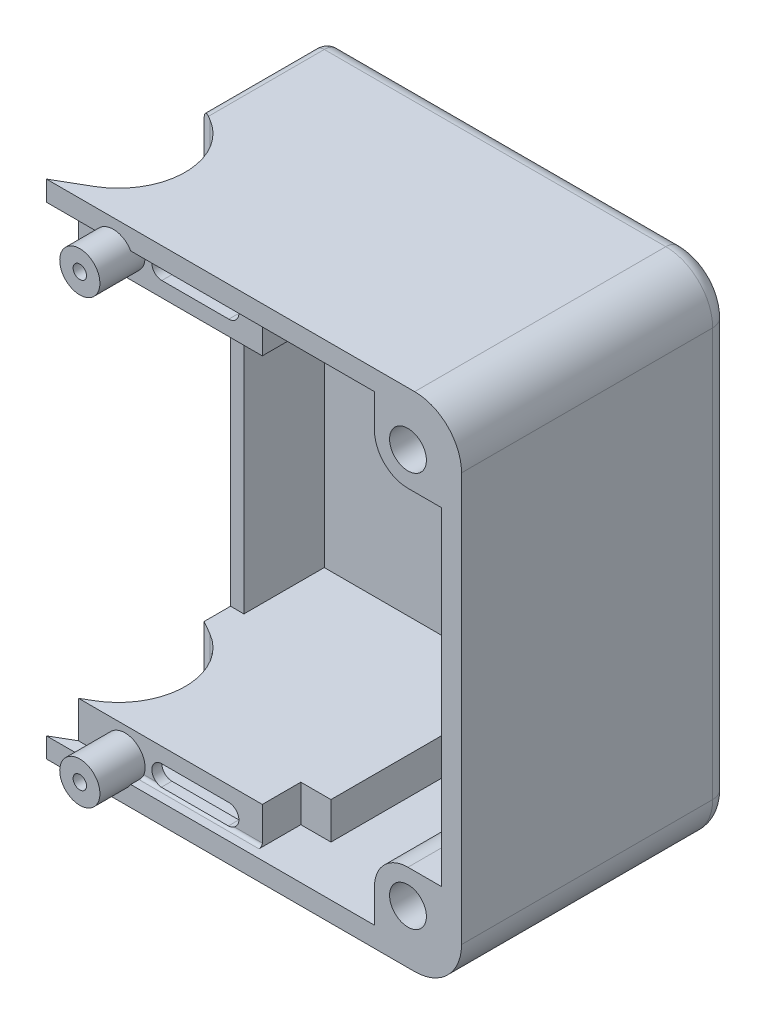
ISO-10303-21;
HEADER;
FILE_DESCRIPTION(('STEP AP214'),'2;1');
FILE_NAME('part.step','',(''),(''),'','','');
FILE_SCHEMA(('AUTOMOTIVE_DESIGN { 1 0 10303 214 1 1 1 1 }'));
ENDSEC;
DATA;
#1=APPLICATION_CONTEXT('core data for automotive mechanical design processes');
#2=APPLICATION_PROTOCOL_DEFINITION('international standard','automotive_design',2000,#1);
#3=PRODUCT_CONTEXT('',#1,'mechanical');
#4=PRODUCT('Part','Part','',(#3));
#5=PRODUCT_RELATED_PRODUCT_CATEGORY('part','',(#4));
#6=PRODUCT_DEFINITION_FORMATION('','',#4);
#7=PRODUCT_DEFINITION_CONTEXT('part definition',#1,'design');
#8=PRODUCT_DEFINITION('design','',#6,#7);
#9=PRODUCT_DEFINITION_SHAPE('','',#8);
#10=(LENGTH_UNIT() NAMED_UNIT(*) SI_UNIT(.MILLI.,.METRE.));
#11=(NAMED_UNIT(*) PLANE_ANGLE_UNIT() SI_UNIT($,.RADIAN.));
#12=(NAMED_UNIT(*) SI_UNIT($,.STERADIAN.) SOLID_ANGLE_UNIT());
#13=UNCERTAINTY_MEASURE_WITH_UNIT(LENGTH_MEASURE(1.E-05),#10,'distance_accuracy_value','');
#14=(GEOMETRIC_REPRESENTATION_CONTEXT(3) GLOBAL_UNCERTAINTY_ASSIGNED_CONTEXT((#13)) GLOBAL_UNIT_ASSIGNED_CONTEXT((#10,
#11,#12)) REPRESENTATION_CONTEXT('',''));
#15=CARTESIAN_POINT('',(0.,0.,0.));
#16=DIRECTION('',(0.,0.,1.));
#17=DIRECTION('',(1.,0.,0.));
#18=AXIS2_PLACEMENT_3D('',#15,#16,#17);
#19=CARTESIAN_POINT('',(51.9799999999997,108.48,3.24999999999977));
#20=DIRECTION('',(0.,0.,1.));
#21=DIRECTION('',(1.,0.,0.));
#22=AXIS2_PLACEMENT_3D('',#19,#20,#21);
#23=PLANE('',#22);
#24=CARTESIAN_POINT('',(52.9999999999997,109.5,3.24999999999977));
#25=DIRECTION('',(0.,0.,1.));
#26=DIRECTION('',(0.,-1.,0.));
#27=AXIS2_PLACEMENT_3D('',#24,#25,#26);
#28=CIRCLE('',#27,1.00000000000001);
#29=CARTESIAN_POINT('',(52.9999999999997,108.5,3.24999999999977));
#30=VERTEX_POINT('',#29);
#31=EDGE_CURVE('E20',#30,#30,#28,.T.);
#32=ORIENTED_EDGE('',*,*,#31,.T.);
#33=EDGE_LOOP('',(#32));
#34=FACE_BOUND('',#33,.T.);
#35=ADVANCED_FACE('F16',(#34),#23,.T.);
#36=CARTESIAN_POINT('',(52.9999999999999,175.5,3.24999999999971));
#37=DIRECTION('',(0.,0.,1.));
#38=DIRECTION('',(1.,0.,0.));
#39=AXIS2_PLACEMENT_3D('',#36,#37,#38);
#40=PLANE('',#39);
#41=CARTESIAN_POINT('',(52.9999999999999,175.5,3.24999999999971));
#42=DIRECTION('',(0.,0.,1.));
#43=DIRECTION('',(0.,-1.,0.));
#44=AXIS2_PLACEMENT_3D('',#41,#42,#43);
#45=CIRCLE('',#44,1.);
#46=CARTESIAN_POINT('',(52.9999999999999,174.5,3.24999999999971));
#47=VERTEX_POINT('',#46);
#48=EDGE_CURVE('E928',#47,#47,#45,.T.);
#49=ORIENTED_EDGE('',*,*,#48,.T.);
#50=EDGE_LOOP('',(#49));
#51=FACE_BOUND('',#50,.T.);
#52=ADVANCED_FACE('F1189',(#51),#40,.T.);
#53=CARTESIAN_POINT('',(71.9999999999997,112.,-8.50000000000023));
#54=DIRECTION('',(-1.,0.,0.));
#55=DIRECTION('',(0.,0.,-1.));
#56=AXIS2_PLACEMENT_3D('',#53,#54,#55);
#57=PLANE('',#56);
#58=DIRECTION('',(0.,-1.,0.));
#59=VECTOR('',#58,1.);
#60=CARTESIAN_POINT('',(71.9999999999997,109.75,-10.0000000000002));
#61=LINE('',#60,#59);
#62=CARTESIAN_POINT('',(71.9999999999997,112.,-10.0000000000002));
#63=VERTEX_POINT('',#62);
#64=CARTESIAN_POINT('',(71.9999999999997,107.5,-10.0000000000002));
#65=VERTEX_POINT('',#64);
#66=EDGE_CURVE('E877',#63,#65,#61,.T.);
#67=ORIENTED_EDGE('',*,*,#66,.T.);
#68=DIRECTION('',(0.,0.,1.));
#69=VECTOR('',#68,1.);
#70=CARTESIAN_POINT('',(71.9999999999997,107.5,-9.25000000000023));
#71=LINE('',#70,#69);
#72=CARTESIAN_POINT('',(71.9999999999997,107.5,-8.50000000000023));
#73=VERTEX_POINT('',#72);
#74=EDGE_CURVE('E941',#65,#73,#71,.T.);
#75=ORIENTED_EDGE('',*,*,#74,.T.);
#76=DIRECTION('',(0.,1.,0.));
#77=VECTOR('',#76,1.);
#78=CARTESIAN_POINT('',(71.9999999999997,109.75,-8.50000000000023));
#79=LINE('',#78,#77);
#80=CARTESIAN_POINT('',(71.9999999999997,112.,-8.50000000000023));
#81=VERTEX_POINT('',#80);
#82=EDGE_CURVE('E883',#73,#81,#79,.T.);
#83=ORIENTED_EDGE('',*,*,#82,.T.);
#84=DIRECTION('',(0.,0.,-1.));
#85=VECTOR('',#84,1.);
#86=CARTESIAN_POINT('',(71.9999999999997,112.,-9.25000000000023));
#87=LINE('',#86,#85);
#88=EDGE_CURVE('E939',#81,#63,#87,.T.);
#89=ORIENTED_EDGE('',*,*,#88,.T.);
#90=EDGE_LOOP('',(#67,#75,#83,#89));
#91=FACE_BOUND('',#90,.T.);
#92=ADVANCED_FACE('F1192',(#91),#57,.T.);
#93=CARTESIAN_POINT('',(52.9999999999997,109.5,3.24999999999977));
#94=DIRECTION('',(0.,0.,1.));
#95=DIRECTION('',(0.,-1.,0.));
#96=AXIS2_PLACEMENT_3D('',#93,#94,#95);
#97=CYLINDRICAL_SURFACE('',#96,1.00000000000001);
#98=ORIENTED_EDGE('',*,*,#31,.F.);
#99=EDGE_LOOP('',(#98));
#100=FACE_BOUND('',#99,.T.);
#101=CARTESIAN_POINT('',(52.9999999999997,109.5,9.99999999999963));
#102=DIRECTION('',(0.,0.,1.));
#103=DIRECTION('',(0.,-1.,0.));
#104=AXIS2_PLACEMENT_3D('',#101,#102,#103);
#105=CIRCLE('',#104,1.00000000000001);
#106=CARTESIAN_POINT('',(52.9999999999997,108.5,9.99999999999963));
#107=VERTEX_POINT('',#106);
#108=EDGE_CURVE('E915',#107,#107,#105,.F.);
#109=ORIENTED_EDGE('',*,*,#108,.F.);
#110=EDGE_LOOP('',(#109));
#111=FACE_BOUND('',#110,.T.);
#112=ADVANCED_FACE('F1187',(#100,#111),#97,.F.);
#113=CARTESIAN_POINT('',(52.9999999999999,175.5,3.24999999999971));
#114=DIRECTION('',(0.,0.,1.));
#115=DIRECTION('',(0.,-1.,0.));
#116=AXIS2_PLACEMENT_3D('',#113,#114,#115);
#117=CYLINDRICAL_SURFACE('',#116,1.);
#118=ORIENTED_EDGE('',*,*,#48,.F.);
#119=EDGE_LOOP('',(#118));
#120=FACE_BOUND('',#119,.T.);
#121=CARTESIAN_POINT('',(52.9999999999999,175.5,9.9999999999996));
#122=DIRECTION('',(0.,0.,1.));
#123=DIRECTION('',(0.,-1.,0.));
#124=AXIS2_PLACEMENT_3D('',#121,#122,#123);
#125=CIRCLE('',#124,1.);
#126=CARTESIAN_POINT('',(52.9999999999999,174.5,9.9999999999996));
#127=VERTEX_POINT('',#126);
#128=EDGE_CURVE('E911',#127,#127,#125,.F.);
#129=ORIENTED_EDGE('',*,*,#128,.F.);
#130=EDGE_LOOP('',(#129));
#131=FACE_BOUND('',#130,.T.);
#132=ADVANCED_FACE('F1183',(#120,#131),#117,.F.);
#133=CARTESIAN_POINT('',(71.9999999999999,175.25,-6.25000000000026));
#134=DIRECTION('',(-1.,0.,0.));
#135=DIRECTION('',(0.,0.,1.));
#136=AXIS2_PLACEMENT_3D('',#133,#134,#135);
#137=PLANE('',#136);
#138=DIRECTION('',(0.,1.,0.));
#139=VECTOR('',#138,1.);
#140=CARTESIAN_POINT('',(71.9999999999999,175.,-10.0000000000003));
#141=LINE('',#140,#139);
#142=CARTESIAN_POINT('',(71.9999999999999,177.5,-10.0000000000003));
#143=VERTEX_POINT('',#142);
#144=CARTESIAN_POINT('',(71.9999999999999,173.,-10.0000000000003));
#145=VERTEX_POINT('',#144);
#146=EDGE_CURVE('E763',#143,#145,#141,.F.);
#147=ORIENTED_EDGE('',*,*,#146,.T.);
#148=DIRECTION('',(0.,0.,1.));
#149=VECTOR('',#148,1.);
#150=CARTESIAN_POINT('',(71.9999999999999,173.,-6.25000000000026));
#151=LINE('',#150,#149);
#152=CARTESIAN_POINT('',(71.9999999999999,173.,-8.50000000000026));
#153=VERTEX_POINT('',#152);
#154=EDGE_CURVE('E893',#145,#153,#151,.T.);
#155=ORIENTED_EDGE('',*,*,#154,.T.);
#156=DIRECTION('',(0.,1.,0.));
#157=VECTOR('',#156,1.);
#158=CARTESIAN_POINT('',(71.9999999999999,173.,-8.50000000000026));
#159=LINE('',#158,#157);
#160=CARTESIAN_POINT('',(71.9999999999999,177.5,-8.50000000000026));
#161=VERTEX_POINT('',#160);
#162=EDGE_CURVE('E721',#153,#161,#159,.T.);
#163=ORIENTED_EDGE('',*,*,#162,.T.);
#164=DIRECTION('',(0.,0.,1.));
#165=VECTOR('',#164,1.);
#166=CARTESIAN_POINT('',(71.9999999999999,177.5,-6.25000000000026));
#167=LINE('',#166,#165);
#168=EDGE_CURVE('E926',#161,#143,#167,.F.);
#169=ORIENTED_EDGE('',*,*,#168,.T.);
#170=EDGE_LOOP('',(#147,#155,#163,#169));
#171=FACE_BOUND('',#170,.T.);
#172=ADVANCED_FACE('F1180',(#171),#137,.T.);
#173=CARTESIAN_POINT('',(96.9999999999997,113.,-32.0000000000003));
#174=DIRECTION('',(0.,0.,1.));
#175=DIRECTION('',(1.,0.,0.));
#176=AXIS2_PLACEMENT_3D('',#173,#174,#175);
#177=CYLINDRICAL_SURFACE('',#176,7.);
#178=DIRECTION('',(0.,0.,1.));
#179=VECTOR('',#178,1.);
#180=CARTESIAN_POINT('',(96.9999999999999,120.,-29.9000000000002));
#181=LINE('',#180,#179);
#182=CARTESIAN_POINT('',(96.9999999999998,120.,-32.0000000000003));
#183=VERTEX_POINT('',#182);
#184=CARTESIAN_POINT('',(96.9999999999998,120.,-27.8000000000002));
#185=VERTEX_POINT('',#184);
#186=EDGE_CURVE('E794',#183,#185,#181,.T.);
#187=ORIENTED_EDGE('',*,*,#186,.F.);
#188=CARTESIAN_POINT('',(96.9999999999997,113.,-32.0000000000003));
#189=DIRECTION('',(0.,0.,1.));
#190=DIRECTION('',(1.,0.,0.));
#191=AXIS2_PLACEMENT_3D('',#188,#189,#190);
#192=CIRCLE('',#191,7.);
#193=CARTESIAN_POINT('',(89.9999999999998,113.,-32.0000000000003));
#194=VERTEX_POINT('',#193);
#195=EDGE_CURVE('E654',#183,#194,#192,.T.);
#196=ORIENTED_EDGE('',*,*,#195,.T.);
#197=DIRECTION('',(0.,0.,-1.));
#198=VECTOR('',#197,1.);
#199=CARTESIAN_POINT('',(89.9999999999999,113.,-29.9000000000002));
#200=LINE('',#199,#198);
#201=CARTESIAN_POINT('',(89.9999999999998,113.,-27.8000000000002));
#202=VERTEX_POINT('',#201);
#203=EDGE_CURVE('E913',#202,#194,#200,.T.);
#204=ORIENTED_EDGE('',*,*,#203,.F.);
#205=CARTESIAN_POINT('',(96.9999999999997,113.,-27.8000000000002));
#206=DIRECTION('',(0.,0.,1.));
#207=DIRECTION('',(1.,0.,0.));
#208=AXIS2_PLACEMENT_3D('',#205,#206,#207);
#209=CIRCLE('',#208,7.);
#210=EDGE_CURVE('E790',#185,#202,#209,.T.);
#211=ORIENTED_EDGE('',*,*,#210,.F.);
#212=EDGE_LOOP('',(#187,#196,#204,#211));
#213=FACE_BOUND('',#212,.T.);
#214=ADVANCED_FACE('F1178',(#213),#177,.T.);
#215=CARTESIAN_POINT('',(96.9999999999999,172.,-35.0000000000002));
#216=DIRECTION('',(0.,0.,1.));
#217=DIRECTION('',(0.,-1.,0.));
#218=AXIS2_PLACEMENT_3D('',#215,#216,#217);
#219=CYLINDRICAL_SURFACE('',#218,7.);
#220=DIRECTION('',(0.,0.,1.));
#221=VECTOR('',#220,1.);
#222=CARTESIAN_POINT('',(89.9999999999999,172.,-35.0000000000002));
#223=LINE('',#222,#221);
#224=CARTESIAN_POINT('',(89.9999999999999,172.,-32.0000000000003));
#225=VERTEX_POINT('',#224);
#226=CARTESIAN_POINT('',(89.9999999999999,172.,-27.8000000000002));
#227=VERTEX_POINT('',#226);
#228=EDGE_CURVE('E909',#225,#227,#223,.T.);
#229=ORIENTED_EDGE('',*,*,#228,.F.);
#230=CARTESIAN_POINT('',(96.9999999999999,172.,-32.0000000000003));
#231=DIRECTION('',(0.,0.,1.));
#232=DIRECTION('',(0.,-1.,0.));
#233=AXIS2_PLACEMENT_3D('',#230,#231,#232);
#234=CIRCLE('',#233,7.);
#235=CARTESIAN_POINT('',(96.9999999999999,165.,-32.0000000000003));
#236=VERTEX_POINT('',#235);
#237=EDGE_CURVE('E645',#225,#236,#234,.T.);
#238=ORIENTED_EDGE('',*,*,#237,.T.);
#239=DIRECTION('',(0.,0.,-1.));
#240=VECTOR('',#239,1.);
#241=CARTESIAN_POINT('',(96.9999999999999,165.,-35.0000000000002));
#242=LINE('',#241,#240);
#243=CARTESIAN_POINT('',(96.9999999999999,165.,-27.8000000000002));
#244=VERTEX_POINT('',#243);
#245=EDGE_CURVE('E743',#244,#236,#242,.T.);
#246=ORIENTED_EDGE('',*,*,#245,.F.);
#247=CARTESIAN_POINT('',(96.9999999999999,172.,-27.8000000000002));
#248=DIRECTION('',(0.,0.,1.));
#249=DIRECTION('',(0.,-1.,0.));
#250=AXIS2_PLACEMENT_3D('',#247,#248,#249);
#251=CIRCLE('',#250,7.);
#252=EDGE_CURVE('E769',#227,#244,#251,.T.);
#253=ORIENTED_EDGE('',*,*,#252,.F.);
#254=EDGE_LOOP('',(#229,#238,#246,#253));
#255=FACE_BOUND('',#254,.T.);
#256=ADVANCED_FACE('F1174',(#255),#219,.T.);
#257=CARTESIAN_POINT('',(68.4999999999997,111.25,3.24999999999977));
#258=DIRECTION('',(0.,1.,0.));
#259=DIRECTION('',(0.,0.,-1.));
#260=AXIS2_PLACEMENT_3D('',#257,#258,#259);
#261=PLANE('',#260);
#262=DIRECTION('',(0.,0.,-1.));
#263=VECTOR('',#262,1.);
#264=CARTESIAN_POINT('',(58.4999999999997,111.25,2.53349364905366));
#265=LINE('',#264,#263);
#266=CARTESIAN_POINT('',(58.4999999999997,111.25,3.24999999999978));
#267=VERTEX_POINT('',#266);
#268=CARTESIAN_POINT('',(58.4999999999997,111.25,1.74999999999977));
#269=VERTEX_POINT('',#268);
#270=EDGE_CURVE('E887',#267,#269,#265,.T.);
#271=ORIENTED_EDGE('',*,*,#270,.T.);
#272=DIRECTION('',(1.,0.,0.));
#273=VECTOR('',#272,1.);
#274=CARTESIAN_POINT('',(60.2499999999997,111.25,1.74999999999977));
#275=LINE('',#274,#273);
#276=CARTESIAN_POINT('',(68.4999999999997,111.25,1.74999999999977));
#277=VERTEX_POINT('',#276);
#278=EDGE_CURVE('E861',#269,#277,#275,.T.);
#279=ORIENTED_EDGE('',*,*,#278,.T.);
#280=DIRECTION('',(0.,0.,1.));
#281=VECTOR('',#280,1.);
#282=CARTESIAN_POINT('',(68.4999999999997,111.25,2.53349364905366));
#283=LINE('',#282,#281);
#284=CARTESIAN_POINT('',(68.4999999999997,111.25,3.24999999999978));
#285=VERTEX_POINT('',#284);
#286=EDGE_CURVE('E891',#277,#285,#283,.T.);
#287=ORIENTED_EDGE('',*,*,#286,.T.);
#288=DIRECTION('',(1.,0.,0.));
#289=VECTOR('',#288,1.);
#290=CARTESIAN_POINT('',(59.7727586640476,111.25,3.24999999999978));
#291=LINE('',#290,#289);
#292=EDGE_CURVE('E597',#267,#285,#291,.T.);
#293=ORIENTED_EDGE('',*,*,#292,.F.);
#294=EDGE_LOOP('',(#271,#279,#287,#293));
#295=FACE_BOUND('',#294,.T.);
#296=ADVANCED_FACE('F1177',(#295),#261,.F.);
#297=CARTESIAN_POINT('',(68.4999999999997,109.75,1.74999999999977));
#298=DIRECTION('',(0.,0.,1.));
#299=DIRECTION('',(1.,0.,0.));
#300=AXIS2_PLACEMENT_3D('',#297,#298,#299);
#301=CYLINDRICAL_SURFACE('',#300,1.50000000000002);
#302=CARTESIAN_POINT('',(69.3291561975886,108.5,3.24999999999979));
#303=CARTESIAN_POINT('',(69.2986910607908,108.479790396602,3.25001439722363));
#304=CARTESIAN_POINT('',(69.2675324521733,108.460727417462,3.25122271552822));
#305=CARTESIAN_POINT('',(69.2040375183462,108.424988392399,3.2553291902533));
#306=CARTESIAN_POINT('',(69.171703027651,108.40830881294,3.25822481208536));
#307=CARTESIAN_POINT('',(69.0745159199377,108.362562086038,3.2682604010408));
#308=CARTESIAN_POINT('',(69.0081620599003,108.336919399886,3.27681002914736));
#309=CARTESIAN_POINT('',(68.9052611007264,108.305315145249,3.28931473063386));
#310=CARTESIAN_POINT('',(68.8697688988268,108.295825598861,3.29349743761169));
#311=CARTESIAN_POINT('',(68.798113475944,108.279463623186,3.3011734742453));
#312=CARTESIAN_POINT('',(68.7619505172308,108.272590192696,3.30466706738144));
#313=CARTESIAN_POINT('',(68.6883300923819,108.261394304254,3.31055630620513));
#314=CARTESIAN_POINT('',(68.6508615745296,108.25713054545,3.31292643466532));
#315=CARTESIAN_POINT('',(68.575600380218,108.251429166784,3.31616230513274));
#316=CARTESIAN_POINT('',(68.5378073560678,108.249995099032,3.31702615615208));
#317=CARTESIAN_POINT('',(68.4999999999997,108.25,3.31698729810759));
#318=B_SPLINE_CURVE_WITH_KNOTS('',3,(#302,#303,#304,#305,#306,#307,#308,#309,#310,#311,#312,
#313,#314,#315,#316,#317),.UNSPECIFIED.,.F.,.F.,(4,2,2,2,2,2,2,4),(0.,0.109545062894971,
0.218925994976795,0.433003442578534,0.543856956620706,0.65466800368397,0.767887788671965,
0.881249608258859),.UNSPECIFIED.);
#319=CARTESIAN_POINT('',(69.3291561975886,108.5,3.24999999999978));
#320=VERTEX_POINT('',#319);
#321=CARTESIAN_POINT('',(68.4999999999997,108.25,3.31698729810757));
#322=VERTEX_POINT('',#321);
#323=EDGE_CURVE('E603',#320,#322,#318,.T.);
#324=ORIENTED_EDGE('',*,*,#323,.F.);
#325=CARTESIAN_POINT('',(68.4999999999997,109.75,3.24999999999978));
#326=DIRECTION('',(0.,0.,1.));
#327=DIRECTION('',(1.,0.,0.));
#328=AXIS2_PLACEMENT_3D('',#325,#326,#327);
#329=CIRCLE('',#328,1.50000000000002);
#330=EDGE_CURVE('E589',#285,#320,#329,.F.);
#331=ORIENTED_EDGE('',*,*,#330,.F.);
#332=ORIENTED_EDGE('',*,*,#286,.F.);
#333=CARTESIAN_POINT('',(68.4999999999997,109.75,1.74999999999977));
#334=DIRECTION('',(0.,0.,1.));
#335=DIRECTION('',(1.,0.,0.));
#336=AXIS2_PLACEMENT_3D('',#333,#334,#335);
#337=CIRCLE('',#336,1.50000000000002);
#338=CARTESIAN_POINT('',(68.4999999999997,108.25,1.74999999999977));
#339=VERTEX_POINT('',#338);
#340=EDGE_CURVE('E1659',#277,#339,#337,.F.);
#341=ORIENTED_EDGE('',*,*,#340,.T.);
#342=DIRECTION('',(0.,0.,1.));
#343=VECTOR('',#342,1.);
#344=CARTESIAN_POINT('',(68.4999999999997,108.25,2.53349364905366));
#345=LINE('',#344,#343);
#346=EDGE_CURVE('E606',#339,#322,#345,.T.);
#347=ORIENTED_EDGE('',*,*,#346,.T.);
#348=EDGE_LOOP('',(#324,#331,#332,#341,#347));
#349=FACE_BOUND('',#348,.T.);
#350=ADVANCED_FACE('F604',(#349),#301,.F.);
#351=CARTESIAN_POINT('',(68.4999999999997,108.25,1.74999999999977));
#352=DIRECTION('',(0.,-1.,0.));
#353=DIRECTION('',(0.,0.,1.));
#354=AXIS2_PLACEMENT_3D('',#351,#352,#353);
#355=PLANE('',#354);
#356=DIRECTION('',(-1.,0.,0.));
#357=VECTOR('',#356,1.);
#358=CARTESIAN_POINT('',(64.5490381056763,108.250000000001,3.31698729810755));
#359=LINE('',#358,#357);
#360=CARTESIAN_POINT('',(58.4999999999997,108.25,3.31698729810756));
#361=VERTEX_POINT('',#360);
#362=EDGE_CURVE('E609',#322,#361,#359,.T.);
#363=ORIENTED_EDGE('',*,*,#362,.F.);
#364=ORIENTED_EDGE('',*,*,#346,.F.);
#365=DIRECTION('',(-1.,0.,0.));
#366=VECTOR('',#365,1.);
#367=CARTESIAN_POINT('',(60.2499999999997,108.25,1.74999999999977));
#368=LINE('',#367,#366);
#369=CARTESIAN_POINT('',(58.4999999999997,108.25,1.74999999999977));
#370=VERTEX_POINT('',#369);
#371=EDGE_CURVE('E1656',#339,#370,#368,.T.);
#372=ORIENTED_EDGE('',*,*,#371,.T.);
#373=DIRECTION('',(0.,0.,1.));
#374=VECTOR('',#373,1.);
#375=CARTESIAN_POINT('',(58.4999999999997,108.25,2.53349364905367));
#376=LINE('',#375,#374);
#377=EDGE_CURVE('E884',#370,#361,#376,.T.);
#378=ORIENTED_EDGE('',*,*,#377,.T.);
#379=EDGE_LOOP('',(#363,#364,#372,#378));
#380=FACE_BOUND('',#379,.T.);
#381=ADVANCED_FACE('F1212',(#380),#355,.F.);
#382=CARTESIAN_POINT('',(58.4999999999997,109.75,1.74999999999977));
#383=DIRECTION('',(0.,0.,1.));
#384=DIRECTION('',(0.,-1.,0.));
#385=AXIS2_PLACEMENT_3D('',#382,#383,#384);
#386=CYLINDRICAL_SURFACE('',#385,1.49999999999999);
#387=CARTESIAN_POINT('',(58.4999999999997,108.25,3.31698729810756));
#388=CARTESIAN_POINT('',(58.4619684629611,108.249994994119,3.31702703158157));
#389=CARTESIAN_POINT('',(58.4239516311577,108.251446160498,3.31615248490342));
#390=CARTESIAN_POINT('',(58.3482483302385,108.257215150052,3.31287893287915));
#391=CARTESIAN_POINT('',(58.3105615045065,108.261529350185,3.31048185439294));
#392=CARTESIAN_POINT('',(58.2365224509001,108.272856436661,3.30453027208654));
#393=CARTESIAN_POINT('',(58.2001589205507,108.279809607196,3.30100162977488));
#394=CARTESIAN_POINT('',(58.128112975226,108.296360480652,3.29325657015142));
#395=CARTESIAN_POINT('',(58.092430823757,108.305959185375,3.28903989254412));
#396=CARTESIAN_POINT('',(57.9897882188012,108.337679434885,3.27654993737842));
#397=CARTESIAN_POINT('',(57.9238655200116,108.363255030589,3.26807189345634));
#398=CARTESIAN_POINT('',(57.8273025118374,108.408813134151,3.25813330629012));
#399=CARTESIAN_POINT('',(57.7951765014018,108.42541241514,3.25526865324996));
#400=CARTESIAN_POINT('',(57.7320852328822,108.460961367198,3.25120778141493));
#401=CARTESIAN_POINT('',(57.7011217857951,108.479914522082,3.25001406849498));
#402=CARTESIAN_POINT('',(57.6708438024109,108.500000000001,3.24999999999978));
#403=B_SPLINE_CURVE_WITH_KNOTS('',3,(#387,#388,#389,#390,#391,#392,#393,#394,#395,#396,#397,
#398,#399,#400,#401,#402),.UNSPECIFIED.,.F.,.F.,(4,2,2,2,2,2,2,4),(0.,0.114033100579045,
0.227922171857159,0.339374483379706,0.450869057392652,0.663666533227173,0.772377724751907,
0.881251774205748),.UNSPECIFIED.);
#404=CARTESIAN_POINT('',(57.6708438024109,108.5,3.24999999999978));
#405=VERTEX_POINT('',#404);
#406=EDGE_CURVE('E836',#361,#405,#403,.T.);
#407=ORIENTED_EDGE('',*,*,#406,.F.);
#408=ORIENTED_EDGE('',*,*,#377,.F.);
#409=CARTESIAN_POINT('',(58.4999999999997,109.75,1.74999999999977));
#410=DIRECTION('',(0.,0.,1.));
#411=DIRECTION('',(0.,-1.,0.));
#412=AXIS2_PLACEMENT_3D('',#409,#410,#411);
#413=CIRCLE('',#412,1.49999999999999);
#414=EDGE_CURVE('E954',#370,#269,#413,.F.);
#415=ORIENTED_EDGE('',*,*,#414,.T.);
#416=ORIENTED_EDGE('',*,*,#270,.F.);
#417=CARTESIAN_POINT('',(58.4999999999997,109.75,3.24999999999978));
#418=DIRECTION('',(0.,0.,1.));
#419=DIRECTION('',(0.,-1.,0.));
#420=AXIS2_PLACEMENT_3D('',#417,#418,#419);
#421=CIRCLE('',#420,1.49999999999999);
#422=EDGE_CURVE('E625',#405,#267,#421,.F.);
#423=ORIENTED_EDGE('',*,*,#422,.F.);
#424=EDGE_LOOP('',(#407,#408,#415,#416,#423));
#425=FACE_BOUND('',#424,.T.);
#426=ADVANCED_FACE('F2463',(#425),#386,.F.);
#427=CARTESIAN_POINT('',(71.9999999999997,112.,-8.50000000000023));
#428=DIRECTION('',(0.,0.,-1.));
#429=DIRECTION('',(1.,0.,0.));
#430=AXIS2_PLACEMENT_3D('',#427,#428,#429);
#431=PLANE('',#430);
#432=DIRECTION('',(0.,-1.,0.));
#433=VECTOR('',#432,1.);
#434=CARTESIAN_POINT('',(76.4999999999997,109.75,-8.50000000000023));
#435=LINE('',#434,#433);
#436=CARTESIAN_POINT('',(76.4999999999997,112.,-8.50000000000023));
#437=VERTEX_POINT('',#436);
#438=CARTESIAN_POINT('',(76.4999999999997,107.5,-8.50000000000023));
#439=VERTEX_POINT('',#438);
#440=EDGE_CURVE('E856',#437,#439,#435,.T.);
#441=ORIENTED_EDGE('',*,*,#440,.F.);
#442=DIRECTION('',(-1.,0.,0.));
#443=VECTOR('',#442,1.);
#444=CARTESIAN_POINT('',(62.4999999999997,112.,-8.50000000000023));
#445=LINE('',#444,#443);
#446=EDGE_CURVE('E880',#437,#81,#445,.T.);
#447=ORIENTED_EDGE('',*,*,#446,.T.);
#448=ORIENTED_EDGE('',*,*,#82,.F.);
#449=DIRECTION('',(1.,0.,0.));
#450=VECTOR('',#449,1.);
#451=CARTESIAN_POINT('',(62.4999999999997,107.5,-8.50000000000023));
#452=LINE('',#451,#450);
#453=EDGE_CURVE('E938',#73,#439,#452,.T.);
#454=ORIENTED_EDGE('',*,*,#453,.T.);
#455=EDGE_LOOP('',(#441,#447,#448,#454));
#456=FACE_BOUND('',#455,.T.);
#457=ADVANCED_FACE('F1696',(#456),#431,.F.);
#458=CARTESIAN_POINT('',(76.4999999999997,112.,-10.0000000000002));
#459=DIRECTION('',(0.,0.,1.));
#460=DIRECTION('',(-1.,0.,0.));
#461=AXIS2_PLACEMENT_3D('',#458,#459,#460);
#462=PLANE('',#461);
#463=DIRECTION('',(1.,0.,0.));
#464=VECTOR('',#463,1.);
#465=CARTESIAN_POINT('',(62.4999999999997,112.,-10.0000000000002));
#466=LINE('',#465,#464);
#467=CARTESIAN_POINT('',(76.4999999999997,112.,-10.0000000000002));
#468=VERTEX_POINT('',#467);
#469=EDGE_CURVE('E874',#63,#468,#466,.T.);
#470=ORIENTED_EDGE('',*,*,#469,.T.);
#471=DIRECTION('',(0.,1.,0.));
#472=VECTOR('',#471,1.);
#473=CARTESIAN_POINT('',(76.4999999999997,109.75,-10.0000000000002));
#474=LINE('',#473,#472);
#475=CARTESIAN_POINT('',(76.4999999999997,107.5,-10.0000000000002));
#476=VERTEX_POINT('',#475);
#477=EDGE_CURVE('E875',#476,#468,#474,.T.);
#478=ORIENTED_EDGE('',*,*,#477,.F.);
#479=DIRECTION('',(-1.,0.,0.));
#480=VECTOR('',#479,1.);
#481=CARTESIAN_POINT('',(62.4999999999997,107.5,-10.0000000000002));
#482=LINE('',#481,#480);
#483=EDGE_CURVE('E899',#476,#65,#482,.T.);
#484=ORIENTED_EDGE('',*,*,#483,.T.);
#485=ORIENTED_EDGE('',*,*,#66,.F.);
#486=EDGE_LOOP('',(#470,#478,#484,#485));
#487=FACE_BOUND('',#486,.T.);
#488=ADVANCED_FACE('F1700',(#487),#462,.F.);
#489=CARTESIAN_POINT('',(76.4999999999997,107.5,-14.2500000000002));
#490=DIRECTION('',(-1.,0.,0.));
#491=DIRECTION('',(0.,0.,1.));
#492=AXIS2_PLACEMENT_3D('',#489,#490,#491);
#493=PLANE('',#492);
#494=DIRECTION('',(0.,0.,-1.));
#495=VECTOR('',#494,1.);
#496=CARTESIAN_POINT('',(76.4999999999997,112.,-6.25000000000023));
#497=LINE('',#496,#495);
#498=CARTESIAN_POINT('',(76.4999999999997,112.,-14.2500000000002));
#499=VERTEX_POINT('',#498);
#500=EDGE_CURVE('E870',#468,#499,#497,.T.);
#501=ORIENTED_EDGE('',*,*,#500,.T.);
#502=DIRECTION('',(0.,-1.,0.));
#503=VECTOR('',#502,1.);
#504=CARTESIAN_POINT('',(76.4999999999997,109.75,-14.2500000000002));
#505=LINE('',#504,#503);
#506=CARTESIAN_POINT('',(76.4999999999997,107.5,-14.2500000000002));
#507=VERTEX_POINT('',#506);
#508=EDGE_CURVE('E618',#499,#507,#505,.T.);
#509=ORIENTED_EDGE('',*,*,#508,.T.);
#510=DIRECTION('',(0.,0.,1.));
#511=VECTOR('',#510,1.);
#512=CARTESIAN_POINT('',(76.4999999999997,107.5,-6.25000000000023));
#513=LINE('',#512,#511);
#514=EDGE_CURVE('E896',#507,#476,#513,.T.);
#515=ORIENTED_EDGE('',*,*,#514,.T.);
#516=ORIENTED_EDGE('',*,*,#477,.T.);
#517=EDGE_LOOP('',(#501,#509,#515,#516));
#518=FACE_BOUND('',#517,.T.);
#519=ADVANCED_FACE('F1703',(#518),#493,.T.);
#520=CARTESIAN_POINT('',(71.9999999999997,112.,1.74999999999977));
#521=DIRECTION('',(-1.,0.,0.));
#522=DIRECTION('',(0.,0.,-1.));
#523=AXIS2_PLACEMENT_3D('',#520,#521,#522);
#524=PLANE('',#523);
#525=DIRECTION('',(0.,-1.,0.));
#526=VECTOR('',#525,1.);
#527=CARTESIAN_POINT('',(71.9999999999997,109.75,-4.00000000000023));
#528=LINE('',#527,#526);
#529=CARTESIAN_POINT('',(71.9999999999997,112.,-4.00000000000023));
#530=VERTEX_POINT('',#529);
#531=CARTESIAN_POINT('',(71.9999999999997,107.5,-4.00000000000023));
#532=VERTEX_POINT('',#531);
#533=EDGE_CURVE('E858',#530,#532,#528,.T.);
#534=ORIENTED_EDGE('',*,*,#533,.T.);
#535=DIRECTION('',(0.,0.,1.));
#536=VECTOR('',#535,1.);
#537=CARTESIAN_POINT('',(71.9999999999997,107.5,-6.25000000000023));
#538=LINE('',#537,#536);
#539=CARTESIAN_POINT('',(71.9999999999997,107.5,1.74999999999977));
#540=VERTEX_POINT('',#539);
#541=EDGE_CURVE('E869',#532,#540,#538,.T.);
#542=ORIENTED_EDGE('',*,*,#541,.T.);
#543=DIRECTION('',(0.,1.,0.));
#544=VECTOR('',#543,1.);
#545=CARTESIAN_POINT('',(71.9999999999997,109.75,1.74999999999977));
#546=LINE('',#545,#544);
#547=CARTESIAN_POINT('',(71.9999999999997,112.,1.74999999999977));
#548=VERTEX_POINT('',#547);
#549=EDGE_CURVE('E859',#540,#548,#546,.T.);
#550=ORIENTED_EDGE('',*,*,#549,.T.);
#551=DIRECTION('',(0.,0.,-1.));
#552=VECTOR('',#551,1.);
#553=CARTESIAN_POINT('',(71.9999999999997,112.,-6.25000000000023));
#554=LINE('',#553,#552);
#555=EDGE_CURVE('E863',#548,#530,#554,.T.);
#556=ORIENTED_EDGE('',*,*,#555,.T.);
#557=EDGE_LOOP('',(#534,#542,#550,#556));
#558=FACE_BOUND('',#557,.T.);
#559=ADVANCED_FACE('F1683',(#558),#524,.T.);
#560=CARTESIAN_POINT('',(76.4999999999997,112.,-4.00000000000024));
#561=DIRECTION('',(0.,0.,1.));
#562=DIRECTION('',(-1.,0.,0.));
#563=AXIS2_PLACEMENT_3D('',#560,#561,#562);
#564=PLANE('',#563);
#565=DIRECTION('',(-1.,0.,0.));
#566=VECTOR('',#565,1.);
#567=CARTESIAN_POINT('',(62.4999999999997,107.5,-4.00000000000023));
#568=LINE('',#567,#566);
#569=CARTESIAN_POINT('',(76.4999999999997,107.5,-4.00000000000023));
#570=VERTEX_POINT('',#569);
#571=EDGE_CURVE('E902',#570,#532,#568,.T.);
#572=ORIENTED_EDGE('',*,*,#571,.T.);
#573=ORIENTED_EDGE('',*,*,#533,.F.);
#574=DIRECTION('',(1.,0.,0.));
#575=VECTOR('',#574,1.);
#576=CARTESIAN_POINT('',(62.4999999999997,112.,-4.00000000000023));
#577=LINE('',#576,#575);
#578=CARTESIAN_POINT('',(76.4999999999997,112.,-4.00000000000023));
#579=VERTEX_POINT('',#578);
#580=EDGE_CURVE('E866',#530,#579,#577,.T.);
#581=ORIENTED_EDGE('',*,*,#580,.T.);
#582=DIRECTION('',(0.,1.,0.));
#583=VECTOR('',#582,1.);
#584=CARTESIAN_POINT('',(76.4999999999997,109.75,-4.00000000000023));
#585=LINE('',#584,#583);
#586=EDGE_CURVE('E610',#570,#579,#585,.T.);
#587=ORIENTED_EDGE('',*,*,#586,.F.);
#588=EDGE_LOOP('',(#572,#573,#581,#587));
#589=FACE_BOUND('',#588,.T.);
#590=ADVANCED_FACE('F1687',(#589),#564,.F.);
#591=CARTESIAN_POINT('',(76.4999999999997,112.,-4.00000000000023));
#592=DIRECTION('',(-1.,0.,0.));
#593=DIRECTION('',(0.,0.,-1.));
#594=AXIS2_PLACEMENT_3D('',#591,#592,#593);
#595=PLANE('',#594);
#596=ORIENTED_EDGE('',*,*,#586,.T.);
#597=DIRECTION('',(0.,0.,-1.));
#598=VECTOR('',#597,1.);
#599=CARTESIAN_POINT('',(76.4999999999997,112.,-6.25000000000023));
#600=LINE('',#599,#598);
#601=EDGE_CURVE('E784',#579,#437,#600,.T.);
#602=ORIENTED_EDGE('',*,*,#601,.T.);
#603=ORIENTED_EDGE('',*,*,#440,.T.);
#604=DIRECTION('',(0.,0.,1.));
#605=VECTOR('',#604,1.);
#606=CARTESIAN_POINT('',(76.4999999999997,107.5,-6.25000000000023));
#607=LINE('',#606,#605);
#608=EDGE_CURVE('E905',#439,#570,#607,.T.);
#609=ORIENTED_EDGE('',*,*,#608,.T.);
#610=EDGE_LOOP('',(#596,#602,#603,#609));
#611=FACE_BOUND('',#610,.T.);
#612=ADVANCED_FACE('F1228',(#611),#595,.T.);
#613=CARTESIAN_POINT('',(55.5980762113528,108.5,3.74999999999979));
#614=DIRECTION('',(1.,0.,0.));
#615=DIRECTION('',(0.,0.,-1.));
#616=AXIS2_PLACEMENT_3D('',#613,#614,#615);
#617=CYLINDRICAL_SURFACE('',#616,0.499999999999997);
#618=DIRECTION('',(-1.,0.,0.));
#619=VECTOR('',#618,1.);
#620=CARTESIAN_POINT('',(73.7990381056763,108.,3.74999999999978));
#621=LINE('',#620,#619);
#622=CARTESIAN_POINT('',(73.4999999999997,108.,3.74999999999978));
#623=VERTEX_POINT('',#622);
#624=CARTESIAN_POINT('',(55.5980762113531,108.,3.74999999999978));
#625=VERTEX_POINT('',#624);
#626=EDGE_CURVE('E821',#623,#625,#621,.T.);
#627=ORIENTED_EDGE('',*,*,#626,.F.);
#628=CARTESIAN_POINT('',(73.4999999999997,108.5,3.74999999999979));
#629=DIRECTION('',(1.,0.,0.));
#630=DIRECTION('',(0.,0.,-1.));
#631=AXIS2_PLACEMENT_3D('',#628,#629,#630);
#632=CIRCLE('',#631,0.499999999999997);
#633=CARTESIAN_POINT('',(73.4999999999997,108.5,3.24999999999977));
#634=VERTEX_POINT('',#633);
#635=EDGE_CURVE('E614',#623,#634,#632,.T.);
#636=ORIENTED_EDGE('',*,*,#635,.T.);
#637=DIRECTION('',(1.,0.,0.));
#638=VECTOR('',#637,1.);
#639=CARTESIAN_POINT('',(59.7727586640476,108.5,3.24999999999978));
#640=LINE('',#639,#638);
#641=EDGE_CURVE('E593',#320,#634,#640,.T.);
#642=ORIENTED_EDGE('',*,*,#641,.F.);
#643=ORIENTED_EDGE('',*,*,#323,.T.);
#644=ORIENTED_EDGE('',*,*,#362,.T.);
#645=ORIENTED_EDGE('',*,*,#406,.T.);
#646=DIRECTION('',(1.,0.,0.));
#647=VECTOR('',#646,1.);
#648=CARTESIAN_POINT('',(59.7727586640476,108.5,3.24999999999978));
#649=LINE('',#648,#647);
#650=CARTESIAN_POINT('',(55.8284271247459,108.5,3.24999999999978));
#651=VERTEX_POINT('',#650);
#652=EDGE_CURVE('E626',#651,#405,#649,.T.);
#653=ORIENTED_EDGE('',*,*,#652,.F.);
#654=CARTESIAN_POINT('',(55.8284271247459,108.5,3.24999999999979));
#655=CARTESIAN_POINT('',(55.8177291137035,108.469685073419,3.2499900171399));
#656=CARTESIAN_POINT('',(55.8065194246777,108.439584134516,3.25275489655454));
#657=CARTESIAN_POINT('',(55.783509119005,108.380603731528,3.26354413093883));
#658=CARTESIAN_POINT('',(55.7717090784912,108.351723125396,3.27156344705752));
#659=CARTESIAN_POINT('',(55.7479349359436,108.295931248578,3.29256660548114));
#660=CARTESIAN_POINT('',(55.7359609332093,108.269018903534,3.3055477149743));
#661=CARTESIAN_POINT('',(55.7123374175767,108.21780679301,3.33616787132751));
#662=CARTESIAN_POINT('',(55.7006880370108,108.193508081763,3.35380878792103));
#663=CARTESIAN_POINT('',(55.678196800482,108.147996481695,3.39360643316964));
#664=CARTESIAN_POINT('',(55.6673639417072,108.126816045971,3.41580558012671));
#665=CARTESIAN_POINT('',(55.6473378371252,108.088593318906,3.46418027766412));
#666=CARTESIAN_POINT('',(55.6381440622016,108.071549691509,3.49035453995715));
#667=CARTESIAN_POINT('',(55.6227927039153,108.043568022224,3.54382439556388));
#668=CARTESIAN_POINT('',(55.6164536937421,108.032256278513,3.57087152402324));
#669=CARTESIAN_POINT('',(55.6064105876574,108.014493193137,3.62694730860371));
#670=CARTESIAN_POINT('',(55.6026992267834,108.008028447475,3.65597025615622));
#671=CARTESIAN_POINT('',(55.5996887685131,108.002795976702,3.69609565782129));
#672=CARTESIAN_POINT('',(55.5990848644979,108.00174818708,3.70684594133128));
#673=CARTESIAN_POINT('',(55.5982788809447,108.000350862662,3.72839531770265));
#674=CARTESIAN_POINT('',(55.5980763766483,108.000000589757,3.73919434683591));
#675=CARTESIAN_POINT('',(55.5980762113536,108.,3.7499999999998));
#676=B_SPLINE_CURVE_WITH_KNOTS('',3,(#654,#655,#656,#657,#658,#659,#660,#661,#662,#663,#664,
#665,#666,#667,#668,#669,#670,#671,#672,#673,#674,#675),.UNSPECIFIED.,.F.,.F.,(4,2,2,2,2,2,2,2,
2,2,4),(0.,0.0962750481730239,0.192457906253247,0.288587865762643,0.384756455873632,
0.481864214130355,0.578940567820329,0.668412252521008,0.757635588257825,0.790066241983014,
0.822462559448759),.UNSPECIFIED.);
#677=EDGE_CURVE('E916',#651,#625,#676,.T.);
#678=ORIENTED_EDGE('',*,*,#677,.T.);
#679=EDGE_LOOP('',(#627,#636,#642,#643,#644,#645,#653,#678));
#680=FACE_BOUND('',#679,.T.);
#681=ADVANCED_FACE('F613',(#680),#617,.F.);
#682=CARTESIAN_POINT('',(89.9999999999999,108.,-32.0000000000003));
#683=DIRECTION('',(-1.,0.,0.));
#684=DIRECTION('',(0.,0.,1.));
#685=AXIS2_PLACEMENT_3D('',#682,#683,#684);
#686=PLANE('',#685);
#687=ORIENTED_EDGE('',*,*,#203,.T.);
#688=DIRECTION('',(0.,-1.,0.));
#689=VECTOR('',#688,1.);
#690=CARTESIAN_POINT('',(89.9999999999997,142.5,-32.0000000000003));
#691=LINE('',#690,#689);
#692=CARTESIAN_POINT('',(89.9999999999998,108.,-32.0000000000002));
#693=VERTEX_POINT('',#692);
#694=EDGE_CURVE('E650',#194,#693,#691,.T.);
#695=ORIENTED_EDGE('',*,*,#694,.T.);
#696=DIRECTION('',(0.,0.,-1.));
#697=VECTOR('',#696,1.);
#698=CARTESIAN_POINT('',(89.9999999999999,108.,-13.5000000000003));
#699=LINE('',#698,#697);
#700=CARTESIAN_POINT('',(89.9999999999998,108.,-27.8000000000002));
#701=VERTEX_POINT('',#700);
#702=EDGE_CURVE('E834',#701,#693,#699,.T.);
#703=ORIENTED_EDGE('',*,*,#702,.F.);
#704=DIRECTION('',(0.,-1.,0.));
#705=VECTOR('',#704,1.);
#706=CARTESIAN_POINT('',(89.9999999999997,114.,-27.8000000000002));
#707=LINE('',#706,#705);
#708=EDGE_CURVE('E770',#202,#701,#707,.T.);
#709=ORIENTED_EDGE('',*,*,#708,.F.);
#710=EDGE_LOOP('',(#687,#695,#703,#709));
#711=FACE_BOUND('',#710,.T.);
#712=ADVANCED_FACE('F1227',(#711),#686,.T.);
#713=CARTESIAN_POINT('',(49.9399999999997,106.44,9.99999999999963));
#714=DIRECTION('',(0.,0.,1.));
#715=DIRECTION('',(1.,0.,0.));
#716=AXIS2_PLACEMENT_3D('',#713,#714,#715);
#717=PLANE('',#716);
#718=ORIENTED_EDGE('',*,*,#108,.T.);
#719=EDGE_LOOP('',(#718));
#720=FACE_BOUND('',#719,.T.);
#721=CARTESIAN_POINT('',(52.9999999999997,109.5,9.99999999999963));
#722=DIRECTION('',(0.,0.,1.));
#723=DIRECTION('',(0.,-1.,0.));
#724=AXIS2_PLACEMENT_3D('',#721,#722,#723);
#725=CIRCLE('',#724,2.99999999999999);
#726=CARTESIAN_POINT('',(52.9999999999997,106.5,9.99999999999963));
#727=VERTEX_POINT('',#726);
#728=EDGE_CURVE('E852',#727,#727,#725,.F.);
#729=ORIENTED_EDGE('',*,*,#728,.F.);
#730=EDGE_LOOP('',(#729));
#731=FACE_BOUND('',#730,.T.);
#732=ADVANCED_FACE('F1172',(#720,#731),#717,.T.);
#733=CARTESIAN_POINT('',(52.9999999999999,175.5,9.9999999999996));
#734=DIRECTION('',(0.,0.,1.));
#735=DIRECTION('',(1.,0.,0.));
#736=AXIS2_PLACEMENT_3D('',#733,#734,#735);
#737=PLANE('',#736);
#738=ORIENTED_EDGE('',*,*,#128,.T.);
#739=EDGE_LOOP('',(#738));
#740=FACE_BOUND('',#739,.T.);
#741=CARTESIAN_POINT('',(52.9999999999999,175.5,9.9999999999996));
#742=DIRECTION('',(0.,0.,1.));
#743=DIRECTION('',(0.,-1.,0.));
#744=AXIS2_PLACEMENT_3D('',#741,#742,#743);
#745=CIRCLE('',#744,3.);
#746=CARTESIAN_POINT('',(52.9999999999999,172.5,9.9999999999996));
#747=VERTEX_POINT('',#746);
#748=EDGE_CURVE('E641',#747,#747,#745,.F.);
#749=ORIENTED_EDGE('',*,*,#748,.F.);
#750=EDGE_LOOP('',(#749));
#751=FACE_BOUND('',#750,.T.);
#752=ADVANCED_FACE('F1168',(#740,#751),#737,.T.);
#753=CARTESIAN_POINT('',(89.9999999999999,166.,-35.0000000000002));
#754=DIRECTION('',(-1.,0.,0.));
#755=DIRECTION('',(0.,0.,1.));
#756=AXIS2_PLACEMENT_3D('',#753,#754,#755);
#757=PLANE('',#756);
#758=DIRECTION('',(0.,1.,0.));
#759=VECTOR('',#758,1.);
#760=CARTESIAN_POINT('',(89.9999999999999,169.305489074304,-27.8000000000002));
#761=LINE('',#760,#759);
#762=CARTESIAN_POINT('',(89.9999999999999,177.,-27.8000000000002));
#763=VERTEX_POINT('',#762);
#764=EDGE_CURVE('E766',#763,#227,#761,.F.);
#765=ORIENTED_EDGE('',*,*,#764,.F.);
#766=DIRECTION('',(0.,0.,-1.));
#767=VECTOR('',#766,1.);
#768=CARTESIAN_POINT('',(89.9999999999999,177.,-29.5000000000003));
#769=LINE('',#768,#767);
#770=CARTESIAN_POINT('',(89.9999999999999,177.,-32.0000000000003));
#771=VERTEX_POINT('',#770);
#772=EDGE_CURVE('E806',#771,#763,#769,.F.);
#773=ORIENTED_EDGE('',*,*,#772,.F.);
#774=DIRECTION('',(0.,-1.,0.));
#775=VECTOR('',#774,1.);
#776=CARTESIAN_POINT('',(89.9999999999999,142.5,-32.0000000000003));
#777=LINE('',#776,#775);
#778=EDGE_CURVE('E646',#771,#225,#777,.T.);
#779=ORIENTED_EDGE('',*,*,#778,.T.);
#780=ORIENTED_EDGE('',*,*,#228,.T.);
#781=EDGE_LOOP('',(#765,#773,#779,#780));
#782=FACE_BOUND('',#781,.T.);
#783=ADVANCED_FACE('F1164',(#782),#757,.T.);
#784=CARTESIAN_POINT('',(102.,120.,-27.8000000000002));
#785=DIRECTION('',(0.,1.,0.));
#786=DIRECTION('',(0.,0.,-1.));
#787=AXIS2_PLACEMENT_3D('',#784,#785,#786);
#788=PLANE('',#787);
#789=DIRECTION('',(-1.,0.,0.));
#790=VECTOR('',#789,1.);
#791=CARTESIAN_POINT('',(95.9999999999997,120.,-27.8000000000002));
#792=LINE('',#791,#790);
#793=CARTESIAN_POINT('',(102.,120.,-27.8000000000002));
#794=VERTEX_POINT('',#793);
#795=EDGE_CURVE('E791',#794,#185,#792,.T.);
#796=ORIENTED_EDGE('',*,*,#795,.F.);
#797=DIRECTION('',(0.,0.,1.));
#798=VECTOR('',#797,1.);
#799=CARTESIAN_POINT('',(102.,120.,-13.5000000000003));
#800=LINE('',#799,#798);
#801=CARTESIAN_POINT('',(102.,120.,-32.0000000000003));
#802=VERTEX_POINT('',#801);
#803=EDGE_CURVE('E788',#802,#794,#800,.T.);
#804=ORIENTED_EDGE('',*,*,#803,.F.);
#805=DIRECTION('',(-1.,0.,0.));
#806=VECTOR('',#805,1.);
#807=CARTESIAN_POINT('',(74.7499999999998,120.,-32.0000000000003));
#808=LINE('',#807,#806);
#809=EDGE_CURVE('E655',#802,#183,#808,.T.);
#810=ORIENTED_EDGE('',*,*,#809,.T.);
#811=ORIENTED_EDGE('',*,*,#186,.T.);
#812=EDGE_LOOP('',(#796,#804,#810,#811));
#813=FACE_BOUND('',#812,.T.);
#814=ADVANCED_FACE('F1167',(#813),#788,.T.);
#815=CARTESIAN_POINT('',(89.9999999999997,108.,-27.8000000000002));
#816=DIRECTION('',(0.,0.,1.));
#817=DIRECTION('',(1.,0.,0.));
#818=AXIS2_PLACEMENT_3D('',#815,#816,#817);
#819=PLANE('',#818);
#820=ORIENTED_EDGE('',*,*,#210,.T.);
#821=ORIENTED_EDGE('',*,*,#708,.T.);
#822=DIRECTION('',(-1.,0.,0.));
#823=VECTOR('',#822,1.);
#824=CARTESIAN_POINT('',(73.7990381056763,108.,-27.8000000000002));
#825=LINE('',#824,#823);
#826=CARTESIAN_POINT('',(91.9999999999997,108.,-27.8000000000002));
#827=VERTEX_POINT('',#826);
#828=EDGE_CURVE('E831',#827,#701,#825,.T.);
#829=ORIENTED_EDGE('',*,*,#828,.F.);
#830=DIRECTION('',(0.,1.,0.));
#831=VECTOR('',#830,1.);
#832=CARTESIAN_POINT('',(91.9999999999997,110.5,-27.8000000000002));
#833=LINE('',#832,#831);
#834=CARTESIAN_POINT('',(91.9999999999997,113.,-27.8000000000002));
#835=VERTEX_POINT('',#834);
#836=EDGE_CURVE('E826',#827,#835,#833,.T.);
#837=ORIENTED_EDGE('',*,*,#836,.T.);
#838=CARTESIAN_POINT('',(96.9999999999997,113.,-27.8000000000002));
#839=DIRECTION('',(0.,0.,1.));
#840=DIRECTION('',(0.,-1.,0.));
#841=AXIS2_PLACEMENT_3D('',#838,#839,#840);
#842=CIRCLE('',#841,4.99999999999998);
#843=CARTESIAN_POINT('',(96.9999999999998,118.,-27.8000000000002));
#844=VERTEX_POINT('',#843);
#845=EDGE_CURVE('E830',#844,#835,#842,.T.);
#846=ORIENTED_EDGE('',*,*,#845,.F.);
#847=DIRECTION('',(1.,0.,0.));
#848=VECTOR('',#847,1.);
#849=CARTESIAN_POINT('',(99.4999999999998,118.,-27.8000000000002));
#850=LINE('',#849,#848);
#851=CARTESIAN_POINT('',(102.,118.,-27.8000000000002));
#852=VERTEX_POINT('',#851);
#853=EDGE_CURVE('E780',#844,#852,#850,.T.);
#854=ORIENTED_EDGE('',*,*,#853,.T.);
#855=DIRECTION('',(0.,-1.,0.));
#856=VECTOR('',#855,1.);
#857=CARTESIAN_POINT('',(102.,142.5,-27.8000000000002));
#858=LINE('',#857,#856);
#859=EDGE_CURVE('E785',#794,#852,#858,.T.);
#860=ORIENTED_EDGE('',*,*,#859,.F.);
#861=ORIENTED_EDGE('',*,*,#795,.T.);
#862=EDGE_LOOP('',(#820,#821,#829,#837,#846,#854,#860,#861));
#863=FACE_BOUND('',#862,.T.);
#864=ADVANCED_FACE('F1162',(#863),#819,.T.);
#865=CARTESIAN_POINT('',(94.3054890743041,169.305489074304,-27.8000000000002));
#866=DIRECTION('',(0.,0.,1.));
#867=DIRECTION('',(1.,0.,0.));
#868=AXIS2_PLACEMENT_3D('',#865,#866,#867);
#869=PLANE('',#868);
#870=CARTESIAN_POINT('',(96.9999999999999,172.,-27.8000000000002));
#871=DIRECTION('',(0.,0.,1.));
#872=DIRECTION('',(0.,-1.,0.));
#873=AXIS2_PLACEMENT_3D('',#870,#871,#872);
#874=CIRCLE('',#873,5.);
#875=CARTESIAN_POINT('',(91.9999999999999,172.,-27.8000000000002));
#876=VERTEX_POINT('',#875);
#877=CARTESIAN_POINT('',(96.9999999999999,167.,-27.8000000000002));
#878=VERTEX_POINT('',#877);
#879=EDGE_CURVE('E775',#876,#878,#874,.T.);
#880=ORIENTED_EDGE('',*,*,#879,.F.);
#881=DIRECTION('',(0.,1.,0.));
#882=VECTOR('',#881,1.);
#883=CARTESIAN_POINT('',(91.9999999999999,177.,-27.8000000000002));
#884=LINE('',#883,#882);
#885=CARTESIAN_POINT('',(91.9999999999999,177.,-27.8000000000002));
#886=VERTEX_POINT('',#885);
#887=EDGE_CURVE('E798',#876,#886,#884,.T.);
#888=ORIENTED_EDGE('',*,*,#887,.T.);
#889=DIRECTION('',(1.,0.,0.));
#890=VECTOR('',#889,1.);
#891=CARTESIAN_POINT('',(125.739568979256,177.,-27.8000000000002));
#892=LINE('',#891,#890);
#893=EDGE_CURVE('E803',#763,#886,#892,.T.);
#894=ORIENTED_EDGE('',*,*,#893,.F.);
#895=ORIENTED_EDGE('',*,*,#764,.T.);
#896=ORIENTED_EDGE('',*,*,#252,.T.);
#897=DIRECTION('',(1.,0.,0.));
#898=VECTOR('',#897,1.);
#899=CARTESIAN_POINT('',(105.,165.,-27.8000000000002));
#900=LINE('',#899,#898);
#901=CARTESIAN_POINT('',(102.,165.,-27.8000000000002));
#902=VERTEX_POINT('',#901);
#903=EDGE_CURVE('E907',#902,#244,#900,.F.);
#904=ORIENTED_EDGE('',*,*,#903,.F.);
#905=DIRECTION('',(0.,-1.,0.));
#906=VECTOR('',#905,1.);
#907=CARTESIAN_POINT('',(102.,142.5,-27.8000000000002));
#908=LINE('',#907,#906);
#909=CARTESIAN_POINT('',(102.,167.,-27.8000000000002));
#910=VERTEX_POINT('',#909);
#911=EDGE_CURVE('E776',#910,#902,#908,.T.);
#912=ORIENTED_EDGE('',*,*,#911,.F.);
#913=DIRECTION('',(1.,0.,0.));
#914=VECTOR('',#913,1.);
#915=CARTESIAN_POINT('',(102.,167.,-27.8000000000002));
#916=LINE('',#915,#914);
#917=EDGE_CURVE('E771',#910,#878,#916,.F.);
#918=ORIENTED_EDGE('',*,*,#917,.T.);
#919=EDGE_LOOP('',(#880,#888,#894,#895,#896,#904,#912,#918));
#920=FACE_BOUND('',#919,.T.);
#921=ADVANCED_FACE('F1158',(#920),#869,.T.);
#922=CARTESIAN_POINT('',(105.,165.,-35.0000000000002));
#923=DIRECTION('',(0.,-1.,0.));
#924=DIRECTION('',(0.,0.,-1.));
#925=AXIS2_PLACEMENT_3D('',#922,#923,#924);
#926=PLANE('',#925);
#927=ORIENTED_EDGE('',*,*,#245,.T.);
#928=DIRECTION('',(1.,0.,0.));
#929=VECTOR('',#928,1.);
#930=CARTESIAN_POINT('',(74.7499999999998,165.,-32.0000000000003));
#931=LINE('',#930,#929);
#932=CARTESIAN_POINT('',(102.,165.,-32.0000000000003));
#933=VERTEX_POINT('',#932);
#934=EDGE_CURVE('E629',#236,#933,#931,.T.);
#935=ORIENTED_EDGE('',*,*,#934,.T.);
#936=DIRECTION('',(0.,0.,-1.));
#937=VECTOR('',#936,1.);
#938=CARTESIAN_POINT('',(102.,165.,-13.5000000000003));
#939=LINE('',#938,#937);
#940=EDGE_CURVE('E778',#902,#933,#939,.T.);
#941=ORIENTED_EDGE('',*,*,#940,.F.);
#942=ORIENTED_EDGE('',*,*,#903,.T.);
#943=EDGE_LOOP('',(#927,#935,#941,#942));
#944=FACE_BOUND('',#943,.T.);
#945=ADVANCED_FACE('F1154',(#944),#926,.T.);
#946=CARTESIAN_POINT('',(58.4999999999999,176.75,1.74999999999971));
#947=DIRECTION('',(0.,1.,0.));
#948=DIRECTION('',(0.,0.,1.));
#949=AXIS2_PLACEMENT_3D('',#946,#947,#948);
#950=PLANE('',#949);
#951=DIRECTION('',(1.,0.,0.));
#952=VECTOR('',#951,1.);
#953=CARTESIAN_POINT('',(67.9999999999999,176.75,1.74999999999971));
#954=LINE('',#953,#952);
#955=CARTESIAN_POINT('',(58.4999999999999,176.75,1.74999999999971));
#956=VERTEX_POINT('',#955);
#957=CARTESIAN_POINT('',(68.4999999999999,176.75,1.74999999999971));
#958=VERTEX_POINT('',#957);
#959=EDGE_CURVE('E733',#956,#958,#954,.T.);
#960=ORIENTED_EDGE('',*,*,#959,.T.);
#961=DIRECTION('',(0.,0.,1.));
#962=VECTOR('',#961,1.);
#963=CARTESIAN_POINT('',(68.4999999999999,176.75,1.74999999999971));
#964=LINE('',#963,#962);
#965=CARTESIAN_POINT('',(68.4999999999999,176.75,3.31698729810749));
#966=VERTEX_POINT('',#965);
#967=EDGE_CURVE('E716',#958,#966,#964,.T.);
#968=ORIENTED_EDGE('',*,*,#967,.T.);
#969=DIRECTION('',(-1.,0.,0.));
#970=VECTOR('',#969,1.);
#971=CARTESIAN_POINT('',(99.8697844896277,176.75,3.31698729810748));
#972=LINE('',#971,#970);
#973=CARTESIAN_POINT('',(58.4999999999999,176.75,3.3169872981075));
#974=VERTEX_POINT('',#973);
#975=EDGE_CURVE('E703',#966,#974,#972,.T.);
#976=ORIENTED_EDGE('',*,*,#975,.T.);
#977=DIRECTION('',(0.,0.,1.));
#978=VECTOR('',#977,1.);
#979=CARTESIAN_POINT('',(58.4999999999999,176.75,1.74999999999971));
#980=LINE('',#979,#978);
#981=EDGE_CURVE('E707',#974,#956,#980,.F.);
#982=ORIENTED_EDGE('',*,*,#981,.T.);
#983=EDGE_LOOP('',(#960,#968,#976,#982));
#984=FACE_BOUND('',#983,.T.);
#985=ADVANCED_FACE('F1150',(#984),#950,.F.);
#986=CARTESIAN_POINT('',(76.4999999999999,177.5,-4.00000000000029));
#987=DIRECTION('',(0.,0.,1.));
#988=DIRECTION('',(1.,0.,0.));
#989=AXIS2_PLACEMENT_3D('',#986,#987,#988);
#990=PLANE('',#989);
#991=DIRECTION('',(1.,0.,0.));
#992=VECTOR('',#991,1.);
#993=CARTESIAN_POINT('',(67.9999999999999,173.,-4.00000000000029));
#994=LINE('',#993,#992);
#995=CARTESIAN_POINT('',(76.4999999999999,173.,-4.00000000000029));
#996=VERTEX_POINT('',#995);
#997=CARTESIAN_POINT('',(71.9999999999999,173.,-4.00000000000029));
#998=VERTEX_POINT('',#997);
#999=EDGE_CURVE('E739',#996,#998,#994,.F.);
#1000=ORIENTED_EDGE('',*,*,#999,.T.);
#1001=DIRECTION('',(0.,1.,0.));
#1002=VECTOR('',#1001,1.);
#1003=CARTESIAN_POINT('',(71.9999999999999,175.25,-4.00000000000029));
#1004=LINE('',#1003,#1002);
#1005=CARTESIAN_POINT('',(71.9999999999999,177.5,-4.00000000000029));
#1006=VERTEX_POINT('',#1005);
#1007=EDGE_CURVE('E740',#1006,#998,#1004,.F.);
#1008=ORIENTED_EDGE('',*,*,#1007,.F.);
#1009=DIRECTION('',(1.,0.,0.));
#1010=VECTOR('',#1009,1.);
#1011=CARTESIAN_POINT('',(72.4999999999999,177.5,-4.00000000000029));
#1012=LINE('',#1011,#1010);
#1013=CARTESIAN_POINT('',(76.4999999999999,177.5,-4.00000000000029));
#1014=VERTEX_POINT('',#1013);
#1015=EDGE_CURVE('E725',#1006,#1014,#1012,.T.);
#1016=ORIENTED_EDGE('',*,*,#1015,.T.);
#1017=DIRECTION('',(0.,1.,0.));
#1018=VECTOR('',#1017,1.);
#1019=CARTESIAN_POINT('',(76.4999999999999,175.25,-4.00000000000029));
#1020=LINE('',#1019,#1018);
#1021=EDGE_CURVE('E718',#996,#1014,#1020,.T.);
#1022=ORIENTED_EDGE('',*,*,#1021,.F.);
#1023=EDGE_LOOP('',(#1000,#1008,#1016,#1022));
#1024=FACE_BOUND('',#1023,.T.);
#1025=ADVANCED_FACE('F1146',(#1024),#990,.F.);
#1026=CARTESIAN_POINT('',(71.9999999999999,175.25,-6.25000000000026));
#1027=DIRECTION('',(-1.,0.,0.));
#1028=DIRECTION('',(0.,0.,1.));
#1029=AXIS2_PLACEMENT_3D('',#1026,#1027,#1028);
#1030=PLANE('',#1029);
#1031=ORIENTED_EDGE('',*,*,#1007,.T.);
#1032=DIRECTION('',(0.,0.,-1.));
#1033=VECTOR('',#1032,1.);
#1034=CARTESIAN_POINT('',(71.9999999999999,173.,1.74999999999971));
#1035=LINE('',#1034,#1033);
#1036=CARTESIAN_POINT('',(71.9999999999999,173.,1.74999999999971));
#1037=VERTEX_POINT('',#1036);
#1038=EDGE_CURVE('E735',#998,#1037,#1035,.F.);
#1039=ORIENTED_EDGE('',*,*,#1038,.T.);
#1040=DIRECTION('',(0.,1.,0.));
#1041=VECTOR('',#1040,1.);
#1042=CARTESIAN_POINT('',(71.9999999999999,177.5,1.74999999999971));
#1043=LINE('',#1042,#1041);
#1044=CARTESIAN_POINT('',(71.9999999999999,177.5,1.74999999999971));
#1045=VERTEX_POINT('',#1044);
#1046=EDGE_CURVE('E731',#1037,#1045,#1043,.T.);
#1047=ORIENTED_EDGE('',*,*,#1046,.T.);
#1048=DIRECTION('',(0.,0.,1.));
#1049=VECTOR('',#1048,1.);
#1050=CARTESIAN_POINT('',(71.9999999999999,177.5,-14.2500000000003));
#1051=LINE('',#1050,#1049);
#1052=EDGE_CURVE('E756',#1045,#1006,#1051,.F.);
#1053=ORIENTED_EDGE('',*,*,#1052,.T.);
#1054=EDGE_LOOP('',(#1031,#1039,#1047,#1053));
#1055=FACE_BOUND('',#1054,.T.);
#1056=ADVANCED_FACE('F1142',(#1055),#1030,.T.);
#1057=CARTESIAN_POINT('',(76.4999999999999,171.5,-32.0000000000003));
#1058=DIRECTION('',(-1.,0.,0.));
#1059=DIRECTION('',(0.,0.,1.));
#1060=AXIS2_PLACEMENT_3D('',#1057,#1058,#1059);
#1061=PLANE('',#1060);
#1062=DIRECTION('',(0.,0.,-1.));
#1063=VECTOR('',#1062,1.);
#1064=CARTESIAN_POINT('',(76.4999999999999,173.,1.74999999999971));
#1065=LINE('',#1064,#1063);
#1066=CARTESIAN_POINT('',(76.4999999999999,173.,-14.2500000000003));
#1067=VERTEX_POINT('',#1066);
#1068=CARTESIAN_POINT('',(76.4999999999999,173.,-10.0000000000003));
#1069=VERTEX_POINT('',#1068);
#1070=EDGE_CURVE('E726',#1067,#1069,#1065,.F.);
#1071=ORIENTED_EDGE('',*,*,#1070,.T.);
#1072=DIRECTION('',(0.,1.,0.));
#1073=VECTOR('',#1072,1.);
#1074=CARTESIAN_POINT('',(76.4999999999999,175.,-10.0000000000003));
#1075=LINE('',#1074,#1073);
#1076=CARTESIAN_POINT('',(76.4999999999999,177.5,-10.0000000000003));
#1077=VERTEX_POINT('',#1076);
#1078=EDGE_CURVE('E742',#1069,#1077,#1075,.T.);
#1079=ORIENTED_EDGE('',*,*,#1078,.T.);
#1080=DIRECTION('',(0.,0.,1.));
#1081=VECTOR('',#1080,1.);
#1082=CARTESIAN_POINT('',(76.4999999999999,177.5,-14.2500000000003));
#1083=LINE('',#1082,#1081);
#1084=CARTESIAN_POINT('',(76.4999999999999,177.5,-14.2500000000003));
#1085=VERTEX_POINT('',#1084);
#1086=EDGE_CURVE('E751',#1077,#1085,#1083,.F.);
#1087=ORIENTED_EDGE('',*,*,#1086,.T.);
#1088=DIRECTION('',(0.,1.,0.));
#1089=VECTOR('',#1088,1.);
#1090=CARTESIAN_POINT('',(76.4999999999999,173.,-14.2500000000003));
#1091=LINE('',#1090,#1089);
#1092=EDGE_CURVE('E722',#1085,#1067,#1091,.F.);
#1093=ORIENTED_EDGE('',*,*,#1092,.T.);
#1094=EDGE_LOOP('',(#1071,#1079,#1087,#1093));
#1095=FACE_BOUND('',#1094,.T.);
#1096=ADVANCED_FACE('F1138',(#1095),#1061,.T.);
#1097=CARTESIAN_POINT('',(83.4999999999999,175.,-10.0000000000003));
#1098=DIRECTION('',(0.,0.,1.));
#1099=DIRECTION('',(1.,0.,0.));
#1100=AXIS2_PLACEMENT_3D('',#1097,#1098,#1099);
#1101=PLANE('',#1100);
#1102=DIRECTION('',(1.,0.,0.));
#1103=VECTOR('',#1102,1.);
#1104=CARTESIAN_POINT('',(72.4999999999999,177.5,-10.0000000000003));
#1105=LINE('',#1104,#1103);
#1106=EDGE_CURVE('E755',#143,#1077,#1105,.T.);
#1107=ORIENTED_EDGE('',*,*,#1106,.T.);
#1108=ORIENTED_EDGE('',*,*,#1078,.F.);
#1109=DIRECTION('',(1.,0.,0.));
#1110=VECTOR('',#1109,1.);
#1111=CARTESIAN_POINT('',(67.9999999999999,173.,-10.0000000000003));
#1112=LINE('',#1111,#1110);
#1113=EDGE_CURVE('E729',#1069,#145,#1112,.F.);
#1114=ORIENTED_EDGE('',*,*,#1113,.T.);
#1115=ORIENTED_EDGE('',*,*,#146,.F.);
#1116=EDGE_LOOP('',(#1107,#1108,#1114,#1115));
#1117=FACE_BOUND('',#1116,.T.);
#1118=ADVANCED_FACE('F1134',(#1117),#1101,.F.);
#1119=CARTESIAN_POINT('',(76.4999999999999,173.,-8.50000000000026));
#1120=DIRECTION('',(0.,0.,-1.));
#1121=DIRECTION('',(-1.,0.,0.));
#1122=AXIS2_PLACEMENT_3D('',#1119,#1120,#1121);
#1123=PLANE('',#1122);
#1124=ORIENTED_EDGE('',*,*,#162,.F.);
#1125=DIRECTION('',(1.,0.,0.));
#1126=VECTOR('',#1125,1.);
#1127=CARTESIAN_POINT('',(67.9999999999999,173.,-8.50000000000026));
#1128=LINE('',#1127,#1126);
#1129=CARTESIAN_POINT('',(76.4999999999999,173.,-8.50000000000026));
#1130=VERTEX_POINT('',#1129);
#1131=EDGE_CURVE('E750',#153,#1130,#1128,.T.);
#1132=ORIENTED_EDGE('',*,*,#1131,.T.);
#1133=DIRECTION('',(0.,1.,0.));
#1134=VECTOR('',#1133,1.);
#1135=CARTESIAN_POINT('',(76.4999999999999,175.25,-8.50000000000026));
#1136=LINE('',#1135,#1134);
#1137=CARTESIAN_POINT('',(76.4999999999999,177.5,-8.50000000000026));
#1138=VERTEX_POINT('',#1137);
#1139=EDGE_CURVE('E719',#1138,#1130,#1136,.F.);
#1140=ORIENTED_EDGE('',*,*,#1139,.F.);
#1141=DIRECTION('',(1.,0.,0.));
#1142=VECTOR('',#1141,1.);
#1143=CARTESIAN_POINT('',(72.4999999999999,177.5,-8.50000000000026));
#1144=LINE('',#1143,#1142);
#1145=EDGE_CURVE('E761',#1138,#161,#1144,.F.);
#1146=ORIENTED_EDGE('',*,*,#1145,.T.);
#1147=EDGE_LOOP('',(#1124,#1132,#1140,#1146));
#1148=FACE_BOUND('',#1147,.T.);
#1149=ADVANCED_FACE('F1130',(#1148),#1123,.F.);
#1150=CARTESIAN_POINT('',(76.4999999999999,175.25,-6.25000000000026));
#1151=DIRECTION('',(-1.,0.,0.));
#1152=DIRECTION('',(0.,0.,1.));
#1153=AXIS2_PLACEMENT_3D('',#1150,#1151,#1152);
#1154=PLANE('',#1153);
#1155=ORIENTED_EDGE('',*,*,#1021,.T.);
#1156=DIRECTION('',(0.,0.,1.));
#1157=VECTOR('',#1156,1.);
#1158=CARTESIAN_POINT('',(76.4999999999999,177.5,-14.2500000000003));
#1159=LINE('',#1158,#1157);
#1160=EDGE_CURVE('E920',#1014,#1138,#1159,.F.);
#1161=ORIENTED_EDGE('',*,*,#1160,.T.);
#1162=ORIENTED_EDGE('',*,*,#1139,.T.);
#1163=DIRECTION('',(0.,0.,-1.));
#1164=VECTOR('',#1163,1.);
#1165=CARTESIAN_POINT('',(76.4999999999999,173.,1.74999999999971));
#1166=LINE('',#1165,#1164);
#1167=EDGE_CURVE('E747',#1130,#996,#1166,.F.);
#1168=ORIENTED_EDGE('',*,*,#1167,.T.);
#1169=EDGE_LOOP('',(#1155,#1161,#1162,#1168));
#1170=FACE_BOUND('',#1169,.T.);
#1171=ADVANCED_FACE('F1126',(#1170),#1154,.T.);
#1172=CARTESIAN_POINT('',(68.4999999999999,175.25,1.74999999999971));
#1173=DIRECTION('',(0.,0.,1.));
#1174=DIRECTION('',(0.,-1.,0.));
#1175=AXIS2_PLACEMENT_3D('',#1172,#1173,#1174);
#1176=CYLINDRICAL_SURFACE('',#1175,1.5);
#1177=CARTESIAN_POINT('',(68.4999999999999,175.25,1.74999999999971));
#1178=DIRECTION('',(0.,0.,1.));
#1179=DIRECTION('',(0.,-1.,0.));
#1180=AXIS2_PLACEMENT_3D('',#1177,#1178,#1179);
#1181=CIRCLE('',#1180,1.5);
#1182=CARTESIAN_POINT('',(68.4999999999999,173.75,1.74999999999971));
#1183=VERTEX_POINT('',#1182);
#1184=EDGE_CURVE('E1077',#958,#1183,#1181,.F.);
#1185=ORIENTED_EDGE('',*,*,#1184,.T.);
#1186=DIRECTION('',(0.,0.,-1.));
#1187=VECTOR('',#1186,1.);
#1188=CARTESIAN_POINT('',(68.4999999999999,173.75,1.74999999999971));
#1189=LINE('',#1188,#1187);
#1190=CARTESIAN_POINT('',(68.4999999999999,173.75,3.24999999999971));
#1191=VERTEX_POINT('',#1190);
#1192=EDGE_CURVE('E711',#1183,#1191,#1189,.F.);
#1193=ORIENTED_EDGE('',*,*,#1192,.T.);
#1194=CARTESIAN_POINT('',(68.4999999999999,175.25,3.24999999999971));
#1195=DIRECTION('',(0.,0.,1.));
#1196=DIRECTION('',(0.,-1.,0.));
#1197=AXIS2_PLACEMENT_3D('',#1194,#1195,#1196);
#1198=CIRCLE('',#1197,1.5);
#1199=CARTESIAN_POINT('',(69.3291561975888,176.5,3.24999999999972));
#1200=VERTEX_POINT('',#1199);
#1201=EDGE_CURVE('E1072',#1200,#1191,#1198,.F.);
#1202=ORIENTED_EDGE('',*,*,#1201,.F.);
#1203=CARTESIAN_POINT('',(69.3291561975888,176.5,3.24999999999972));
#1204=CARTESIAN_POINT('',(69.298691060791,176.520209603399,3.25001439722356));
#1205=CARTESIAN_POINT('',(69.2675324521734,176.539272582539,3.25122271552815));
#1206=CARTESIAN_POINT('',(69.2040375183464,176.575011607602,3.25532919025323));
#1207=CARTESIAN_POINT('',(69.1717030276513,176.591691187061,3.25822481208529));
#1208=CARTESIAN_POINT('',(69.074515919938,176.637437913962,3.26826040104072));
#1209=CARTESIAN_POINT('',(69.0081620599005,176.663080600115,3.27681002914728));
#1210=CARTESIAN_POINT('',(68.9052611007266,176.694684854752,3.28931473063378));
#1211=CARTESIAN_POINT('',(68.869768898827,176.704174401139,3.29349743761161));
#1212=CARTESIAN_POINT('',(68.7981134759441,176.720536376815,3.30117347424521));
#1213=CARTESIAN_POINT('',(68.761950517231,176.727409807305,3.30466706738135));
#1214=CARTESIAN_POINT('',(68.6883300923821,176.738605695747,3.31055630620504));
#1215=CARTESIAN_POINT('',(68.6508615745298,176.742869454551,3.31292643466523));
#1216=CARTESIAN_POINT('',(68.5756003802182,176.748570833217,3.31616230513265));
#1217=CARTESIAN_POINT('',(68.537807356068,176.750004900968,3.31702615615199));
#1218=CARTESIAN_POINT('',(68.4999999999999,176.75,3.3169872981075));
#1219=B_SPLINE_CURVE_WITH_KNOTS('',3,(#1203,#1204,#1205,#1206,#1207,#1208,#1209,#1210,#1211,
#1212,#1213,#1214,#1215,#1216,#1217,#1218),.UNSPECIFIED.,.F.,.F.,(4,2,2,2,2,2,2,4),(0.,
0.109545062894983,0.218925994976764,0.433003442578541,0.543856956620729,0.654668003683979,
0.767887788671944,0.881249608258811),.UNSPECIFIED.);
#1220=EDGE_CURVE('E706',#1200,#966,#1219,.T.);
#1221=ORIENTED_EDGE('',*,*,#1220,.T.);
#1222=ORIENTED_EDGE('',*,*,#967,.F.);
#1223=EDGE_LOOP('',(#1185,#1193,#1202,#1221,#1222));
#1224=FACE_BOUND('',#1223,.T.);
#1225=ADVANCED_FACE('F1121',(#1224),#1176,.F.);
#1226=CARTESIAN_POINT('',(68.4999999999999,173.75,1.74999999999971));
#1227=DIRECTION('',(0.,-1.,0.));
#1228=DIRECTION('',(0.,0.,-1.));
#1229=AXIS2_PLACEMENT_3D('',#1226,#1227,#1228);
#1230=PLANE('',#1229);
#1231=ORIENTED_EDGE('',*,*,#1192,.F.);
#1232=DIRECTION('',(1.,0.,0.));
#1233=VECTOR('',#1232,1.);
#1234=CARTESIAN_POINT('',(67.9999999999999,173.75,1.74999999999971));
#1235=LINE('',#1234,#1233);
#1236=CARTESIAN_POINT('',(58.4999999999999,173.75,1.74999999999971));
#1237=VERTEX_POINT('',#1236);
#1238=EDGE_CURVE('E1076',#1183,#1237,#1235,.F.);
#1239=ORIENTED_EDGE('',*,*,#1238,.T.);
#1240=DIRECTION('',(0.,0.,1.));
#1241=VECTOR('',#1240,1.);
#1242=CARTESIAN_POINT('',(58.4999999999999,173.75,1.74999999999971));
#1243=LINE('',#1242,#1241);
#1244=CARTESIAN_POINT('',(58.4999999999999,173.75,3.24999999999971));
#1245=VERTEX_POINT('',#1244);
#1246=EDGE_CURVE('E710',#1237,#1245,#1243,.T.);
#1247=ORIENTED_EDGE('',*,*,#1246,.T.);
#1248=DIRECTION('',(1.,0.,0.));
#1249=VECTOR('',#1248,1.);
#1250=CARTESIAN_POINT('',(73.9999999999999,173.75,3.24999999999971));
#1251=LINE('',#1250,#1249);
#1252=EDGE_CURVE('E1071',#1191,#1245,#1251,.F.);
#1253=ORIENTED_EDGE('',*,*,#1252,.F.);
#1254=EDGE_LOOP('',(#1231,#1239,#1247,#1253));
#1255=FACE_BOUND('',#1254,.T.);
#1256=ADVANCED_FACE('F1125',(#1255),#1230,.F.);
#1257=CARTESIAN_POINT('',(58.4999999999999,175.25,1.74999999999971));
#1258=DIRECTION('',(0.,0.,1.));
#1259=DIRECTION('',(0.,-1.,0.));
#1260=AXIS2_PLACEMENT_3D('',#1257,#1258,#1259);
#1261=CYLINDRICAL_SURFACE('',#1260,1.5);
#1262=ORIENTED_EDGE('',*,*,#1246,.F.);
#1263=CARTESIAN_POINT('',(58.4999999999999,175.25,1.74999999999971));
#1264=DIRECTION('',(0.,0.,1.));
#1265=DIRECTION('',(0.,-1.,0.));
#1266=AXIS2_PLACEMENT_3D('',#1263,#1264,#1265);
#1267=CIRCLE('',#1266,1.5);
#1268=EDGE_CURVE('E923',#1237,#956,#1267,.F.);
#1269=ORIENTED_EDGE('',*,*,#1268,.T.);
#1270=ORIENTED_EDGE('',*,*,#981,.F.);
#1271=CARTESIAN_POINT('',(58.4999999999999,176.75,3.3169872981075));
#1272=CARTESIAN_POINT('',(58.4619684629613,176.750005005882,3.3170270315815));
#1273=CARTESIAN_POINT('',(58.4239516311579,176.748553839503,3.31615248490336));
#1274=CARTESIAN_POINT('',(58.3482483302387,176.742784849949,3.31287893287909));
#1275=CARTESIAN_POINT('',(58.3105615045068,176.738470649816,3.31048185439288));
#1276=CARTESIAN_POINT('',(58.2365224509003,176.727143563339,3.30453027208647));
#1277=CARTESIAN_POINT('',(58.2001589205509,176.720190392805,3.30100162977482));
#1278=CARTESIAN_POINT('',(58.1281129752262,176.703639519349,3.29325657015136));
#1279=CARTESIAN_POINT('',(58.0924308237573,176.694040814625,3.28903989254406));
#1280=CARTESIAN_POINT('',(57.9897882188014,176.662320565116,3.27654993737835));
#1281=CARTESIAN_POINT('',(57.9238655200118,176.636744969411,3.26807189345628));
#1282=CARTESIAN_POINT('',(57.8273025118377,176.59118686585,3.25813330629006));
#1283=CARTESIAN_POINT('',(57.7951765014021,176.57458758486,3.2552686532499));
#1284=CARTESIAN_POINT('',(57.7320852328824,176.539038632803,3.25120778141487));
#1285=CARTESIAN_POINT('',(57.7011217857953,176.520085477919,3.25001406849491));
#1286=CARTESIAN_POINT('',(57.6708438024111,176.5,3.24999999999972));
#1287=B_SPLINE_CURVE_WITH_KNOTS('',3,(#1271,#1272,#1273,#1274,#1275,#1276,#1277,#1278,#1279,
#1280,#1281,#1282,#1283,#1284,#1285,#1286),.UNSPECIFIED.,.F.,.F.,(4,2,2,2,2,2,2,4),(0.,
0.114033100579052,0.227922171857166,0.339374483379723,0.450869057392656,0.663666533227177,
0.772377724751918,0.881251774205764),.UNSPECIFIED.);
#1288=CARTESIAN_POINT('',(57.6708438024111,176.5,3.24999999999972));
#1289=VERTEX_POINT('',#1288);
#1290=EDGE_CURVE('E699',#974,#1289,#1287,.T.);
#1291=ORIENTED_EDGE('',*,*,#1290,.T.);
#1292=CARTESIAN_POINT('',(58.4999999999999,175.25,3.24999999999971));
#1293=DIRECTION('',(0.,0.,1.));
#1294=DIRECTION('',(0.,-1.,0.));
#1295=AXIS2_PLACEMENT_3D('',#1292,#1293,#1294);
#1296=CIRCLE('',#1295,1.5);
#1297=EDGE_CURVE('E1069',#1245,#1289,#1296,.F.);
#1298=ORIENTED_EDGE('',*,*,#1297,.F.);
#1299=EDGE_LOOP('',(#1262,#1269,#1270,#1291,#1298));
#1300=FACE_BOUND('',#1299,.T.);
#1301=ADVANCED_FACE('F1099',(#1300),#1261,.F.);
#1302=CARTESIAN_POINT('',(99.8697844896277,176.5,3.74999999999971));
#1303=DIRECTION('',(-1.,0.,0.));
#1304=DIRECTION('',(0.,0.,1.));
#1305=AXIS2_PLACEMENT_3D('',#1302,#1303,#1304);
#1306=CYLINDRICAL_SURFACE('',#1305,0.5);
#1307=CARTESIAN_POINT('',(55.8284271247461,176.5,3.24999999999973));
#1308=CARTESIAN_POINT('',(55.8177291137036,176.530314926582,3.24999001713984));
#1309=CARTESIAN_POINT('',(55.8065194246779,176.560415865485,3.25275489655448));
#1310=CARTESIAN_POINT('',(55.7835091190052,176.619396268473,3.26354413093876));
#1311=CARTESIAN_POINT('',(55.7717090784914,176.648276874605,3.27156344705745));
#1312=CARTESIAN_POINT('',(55.7479349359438,176.704068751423,3.29256660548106));
#1313=CARTESIAN_POINT('',(55.7359609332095,176.730981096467,3.30554771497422));
#1314=CARTESIAN_POINT('',(55.7123374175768,176.782193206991,3.33616787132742));
#1315=CARTESIAN_POINT('',(55.700688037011,176.806491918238,3.35380878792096));
#1316=CARTESIAN_POINT('',(55.6781968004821,176.852003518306,3.39360643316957));
#1317=CARTESIAN_POINT('',(55.6673639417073,176.87318395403,3.41580558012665));
#1318=CARTESIAN_POINT('',(55.6473378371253,176.911406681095,3.46418027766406));
#1319=CARTESIAN_POINT('',(55.6381440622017,176.928450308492,3.49035453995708));
#1320=CARTESIAN_POINT('',(55.6227927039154,176.956431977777,3.54382439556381));
#1321=CARTESIAN_POINT('',(55.6164536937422,176.967743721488,3.57087152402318));
#1322=CARTESIAN_POINT('',(55.6064105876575,176.985506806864,3.62694730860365));
#1323=CARTESIAN_POINT('',(55.6026992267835,176.991971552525,3.65597025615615));
#1324=CARTESIAN_POINT('',(55.5996887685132,176.997204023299,3.69609565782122));
#1325=CARTESIAN_POINT('',(55.599084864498,176.998251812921,3.70684594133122));
#1326=CARTESIAN_POINT('',(55.5982788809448,176.999649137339,3.72839531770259));
#1327=CARTESIAN_POINT('',(55.5980763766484,176.999999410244,3.73919434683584));
#1328=CARTESIAN_POINT('',(55.5980762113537,177.,3.74999999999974));
#1329=B_SPLINE_CURVE_WITH_KNOTS('',3,(#1307,#1308,#1309,#1310,#1311,#1312,#1313,#1314,#1315,
#1316,#1317,#1318,#1319,#1320,#1321,#1322,#1323,#1324,#1325,#1326,#1327,#1328),.UNSPECIFIED.,
.F.,.F.,(4,2,2,2,2,2,2,2,2,2,4),(0.,0.0962750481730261,0.192457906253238,0.288587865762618,
0.384756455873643,0.481864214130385,0.578940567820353,0.668412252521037,0.757635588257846,
0.790066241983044,0.822462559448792),.UNSPECIFIED.);
#1330=CARTESIAN_POINT('',(55.8284271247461,176.5,3.24999999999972));
#1331=VERTEX_POINT('',#1330);
#1332=CARTESIAN_POINT('',(55.5980762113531,177.,3.74999999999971));
#1333=VERTEX_POINT('',#1332);
#1334=EDGE_CURVE('E815',#1331,#1333,#1329,.T.);
#1335=ORIENTED_EDGE('',*,*,#1334,.F.);
#1336=DIRECTION('',(1.,0.,0.));
#1337=VECTOR('',#1336,1.);
#1338=CARTESIAN_POINT('',(73.9999999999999,176.5,3.24999999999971));
#1339=LINE('',#1338,#1337);
#1340=EDGE_CURVE('E1068',#1289,#1331,#1339,.F.);
#1341=ORIENTED_EDGE('',*,*,#1340,.F.);
#1342=ORIENTED_EDGE('',*,*,#1290,.F.);
#1343=ORIENTED_EDGE('',*,*,#975,.F.);
#1344=ORIENTED_EDGE('',*,*,#1220,.F.);
#1345=DIRECTION('',(1.,0.,0.));
#1346=VECTOR('',#1345,1.);
#1347=CARTESIAN_POINT('',(73.9999999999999,176.5,3.24999999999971));
#1348=LINE('',#1347,#1346);
#1349=CARTESIAN_POINT('',(73.4999999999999,176.5,3.24999999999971));
#1350=VERTEX_POINT('',#1349);
#1351=EDGE_CURVE('E685',#1350,#1200,#1348,.F.);
#1352=ORIENTED_EDGE('',*,*,#1351,.F.);
#1353=CARTESIAN_POINT('',(73.4999999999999,176.5,3.74999999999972));
#1354=DIRECTION('',(-1.,0.,0.));
#1355=DIRECTION('',(0.,0.,1.));
#1356=AXIS2_PLACEMENT_3D('',#1353,#1354,#1355);
#1357=CIRCLE('',#1356,0.5);
#1358=CARTESIAN_POINT('',(73.4999999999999,177.,3.74999999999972));
#1359=VERTEX_POINT('',#1358);
#1360=EDGE_CURVE('E694',#1350,#1359,#1357,.F.);
#1361=ORIENTED_EDGE('',*,*,#1360,.T.);
#1362=DIRECTION('',(1.,0.,0.));
#1363=VECTOR('',#1362,1.);
#1364=CARTESIAN_POINT('',(125.739568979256,177.,3.74999999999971));
#1365=LINE('',#1364,#1363);
#1366=EDGE_CURVE('E807',#1333,#1359,#1365,.T.);
#1367=ORIENTED_EDGE('',*,*,#1366,.F.);
#1368=EDGE_LOOP('',(#1335,#1341,#1342,#1343,#1344,#1352,#1361,#1367));
#1369=FACE_BOUND('',#1368,.T.);
#1370=ADVANCED_FACE('F1093',(#1369),#1306,.F.);
#1371=CARTESIAN_POINT('',(77.9999999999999,177.,-32.0000000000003));
#1372=DIRECTION('',(1.,0.,0.));
#1373=DIRECTION('',(0.,0.,-1.));
#1374=AXIS2_PLACEMENT_3D('',#1371,#1372,#1373);
#1375=PLANE('',#1374);
#1376=DIRECTION('',(0.,0.,-1.));
#1377=VECTOR('',#1376,1.);
#1378=CARTESIAN_POINT('',(77.9999999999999,177.,-29.5000000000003));
#1379=LINE('',#1378,#1377);
#1380=CARTESIAN_POINT('',(77.9999999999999,177.,-2.50000000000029));
#1381=VERTEX_POINT('',#1380);
#1382=CARTESIAN_POINT('',(77.9999999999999,177.,-32.0000000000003));
#1383=VERTEX_POINT('',#1382);
#1384=EDGE_CURVE('E814',#1381,#1383,#1379,.T.);
#1385=ORIENTED_EDGE('',*,*,#1384,.F.);
#1386=DIRECTION('',(0.,1.,0.));
#1387=VECTOR('',#1386,1.);
#1388=CARTESIAN_POINT('',(77.9999999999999,171.5,-2.50000000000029));
#1389=LINE('',#1388,#1387);
#1390=CARTESIAN_POINT('',(77.9999999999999,171.5,-2.50000000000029));
#1391=VERTEX_POINT('',#1390);
#1392=EDGE_CURVE('E696',#1381,#1391,#1389,.F.);
#1393=ORIENTED_EDGE('',*,*,#1392,.T.);
#1394=DIRECTION('',(0.,0.,-1.));
#1395=VECTOR('',#1394,1.);
#1396=CARTESIAN_POINT('',(77.9999999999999,171.5,-32.0000000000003));
#1397=LINE('',#1396,#1395);
#1398=CARTESIAN_POINT('',(77.9999999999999,171.5,-32.0000000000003));
#1399=VERTEX_POINT('',#1398);
#1400=EDGE_CURVE('E680',#1399,#1391,#1397,.F.);
#1401=ORIENTED_EDGE('',*,*,#1400,.F.);
#1402=DIRECTION('',(0.,1.,0.));
#1403=VECTOR('',#1402,1.);
#1404=CARTESIAN_POINT('',(77.9999999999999,142.5,-32.0000000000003));
#1405=LINE('',#1404,#1403);
#1406=EDGE_CURVE('E649',#1399,#1383,#1405,.T.);
#1407=ORIENTED_EDGE('',*,*,#1406,.T.);
#1408=EDGE_LOOP('',(#1385,#1393,#1401,#1407));
#1409=FACE_BOUND('',#1408,.T.);
#1410=ADVANCED_FACE('F1098',(#1409),#1375,.T.);
#1411=CARTESIAN_POINT('',(83.4999999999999,171.5,-2.50000000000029));
#1412=DIRECTION('',(0.,0.,-1.));
#1413=DIRECTION('',(-1.,0.,0.));
#1414=AXIS2_PLACEMENT_3D('',#1411,#1412,#1413);
#1415=PLANE('',#1414);
#1416=DIRECTION('',(1.,0.,0.));
#1417=VECTOR('',#1416,1.);
#1418=CARTESIAN_POINT('',(76.4999999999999,171.5,-2.50000000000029));
#1419=LINE('',#1418,#1417);
#1420=CARTESIAN_POINT('',(73.4999999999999,171.5,-2.50000000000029));
#1421=VERTEX_POINT('',#1420);
#1422=EDGE_CURVE('E690',#1391,#1421,#1419,.F.);
#1423=ORIENTED_EDGE('',*,*,#1422,.F.);
#1424=ORIENTED_EDGE('',*,*,#1392,.F.);
#1425=DIRECTION('',(1.,0.,0.));
#1426=VECTOR('',#1425,1.);
#1427=CARTESIAN_POINT('',(125.739568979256,177.,-2.50000000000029));
#1428=LINE('',#1427,#1426);
#1429=CARTESIAN_POINT('',(73.4999999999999,177.,-2.50000000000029));
#1430=VERTEX_POINT('',#1429);
#1431=EDGE_CURVE('E811',#1430,#1381,#1428,.T.);
#1432=ORIENTED_EDGE('',*,*,#1431,.F.);
#1433=DIRECTION('',(0.,1.,0.));
#1434=VECTOR('',#1433,1.);
#1435=CARTESIAN_POINT('',(73.4999999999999,173.25,-2.50000000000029));
#1436=LINE('',#1435,#1434);
#1437=EDGE_CURVE('E691',#1430,#1421,#1436,.F.);
#1438=ORIENTED_EDGE('',*,*,#1437,.T.);
#1439=EDGE_LOOP('',(#1423,#1424,#1432,#1438));
#1440=FACE_BOUND('',#1439,.T.);
#1441=ADVANCED_FACE('F1822',(#1440),#1415,.F.);
#1442=CARTESIAN_POINT('',(73.4999999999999,173.25,2.74999999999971));
#1443=DIRECTION('',(-1.,0.,0.));
#1444=DIRECTION('',(0.,0.,1.));
#1445=AXIS2_PLACEMENT_3D('',#1442,#1443,#1444);
#1446=PLANE('',#1445);
#1447=DIRECTION('',(0.,0.,-1.));
#1448=VECTOR('',#1447,1.);
#1449=CARTESIAN_POINT('',(73.4999999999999,171.5,-32.0000000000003));
#1450=LINE('',#1449,#1448);
#1451=CARTESIAN_POINT('',(73.4999999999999,171.5,3.24999999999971));
#1452=VERTEX_POINT('',#1451);
#1453=EDGE_CURVE('E687',#1421,#1452,#1450,.F.);
#1454=ORIENTED_EDGE('',*,*,#1453,.F.);
#1455=ORIENTED_EDGE('',*,*,#1437,.F.);
#1456=DIRECTION('',(0.,0.,-1.));
#1457=VECTOR('',#1456,1.);
#1458=CARTESIAN_POINT('',(73.4999999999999,177.,-29.5000000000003));
#1459=LINE('',#1458,#1457);
#1460=EDGE_CURVE('E802',#1359,#1430,#1459,.T.);
#1461=ORIENTED_EDGE('',*,*,#1460,.F.);
#1462=ORIENTED_EDGE('',*,*,#1360,.F.);
#1463=DIRECTION('',(0.,1.,0.));
#1464=VECTOR('',#1463,1.);
#1465=CARTESIAN_POINT('',(73.4999999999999,171.5,3.24999999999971));
#1466=LINE('',#1465,#1464);
#1467=EDGE_CURVE('E682',#1452,#1350,#1466,.T.);
#1468=ORIENTED_EDGE('',*,*,#1467,.F.);
#1469=EDGE_LOOP('',(#1454,#1455,#1461,#1462,#1468));
#1470=FACE_BOUND('',#1469,.T.);
#1471=ADVANCED_FACE('F1829',(#1470),#1446,.F.);
#1472=CARTESIAN_POINT('',(47.4999999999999,142.5,-24.9724772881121));
#1473=DIRECTION('',(1.,0.,0.));
#1474=DIRECTION('',(0.,0.,-1.));
#1475=AXIS2_PLACEMENT_3D('',#1472,#1473,#1474);
#1476=PLANE('',#1475);
#1477=DIRECTION('',(0.,1.,0.));
#1478=VECTOR('',#1477,1.);
#1479=CARTESIAN_POINT('',(47.4999999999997,113.5,-20.0049545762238));
#1480=LINE('',#1479,#1478);
#1481=CARTESIAN_POINT('',(47.4999999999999,113.5,-20.0049545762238));
#1482=VERTEX_POINT('',#1481);
#1483=CARTESIAN_POINT('',(47.4999999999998,171.5,-20.0049545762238));
#1484=VERTEX_POINT('',#1483);
#1485=EDGE_CURVE('E661',#1482,#1484,#1480,.T.);
#1486=ORIENTED_EDGE('',*,*,#1485,.F.);
#1487=DIRECTION('',(0.,0.,1.));
#1488=VECTOR('',#1487,1.);
#1489=CARTESIAN_POINT('',(47.4999999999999,113.5,-14.3750000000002));
#1490=LINE('',#1489,#1488);
#1491=CARTESIAN_POINT('',(47.4999999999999,113.5,-32.0000000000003));
#1492=VERTEX_POINT('',#1491);
#1493=EDGE_CURVE('E665',#1492,#1482,#1490,.T.);
#1494=ORIENTED_EDGE('',*,*,#1493,.F.);
#1495=DIRECTION('',(0.,1.,0.));
#1496=VECTOR('',#1495,1.);
#1497=CARTESIAN_POINT('',(47.4999999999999,142.5,-32.0000000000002));
#1498=LINE('',#1497,#1496);
#1499=CARTESIAN_POINT('',(47.4999999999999,171.5,-32.0000000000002));
#1500=VERTEX_POINT('',#1499);
#1501=EDGE_CURVE('E672',#1492,#1500,#1498,.T.);
#1502=ORIENTED_EDGE('',*,*,#1501,.T.);
#1503=DIRECTION('',(0.,0.,-1.));
#1504=VECTOR('',#1503,1.);
#1505=CARTESIAN_POINT('',(47.4999999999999,171.5,-32.0000000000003));
#1506=LINE('',#1505,#1504);
#1507=EDGE_CURVE('E664',#1484,#1500,#1506,.T.);
#1508=ORIENTED_EDGE('',*,*,#1507,.F.);
#1509=EDGE_LOOP('',(#1486,#1494,#1502,#1508));
#1510=FACE_BOUND('',#1509,.T.);
#1511=ADVANCED_FACE('F1836',(#1510),#1476,.T.);
#1512=CARTESIAN_POINT('',(73.4999999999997,113.5,3.74999999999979));
#1513=DIRECTION('',(-1.,0.,0.));
#1514=DIRECTION('',(0.,0.,-1.));
#1515=AXIS2_PLACEMENT_3D('',#1512,#1513,#1514);
#1516=PLANE('',#1515);
#1517=DIRECTION('',(0.,0.,-1.));
#1518=VECTOR('',#1517,1.);
#1519=CARTESIAN_POINT('',(73.4999999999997,113.5,-14.3750000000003));
#1520=LINE('',#1519,#1518);
#1521=CARTESIAN_POINT('',(73.4999999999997,113.5,3.24999999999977));
#1522=VERTEX_POINT('',#1521);
#1523=CARTESIAN_POINT('',(73.4999999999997,113.5,-2.50000000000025));
#1524=VERTEX_POINT('',#1523);
#1525=EDGE_CURVE('E633',#1522,#1524,#1520,.T.);
#1526=ORIENTED_EDGE('',*,*,#1525,.F.);
#1527=DIRECTION('',(0.,1.,0.));
#1528=VECTOR('',#1527,1.);
#1529=CARTESIAN_POINT('',(73.4999999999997,110.75,3.24999999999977));
#1530=LINE('',#1529,#1528);
#1531=EDGE_CURVE('E616',#634,#1522,#1530,.T.);
#1532=ORIENTED_EDGE('',*,*,#1531,.F.);
#1533=ORIENTED_EDGE('',*,*,#635,.F.);
#1534=DIRECTION('',(0.,0.,1.));
#1535=VECTOR('',#1534,1.);
#1536=CARTESIAN_POINT('',(73.4999999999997,108.,-13.5000000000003));
#1537=LINE('',#1536,#1535);
#1538=CARTESIAN_POINT('',(73.4999999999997,108.,-2.50000000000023));
#1539=VERTEX_POINT('',#1538);
#1540=EDGE_CURVE('E825',#1539,#623,#1537,.T.);
#1541=ORIENTED_EDGE('',*,*,#1540,.F.);
#1542=DIRECTION('',(0.,1.,0.));
#1543=VECTOR('',#1542,1.);
#1544=CARTESIAN_POINT('',(73.4999999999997,110.75,-2.50000000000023));
#1545=LINE('',#1544,#1543);
#1546=EDGE_CURVE('E843',#1539,#1524,#1545,.T.);
#1547=ORIENTED_EDGE('',*,*,#1546,.T.);
#1548=EDGE_LOOP('',(#1526,#1532,#1533,#1541,#1547));
#1549=FACE_BOUND('',#1548,.T.);
#1550=ADVANCED_FACE('F1844',(#1549),#1516,.F.);
#1551=CARTESIAN_POINT('',(73.4999999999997,113.5,-2.50000000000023));
#1552=DIRECTION('',(0.,0.,-1.));
#1553=DIRECTION('',(1.,0.,0.));
#1554=AXIS2_PLACEMENT_3D('',#1551,#1552,#1553);
#1555=PLANE('',#1554);
#1556=DIRECTION('',(1.,0.,0.));
#1557=VECTOR('',#1556,1.);
#1558=CARTESIAN_POINT('',(61.7499999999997,113.5,-2.50000000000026));
#1559=LINE('',#1558,#1557);
#1560=CARTESIAN_POINT('',(77.9999999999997,113.5,-2.50000000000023));
#1561=VERTEX_POINT('',#1560);
#1562=EDGE_CURVE('E660',#1524,#1561,#1559,.T.);
#1563=ORIENTED_EDGE('',*,*,#1562,.F.);
#1564=ORIENTED_EDGE('',*,*,#1546,.F.);
#1565=DIRECTION('',(-1.,0.,0.));
#1566=VECTOR('',#1565,1.);
#1567=CARTESIAN_POINT('',(73.7990381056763,108.,-2.50000000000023));
#1568=LINE('',#1567,#1566);
#1569=CARTESIAN_POINT('',(77.9999999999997,108.,-2.50000000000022));
#1570=VERTEX_POINT('',#1569);
#1571=EDGE_CURVE('E839',#1570,#1539,#1568,.T.);
#1572=ORIENTED_EDGE('',*,*,#1571,.F.);
#1573=DIRECTION('',(0.,-1.,0.));
#1574=VECTOR('',#1573,1.);
#1575=CARTESIAN_POINT('',(77.9999999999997,110.75,-2.50000000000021));
#1576=LINE('',#1575,#1574);
#1577=EDGE_CURVE('E657',#1561,#1570,#1576,.T.);
#1578=ORIENTED_EDGE('',*,*,#1577,.F.);
#1579=EDGE_LOOP('',(#1563,#1564,#1572,#1578));
#1580=FACE_BOUND('',#1579,.T.);
#1581=ADVANCED_FACE('F1852',(#1580),#1555,.F.);
#1582=CARTESIAN_POINT('',(77.9999999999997,108.,-2.50000000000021));
#1583=DIRECTION('',(1.,0.,0.));
#1584=DIRECTION('',(0.,0.,-1.));
#1585=AXIS2_PLACEMENT_3D('',#1582,#1583,#1584);
#1586=PLANE('',#1585);
#1587=ORIENTED_EDGE('',*,*,#1577,.T.);
#1588=DIRECTION('',(0.,0.,1.));
#1589=VECTOR('',#1588,1.);
#1590=CARTESIAN_POINT('',(77.9999999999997,108.,-13.5000000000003));
#1591=LINE('',#1590,#1589);
#1592=CARTESIAN_POINT('',(77.9999999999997,108.,-32.0000000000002));
#1593=VERTEX_POINT('',#1592);
#1594=EDGE_CURVE('E842',#1593,#1570,#1591,.T.);
#1595=ORIENTED_EDGE('',*,*,#1594,.F.);
#1596=DIRECTION('',(0.,1.,0.));
#1597=VECTOR('',#1596,1.);
#1598=CARTESIAN_POINT('',(77.9999999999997,142.5,-32.0000000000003));
#1599=LINE('',#1598,#1597);
#1600=CARTESIAN_POINT('',(77.9999999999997,113.5,-32.0000000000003));
#1601=VERTEX_POINT('',#1600);
#1602=EDGE_CURVE('E653',#1593,#1601,#1599,.T.);
#1603=ORIENTED_EDGE('',*,*,#1602,.T.);
#1604=DIRECTION('',(0.,0.,-1.));
#1605=VECTOR('',#1604,1.);
#1606=CARTESIAN_POINT('',(77.9999999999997,113.5,-14.3750000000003));
#1607=LINE('',#1606,#1605);
#1608=EDGE_CURVE('E671',#1561,#1601,#1607,.T.);
#1609=ORIENTED_EDGE('',*,*,#1608,.F.);
#1610=EDGE_LOOP('',(#1587,#1595,#1603,#1609));
#1611=FACE_BOUND('',#1610,.T.);
#1612=ADVANCED_FACE('F1860',(#1611),#1586,.T.);
#1613=CARTESIAN_POINT('',(102.,108.,-32.0000000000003));
#1614=DIRECTION('',(0.,0.,-1.));
#1615=DIRECTION('',(-1.,0.,0.));
#1616=AXIS2_PLACEMENT_3D('',#1613,#1614,#1615);
#1617=PLANE('',#1616);
#1618=ORIENTED_EDGE('',*,*,#237,.F.);
#1619=ORIENTED_EDGE('',*,*,#778,.F.);
#1620=DIRECTION('',(1.,0.,0.));
#1621=VECTOR('',#1620,1.);
#1622=CARTESIAN_POINT('',(125.739568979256,177.,-32.0000000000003));
#1623=LINE('',#1622,#1621);
#1624=EDGE_CURVE('E817',#1383,#771,#1623,.T.);
#1625=ORIENTED_EDGE('',*,*,#1624,.F.);
#1626=ORIENTED_EDGE('',*,*,#1406,.F.);
#1627=DIRECTION('',(1.,0.,0.));
#1628=VECTOR('',#1627,1.);
#1629=CARTESIAN_POINT('',(76.4999999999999,171.5,-32.0000000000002));
#1630=LINE('',#1629,#1628);
#1631=EDGE_CURVE('E677',#1500,#1399,#1630,.T.);
#1632=ORIENTED_EDGE('',*,*,#1631,.F.);
#1633=ORIENTED_EDGE('',*,*,#1501,.F.);
#1634=DIRECTION('',(-1.,0.,0.));
#1635=VECTOR('',#1634,1.);
#1636=CARTESIAN_POINT('',(61.7499999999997,113.5,-32.0000000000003));
#1637=LINE('',#1636,#1635);
#1638=EDGE_CURVE('E667',#1601,#1492,#1637,.T.);
#1639=ORIENTED_EDGE('',*,*,#1638,.F.);
#1640=ORIENTED_EDGE('',*,*,#1602,.F.);
#1641=DIRECTION('',(-1.,0.,0.));
#1642=VECTOR('',#1641,1.);
#1643=CARTESIAN_POINT('',(73.7990381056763,108.,-32.0000000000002));
#1644=LINE('',#1643,#1642);
#1645=EDGE_CURVE('E849',#693,#1593,#1644,.T.);
#1646=ORIENTED_EDGE('',*,*,#1645,.F.);
#1647=ORIENTED_EDGE('',*,*,#694,.F.);
#1648=ORIENTED_EDGE('',*,*,#195,.F.);
#1649=ORIENTED_EDGE('',*,*,#809,.F.);
#1650=DIRECTION('',(0.,-1.,0.));
#1651=VECTOR('',#1650,1.);
#1652=CARTESIAN_POINT('',(102.,142.5,-32.0000000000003));
#1653=LINE('',#1652,#1651);
#1654=EDGE_CURVE('E734',#933,#802,#1653,.T.);
#1655=ORIENTED_EDGE('',*,*,#1654,.F.);
#1656=ORIENTED_EDGE('',*,*,#934,.F.);
#1657=EDGE_LOOP('',(#1618,#1619,#1625,#1626,#1632,#1633,#1639,#1640,#1646,#1647,#1648,#1649,
#1655,#1656));
#1658=FACE_BOUND('',#1657,.T.);
#1659=ADVANCED_FACE('F1868',(#1658),#1617,.F.);
#1660=CARTESIAN_POINT('',(76.4999999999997,107.5,-16.7500000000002));
#1661=DIRECTION('',(1.,0.,0.));
#1662=DIRECTION('',(0.,0.,-1.));
#1663=AXIS2_PLACEMENT_3D('',#1660,#1661,#1662);
#1664=PLANE('',#1663);
#1665=DIRECTION('',(0.,0.,-1.));
#1666=VECTOR('',#1665,1.);
#1667=CARTESIAN_POINT('',(76.4999999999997,112.,-24.3750000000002));
#1668=LINE('',#1667,#1666);
#1669=CARTESIAN_POINT('',(76.4999999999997,112.,-16.7500000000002));
#1670=VERTEX_POINT('',#1669);
#1671=CARTESIAN_POINT('',(76.4999999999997,112.,-32.0000000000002));
#1672=VERTEX_POINT('',#1671);
#1673=EDGE_CURVE('E1551',#1670,#1672,#1668,.T.);
#1674=ORIENTED_EDGE('',*,*,#1673,.T.);
#1675=DIRECTION('',(0.,-1.,0.));
#1676=VECTOR('',#1675,1.);
#1677=CARTESIAN_POINT('',(76.4999999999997,109.75,-32.0000000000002));
#1678=LINE('',#1677,#1676);
#1679=CARTESIAN_POINT('',(76.4999999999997,107.5,-32.0000000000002));
#1680=VERTEX_POINT('',#1679);
#1681=EDGE_CURVE('E1567',#1672,#1680,#1678,.T.);
#1682=ORIENTED_EDGE('',*,*,#1681,.T.);
#1683=DIRECTION('',(0.,0.,1.));
#1684=VECTOR('',#1683,1.);
#1685=CARTESIAN_POINT('',(76.4999999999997,107.5,-24.3750000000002));
#1686=LINE('',#1685,#1684);
#1687=CARTESIAN_POINT('',(76.4999999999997,107.5,-16.7500000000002));
#1688=VERTEX_POINT('',#1687);
#1689=EDGE_CURVE('E1562',#1680,#1688,#1686,.T.);
#1690=ORIENTED_EDGE('',*,*,#1689,.T.);
#1691=DIRECTION('',(0.,1.,0.));
#1692=VECTOR('',#1691,1.);
#1693=CARTESIAN_POINT('',(76.4999999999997,109.75,-16.7500000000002));
#1694=LINE('',#1693,#1692);
#1695=EDGE_CURVE('E1557',#1688,#1670,#1694,.T.);
#1696=ORIENTED_EDGE('',*,*,#1695,.T.);
#1697=EDGE_LOOP('',(#1674,#1682,#1690,#1696));
#1698=FACE_BOUND('',#1697,.T.);
#1699=ADVANCED_FACE('F1876',(#1698),#1664,.F.);
#1700=CARTESIAN_POINT('',(76.4999999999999,175.25,-21.2500000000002));
#1701=DIRECTION('',(1.,0.,0.));
#1702=DIRECTION('',(0.,0.,-1.));
#1703=AXIS2_PLACEMENT_3D('',#1700,#1701,#1702);
#1704=PLANE('',#1703);
#1705=DIRECTION('',(0.,1.,0.));
#1706=VECTOR('',#1705,1.);
#1707=CARTESIAN_POINT('',(76.4999999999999,177.5,-16.7500000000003));
#1708=LINE('',#1707,#1706);
#1709=CARTESIAN_POINT('',(76.4999999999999,173.,-16.7500000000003));
#1710=VERTEX_POINT('',#1709);
#1711=CARTESIAN_POINT('',(76.4999999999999,177.5,-16.7500000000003));
#1712=VERTEX_POINT('',#1711);
#1713=EDGE_CURVE('E1526',#1710,#1712,#1708,.T.);
#1714=ORIENTED_EDGE('',*,*,#1713,.T.);
#1715=DIRECTION('',(0.,0.,1.));
#1716=VECTOR('',#1715,1.);
#1717=CARTESIAN_POINT('',(76.4999999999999,177.5,-26.2500000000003));
#1718=LINE('',#1717,#1716);
#1719=CARTESIAN_POINT('',(76.4999999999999,177.5,-32.0000000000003));
#1720=VERTEX_POINT('',#1719);
#1721=EDGE_CURVE('E1546',#1712,#1720,#1718,.F.);
#1722=ORIENTED_EDGE('',*,*,#1721,.T.);
#1723=DIRECTION('',(0.,1.,0.));
#1724=VECTOR('',#1723,1.);
#1725=CARTESIAN_POINT('',(76.4999999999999,173.,-32.0000000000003));
#1726=LINE('',#1725,#1724);
#1727=CARTESIAN_POINT('',(76.4999999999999,173.,-32.0000000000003));
#1728=VERTEX_POINT('',#1727);
#1729=EDGE_CURVE('E1541',#1720,#1728,#1726,.F.);
#1730=ORIENTED_EDGE('',*,*,#1729,.T.);
#1731=DIRECTION('',(0.,0.,-1.));
#1732=VECTOR('',#1731,1.);
#1733=CARTESIAN_POINT('',(76.4999999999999,173.,-22.5000000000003));
#1734=LINE('',#1733,#1732);
#1735=EDGE_CURVE('E1536',#1728,#1710,#1734,.F.);
#1736=ORIENTED_EDGE('',*,*,#1735,.T.);
#1737=EDGE_LOOP('',(#1714,#1722,#1730,#1736));
#1738=FACE_BOUND('',#1737,.T.);
#1739=ADVANCED_FACE('F1884',(#1738),#1704,.F.);
#1740=CARTESIAN_POINT('',(73.4999999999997,113.5,3.24999999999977));
#1741=DIRECTION('',(0.,0.,1.));
#1742=DIRECTION('',(-1.,0.,0.));
#1743=AXIS2_PLACEMENT_3D('',#1740,#1741,#1742);
#1744=PLANE('',#1743);
#1745=ORIENTED_EDGE('',*,*,#641,.T.);
#1746=ORIENTED_EDGE('',*,*,#1531,.T.);
#1747=DIRECTION('',(1.,0.,0.));
#1748=VECTOR('',#1747,1.);
#1749=CARTESIAN_POINT('',(61.7499999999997,113.5,3.24999999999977));
#1750=LINE('',#1749,#1748);
#1751=CARTESIAN_POINT('',(46.0455173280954,113.5,3.24999999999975));
#1752=VERTEX_POINT('',#1751);
#1753=EDGE_CURVE('E630',#1752,#1522,#1750,.T.);
#1754=ORIENTED_EDGE('',*,*,#1753,.F.);
#1755=DIRECTION('',(0.,-1.,0.));
#1756=VECTOR('',#1755,1.);
#1757=CARTESIAN_POINT('',(46.0455173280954,109.25,3.24999999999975));
#1758=LINE('',#1757,#1756);
#1759=CARTESIAN_POINT('',(46.0455173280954,108.,3.24999999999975));
#1760=VERTEX_POINT('',#1759);
#1761=EDGE_CURVE('E635',#1752,#1760,#1758,.T.);
#1762=ORIENTED_EDGE('',*,*,#1761,.T.);
#1763=DIRECTION('',(-1.,0.,0.));
#1764=VECTOR('',#1763,1.);
#1765=CARTESIAN_POINT('',(46.7081761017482,108.,3.24999999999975));
#1766=LINE('',#1765,#1764);
#1767=CARTESIAN_POINT('',(50.4019237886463,108.,3.24999999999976));
#1768=VERTEX_POINT('',#1767);
#1769=EDGE_CURVE('E639',#1768,#1760,#1766,.T.);
#1770=ORIENTED_EDGE('',*,*,#1769,.F.);
#1771=CARTESIAN_POINT('',(52.9999999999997,109.5,3.24999999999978));
#1772=DIRECTION('',(0.,0.,1.));
#1773=DIRECTION('',(0.,-1.,0.));
#1774=AXIS2_PLACEMENT_3D('',#1771,#1772,#1773);
#1775=CIRCLE('',#1774,2.99999999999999);
#1776=EDGE_CURVE('E1635',#651,#1768,#1775,.T.);
#1777=ORIENTED_EDGE('',*,*,#1776,.F.);
#1778=ORIENTED_EDGE('',*,*,#652,.T.);
#1779=ORIENTED_EDGE('',*,*,#422,.T.);
#1780=ORIENTED_EDGE('',*,*,#292,.T.);
#1781=ORIENTED_EDGE('',*,*,#330,.T.);
#1782=EDGE_LOOP('',(#1745,#1746,#1754,#1762,#1770,#1777,#1778,#1779,#1780,#1781));
#1783=FACE_BOUND('',#1782,.T.);
#1784=ADVANCED_FACE('F591',(#1783),#1744,.T.);
#1785=CARTESIAN_POINT('',(48.4999999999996,112.,-14.2500000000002));
#1786=DIRECTION('',(0.,0.,-1.));
#1787=DIRECTION('',(1.,0.,0.));
#1788=AXIS2_PLACEMENT_3D('',#1785,#1786,#1787);
#1789=PLANE('',#1788);
#1790=ORIENTED_EDGE('',*,*,#508,.F.);
#1791=DIRECTION('',(-1.,0.,0.));
#1792=VECTOR('',#1791,1.);
#1793=CARTESIAN_POINT('',(62.4999999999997,112.,-14.2500000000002));
#1794=LINE('',#1793,#1792);
#1795=CARTESIAN_POINT('',(48.4999999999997,112.,-14.2500000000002));
#1796=VERTEX_POINT('',#1795);
#1797=EDGE_CURVE('E873',#499,#1796,#1794,.T.);
#1798=ORIENTED_EDGE('',*,*,#1797,.T.);
#1799=DIRECTION('',(0.,-1.,0.));
#1800=VECTOR('',#1799,1.);
#1801=CARTESIAN_POINT('',(48.4999999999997,109.25,-14.2500000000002));
#1802=LINE('',#1801,#1800);
#1803=CARTESIAN_POINT('',(48.4999999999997,107.5,-14.2500000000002));
#1804=VERTEX_POINT('',#1803);
#1805=EDGE_CURVE('E1060',#1796,#1804,#1802,.T.);
#1806=ORIENTED_EDGE('',*,*,#1805,.T.);
#1807=DIRECTION('',(1.,0.,0.));
#1808=VECTOR('',#1807,1.);
#1809=CARTESIAN_POINT('',(62.4999999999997,107.5,-14.2500000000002));
#1810=LINE('',#1809,#1808);
#1811=EDGE_CURVE('E895',#1804,#507,#1810,.T.);
#1812=ORIENTED_EDGE('',*,*,#1811,.T.);
#1813=EDGE_LOOP('',(#1790,#1798,#1806,#1812));
#1814=FACE_BOUND('',#1813,.T.);
#1815=ADVANCED_FACE('F1667',(#1814),#1789,.F.);
#1816=CARTESIAN_POINT('',(48.4999999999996,107.5,1.74999999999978));
#1817=DIRECTION('',(0.,-1.,0.));
#1818=DIRECTION('',(0.,0.,-1.));
#1819=AXIS2_PLACEMENT_3D('',#1816,#1817,#1818);
#1820=PLANE('',#1819);
#1821=ORIENTED_EDGE('',*,*,#608,.F.);
#1822=ORIENTED_EDGE('',*,*,#453,.F.);
#1823=ORIENTED_EDGE('',*,*,#74,.F.);
#1824=ORIENTED_EDGE('',*,*,#483,.F.);
#1825=ORIENTED_EDGE('',*,*,#514,.F.);
#1826=ORIENTED_EDGE('',*,*,#1811,.F.);
#1827=CARTESIAN_POINT('',(42.4999999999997,107.5,-6.25000000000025));
#1828=DIRECTION('',(0.,-1.,0.));
#1829=DIRECTION('',(0.,0.,-1.));
#1830=AXIS2_PLACEMENT_3D('',#1827,#1828,#1829);
#1831=CIRCLE('',#1830,10.);
#1832=CARTESIAN_POINT('',(48.4999999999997,107.5,1.74999999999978));
#1833=VERTEX_POINT('',#1832);
#1834=EDGE_CURVE('E1057',#1804,#1833,#1831,.T.);
#1835=ORIENTED_EDGE('',*,*,#1834,.T.);
#1836=DIRECTION('',(1.,0.,0.));
#1837=VECTOR('',#1836,1.);
#1838=CARTESIAN_POINT('',(60.2499999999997,107.5,1.74999999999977));
#1839=LINE('',#1838,#1837);
#1840=EDGE_CURVE('E862',#1833,#540,#1839,.T.);
#1841=ORIENTED_EDGE('',*,*,#1840,.T.);
#1842=ORIENTED_EDGE('',*,*,#541,.F.);
#1843=ORIENTED_EDGE('',*,*,#571,.F.);
#1844=EDGE_LOOP('',(#1821,#1822,#1823,#1824,#1825,#1826,#1835,#1841,#1842,#1843));
#1845=FACE_BOUND('',#1844,.T.);
#1846=ADVANCED_FACE('F1673',(#1845),#1820,.F.);
#1847=CARTESIAN_POINT('',(71.9999999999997,112.,1.74999999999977));
#1848=DIRECTION('',(0.,0.,1.));
#1849=DIRECTION('',(-1.,0.,0.));
#1850=AXIS2_PLACEMENT_3D('',#1847,#1848,#1849);
#1851=PLANE('',#1850);
#1852=ORIENTED_EDGE('',*,*,#371,.F.);
#1853=ORIENTED_EDGE('',*,*,#340,.F.);
#1854=ORIENTED_EDGE('',*,*,#278,.F.);
#1855=ORIENTED_EDGE('',*,*,#414,.F.);
#1856=EDGE_LOOP('',(#1852,#1853,#1854,#1855));
#1857=FACE_BOUND('',#1856,.T.);
#1858=ORIENTED_EDGE('',*,*,#549,.F.);
#1859=ORIENTED_EDGE('',*,*,#1840,.F.);
#1860=DIRECTION('',(0.,1.,0.));
#1861=VECTOR('',#1860,1.);
#1862=CARTESIAN_POINT('',(48.4999999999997,109.25,1.74999999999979));
#1863=LINE('',#1862,#1861);
#1864=CARTESIAN_POINT('',(48.4999999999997,112.,1.74999999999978));
#1865=VERTEX_POINT('',#1864);
#1866=EDGE_CURVE('E1056',#1833,#1865,#1863,.T.);
#1867=ORIENTED_EDGE('',*,*,#1866,.T.);
#1868=DIRECTION('',(1.,0.,0.));
#1869=VECTOR('',#1868,1.);
#1870=CARTESIAN_POINT('',(62.4999999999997,112.,1.74999999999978));
#1871=LINE('',#1870,#1869);
#1872=EDGE_CURVE('E867',#1865,#548,#1871,.T.);
#1873=ORIENTED_EDGE('',*,*,#1872,.T.);
#1874=EDGE_LOOP('',(#1858,#1859,#1867,#1873));
#1875=FACE_BOUND('',#1874,.T.);
#1876=ADVANCED_FACE('F1680',(#1857,#1875),#1851,.F.);
#1877=CARTESIAN_POINT('',(48.4999999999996,112.,-14.2500000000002));
#1878=DIRECTION('',(0.,1.,0.));
#1879=DIRECTION('',(0.,0.,1.));
#1880=AXIS2_PLACEMENT_3D('',#1877,#1878,#1879);
#1881=PLANE('',#1880);
#1882=ORIENTED_EDGE('',*,*,#580,.F.);
#1883=ORIENTED_EDGE('',*,*,#555,.F.);
#1884=ORIENTED_EDGE('',*,*,#1872,.F.);
#1885=CARTESIAN_POINT('',(42.4999999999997,112.,-6.25000000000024));
#1886=DIRECTION('',(0.,-1.,0.));
#1887=DIRECTION('',(0.,0.,-1.));
#1888=AXIS2_PLACEMENT_3D('',#1885,#1886,#1887);
#1889=CIRCLE('',#1888,10.);
#1890=EDGE_CURVE('E1053',#1865,#1796,#1889,.F.);
#1891=ORIENTED_EDGE('',*,*,#1890,.T.);
#1892=ORIENTED_EDGE('',*,*,#1797,.F.);
#1893=ORIENTED_EDGE('',*,*,#500,.F.);
#1894=ORIENTED_EDGE('',*,*,#469,.F.);
#1895=ORIENTED_EDGE('',*,*,#88,.F.);
#1896=ORIENTED_EDGE('',*,*,#446,.F.);
#1897=ORIENTED_EDGE('',*,*,#601,.F.);
#1898=EDGE_LOOP('',(#1882,#1883,#1884,#1891,#1892,#1893,#1894,#1895,#1896,#1897));
#1899=FACE_BOUND('',#1898,.T.);
#1900=ADVANCED_FACE('F1691',(#1899),#1881,.F.);
#1901=CARTESIAN_POINT('',(102.,118.,-27.8000000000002));
#1902=DIRECTION('',(0.,-1.,0.));
#1903=DIRECTION('',(0.,0.,1.));
#1904=AXIS2_PLACEMENT_3D('',#1901,#1902,#1903);
#1905=PLANE('',#1904);
#1906=DIRECTION('',(-1.,0.,0.));
#1907=VECTOR('',#1906,1.);
#1908=CARTESIAN_POINT('',(74.007214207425,118.,4.99999999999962));
#1909=LINE('',#1908,#1907);
#1910=CARTESIAN_POINT('',(102.,118.,4.99999999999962));
#1911=VERTEX_POINT('',#1910);
#1912=CARTESIAN_POINT('',(96.9999999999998,118.,4.99999999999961));
#1913=VERTEX_POINT('',#1912);
#1914=EDGE_CURVE('E1047',#1911,#1913,#1909,.T.);
#1915=ORIENTED_EDGE('',*,*,#1914,.F.);
#1916=DIRECTION('',(0.,0.,1.));
#1917=VECTOR('',#1916,1.);
#1918=CARTESIAN_POINT('',(102.,118.,-13.5000000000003));
#1919=LINE('',#1918,#1917);
#1920=EDGE_CURVE('E787',#852,#1911,#1919,.T.);
#1921=ORIENTED_EDGE('',*,*,#1920,.F.);
#1922=ORIENTED_EDGE('',*,*,#853,.F.);
#1923=DIRECTION('',(0.,0.,-1.));
#1924=VECTOR('',#1923,1.);
#1925=CARTESIAN_POINT('',(96.9999999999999,118.,-11.4000000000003));
#1926=LINE('',#1925,#1924);
#1927=EDGE_CURVE('E783',#1913,#844,#1926,.T.);
#1928=ORIENTED_EDGE('',*,*,#1927,.F.);
#1929=EDGE_LOOP('',(#1915,#1921,#1922,#1928));
#1930=FACE_BOUND('',#1929,.T.);
#1931=ADVANCED_FACE('F1923',(#1930),#1905,.F.);
#1932=CARTESIAN_POINT('',(96.9999999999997,113.,-27.8000000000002));
#1933=DIRECTION('',(0.,0.,1.));
#1934=DIRECTION('',(0.,-1.,0.));
#1935=AXIS2_PLACEMENT_3D('',#1932,#1933,#1934);
#1936=CYLINDRICAL_SURFACE('',#1935,4.99999999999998);
#1937=ORIENTED_EDGE('',*,*,#1927,.T.);
#1938=ORIENTED_EDGE('',*,*,#845,.T.);
#1939=DIRECTION('',(0.,0.,1.));
#1940=VECTOR('',#1939,1.);
#1941=CARTESIAN_POINT('',(91.9999999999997,113.,-11.4000000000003));
#1942=LINE('',#1941,#1940);
#1943=CARTESIAN_POINT('',(91.9999999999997,113.,4.99999999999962));
#1944=VERTEX_POINT('',#1943);
#1945=EDGE_CURVE('E829',#835,#1944,#1942,.T.);
#1946=ORIENTED_EDGE('',*,*,#1945,.T.);
#1947=CARTESIAN_POINT('',(96.9999999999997,113.,4.99999999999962));
#1948=DIRECTION('',(0.,0.,1.));
#1949=DIRECTION('',(0.,-1.,0.));
#1950=AXIS2_PLACEMENT_3D('',#1947,#1948,#1949);
#1951=CIRCLE('',#1950,4.99999999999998);
#1952=EDGE_CURVE('E1044',#1913,#1944,#1951,.T.);
#1953=ORIENTED_EDGE('',*,*,#1952,.F.);
#1954=EDGE_LOOP('',(#1937,#1938,#1946,#1953));
#1955=FACE_BOUND('',#1954,.T.);
#1956=ADVANCED_FACE('F1930',(#1955),#1936,.T.);
#1957=CARTESIAN_POINT('',(91.9999999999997,108.,4.99999999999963));
#1958=DIRECTION('',(1.,0.,0.));
#1959=DIRECTION('',(0.,0.,-1.));
#1960=AXIS2_PLACEMENT_3D('',#1957,#1958,#1959);
#1961=PLANE('',#1960);
#1962=DIRECTION('',(0.,-1.,0.));
#1963=VECTOR('',#1962,1.);
#1964=CARTESIAN_POINT('',(91.9999999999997,142.5,4.99999999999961));
#1965=LINE('',#1964,#1963);
#1966=CARTESIAN_POINT('',(91.9999999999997,108.,4.99999999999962));
#1967=VERTEX_POINT('',#1966);
#1968=EDGE_CURVE('E1046',#1944,#1967,#1965,.T.);
#1969=ORIENTED_EDGE('',*,*,#1968,.F.);
#1970=ORIENTED_EDGE('',*,*,#1945,.F.);
#1971=ORIENTED_EDGE('',*,*,#836,.F.);
#1972=DIRECTION('',(0.,0.,-1.));
#1973=VECTOR('',#1972,1.);
#1974=CARTESIAN_POINT('',(91.9999999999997,108.,-13.5000000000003));
#1975=LINE('',#1974,#1973);
#1976=EDGE_CURVE('E824',#1967,#827,#1975,.T.);
#1977=ORIENTED_EDGE('',*,*,#1976,.F.);
#1978=EDGE_LOOP('',(#1969,#1970,#1971,#1977));
#1979=FACE_BOUND('',#1978,.T.);
#1980=ADVANCED_FACE('F1938',(#1979),#1961,.F.);
#1981=CARTESIAN_POINT('',(55.5980762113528,108.,-32.0000000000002));
#1982=DIRECTION('',(0.,1.,0.));
#1983=DIRECTION('',(0.,0.,1.));
#1984=AXIS2_PLACEMENT_3D('',#1981,#1982,#1983);
#1985=PLANE('',#1984);
#1986=ORIENTED_EDGE('',*,*,#702,.T.);
#1987=ORIENTED_EDGE('',*,*,#1645,.T.);
#1988=ORIENTED_EDGE('',*,*,#1594,.T.);
#1989=ORIENTED_EDGE('',*,*,#1571,.T.);
#1990=ORIENTED_EDGE('',*,*,#1540,.T.);
#1991=ORIENTED_EDGE('',*,*,#626,.T.);
#1992=DIRECTION('',(0.,0.,-1.));
#1993=VECTOR('',#1992,1.);
#1994=CARTESIAN_POINT('',(55.5980762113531,108.,6.6249999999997));
#1995=LINE('',#1994,#1993);
#1996=CARTESIAN_POINT('',(55.5980762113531,108.,4.99999999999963));
#1997=VERTEX_POINT('',#1996);
#1998=EDGE_CURVE('E1636',#1997,#625,#1995,.T.);
#1999=ORIENTED_EDGE('',*,*,#1998,.F.);
#2000=DIRECTION('',(-1.,0.,0.));
#2001=VECTOR('',#2000,1.);
#2002=CARTESIAN_POINT('',(74.007214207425,108.,4.99999999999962));
#2003=LINE('',#2002,#2001);
#2004=EDGE_CURVE('E1043',#1967,#1997,#2003,.T.);
#2005=ORIENTED_EDGE('',*,*,#2004,.F.);
#2006=ORIENTED_EDGE('',*,*,#1976,.T.);
#2007=ORIENTED_EDGE('',*,*,#828,.T.);
#2008=EDGE_LOOP('',(#1986,#1987,#1988,#1989,#1990,#1991,#1999,#2005,#2006,#2007));
#2009=FACE_BOUND('',#2008,.T.);
#2010=ADVANCED_FACE('F1245',(#2009),#1985,.T.);
#2011=CARTESIAN_POINT('',(52.9999999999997,109.5,3.24999999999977));
#2012=DIRECTION('',(0.,0.,1.));
#2013=DIRECTION('',(0.,-1.,0.));
#2014=AXIS2_PLACEMENT_3D('',#2011,#2012,#2013);
#2015=CYLINDRICAL_SURFACE('',#2014,2.99999999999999);
#2016=ORIENTED_EDGE('',*,*,#677,.F.);
#2017=ORIENTED_EDGE('',*,*,#1776,.T.);
#2018=DIRECTION('',(0.,0.,-1.));
#2019=VECTOR('',#2018,1.);
#2020=CARTESIAN_POINT('',(50.4019237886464,108.,4.1249999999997));
#2021=LINE('',#2020,#2019);
#2022=CARTESIAN_POINT('',(50.4019237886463,108.,4.99999999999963));
#2023=VERTEX_POINT('',#2022);
#2024=EDGE_CURVE('E642',#2023,#1768,#2021,.T.);
#2025=ORIENTED_EDGE('',*,*,#2024,.F.);
#2026=CARTESIAN_POINT('',(52.9999999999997,109.5,4.99999999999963));
#2027=DIRECTION('',(0.,0.,1.));
#2028=DIRECTION('',(0.,-1.,0.));
#2029=AXIS2_PLACEMENT_3D('',#2026,#2027,#2028);
#2030=CIRCLE('',#2029,2.99999999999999);
#2031=EDGE_CURVE('E1040',#1997,#2023,#2030,.F.);
#2032=ORIENTED_EDGE('',*,*,#2031,.F.);
#2033=ORIENTED_EDGE('',*,*,#1998,.T.);
#2034=EDGE_LOOP('',(#2016,#2017,#2025,#2032,#2033));
#2035=FACE_BOUND('',#2034,.T.);
#2036=ORIENTED_EDGE('',*,*,#728,.T.);
#2037=EDGE_LOOP('',(#2036));
#2038=FACE_BOUND('',#2037,.T.);
#2039=ADVANCED_FACE('F1239',(#2035,#2038),#2015,.T.);
#2040=CARTESIAN_POINT('',(43.01442841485,108.,3.24999999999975));
#2041=DIRECTION('',(0.,1.,0.));
#2042=DIRECTION('',(0.,0.,1.));
#2043=AXIS2_PLACEMENT_3D('',#2040,#2041,#2042);
#2044=PLANE('',#2043);
#2045=ORIENTED_EDGE('',*,*,#2024,.T.);
#2046=ORIENTED_EDGE('',*,*,#1769,.T.);
#2047=DIRECTION('',(-0.866025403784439,0.,0.5));
#2048=VECTOR('',#2047,1.);
#2049=CARTESIAN_POINT('',(45.2572142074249,108.,3.70512701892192));
#2050=LINE('',#2049,#2048);
#2051=CARTESIAN_POINT('',(43.01442841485,108.,4.99999999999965));
#2052=VERTEX_POINT('',#2051);
#2053=EDGE_CURVE('E1529',#1760,#2052,#2050,.T.);
#2054=ORIENTED_EDGE('',*,*,#2053,.T.);
#2055=DIRECTION('',(-1.,0.,0.));
#2056=VECTOR('',#2055,1.);
#2057=CARTESIAN_POINT('',(74.007214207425,108.,4.99999999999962));
#2058=LINE('',#2057,#2056);
#2059=EDGE_CURVE('E1042',#2023,#2052,#2058,.T.);
#2060=ORIENTED_EDGE('',*,*,#2059,.F.);
#2061=EDGE_LOOP('',(#2045,#2046,#2054,#2060));
#2062=FACE_BOUND('',#2061,.T.);
#2063=ADVANCED_FACE('F1244',(#2062),#2044,.T.);
#2064=CARTESIAN_POINT('',(52.9999999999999,175.5,2.9999999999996));
#2065=DIRECTION('',(0.,0.,1.));
#2066=DIRECTION('',(0.,-1.,0.));
#2067=AXIS2_PLACEMENT_3D('',#2064,#2065,#2066);
#2068=CYLINDRICAL_SURFACE('',#2067,3.);
#2069=CARTESIAN_POINT('',(52.9999999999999,175.5,4.9999999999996));
#2070=DIRECTION('',(0.,0.,1.));
#2071=DIRECTION('',(0.,-1.,0.));
#2072=AXIS2_PLACEMENT_3D('',#2069,#2070,#2071);
#2073=CIRCLE('',#2072,3.);
#2074=CARTESIAN_POINT('',(50.4019237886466,177.,4.99999999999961));
#2075=VERTEX_POINT('',#2074);
#2076=CARTESIAN_POINT('',(55.5980762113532,177.,4.9999999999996));
#2077=VERTEX_POINT('',#2076);
#2078=EDGE_CURVE('E1033',#2075,#2077,#2073,.F.);
#2079=ORIENTED_EDGE('',*,*,#2078,.F.);
#2080=DIRECTION('',(0.,0.,-1.));
#2081=VECTOR('',#2080,1.);
#2082=CARTESIAN_POINT('',(50.4019237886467,177.,-29.5000000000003));
#2083=LINE('',#2082,#2081);
#2084=CARTESIAN_POINT('',(50.4019237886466,177.,3.24999999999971));
#2085=VERTEX_POINT('',#2084);
#2086=EDGE_CURVE('E686',#2085,#2075,#2083,.F.);
#2087=ORIENTED_EDGE('',*,*,#2086,.F.);
#2088=CARTESIAN_POINT('',(52.9999999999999,175.5,3.24999999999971));
#2089=DIRECTION('',(0.,0.,1.));
#2090=DIRECTION('',(0.,-1.,0.));
#2091=AXIS2_PLACEMENT_3D('',#2088,#2089,#2090);
#2092=CIRCLE('',#2091,3.);
#2093=EDGE_CURVE('E1065',#1331,#2085,#2092,.F.);
#2094=ORIENTED_EDGE('',*,*,#2093,.F.);
#2095=ORIENTED_EDGE('',*,*,#1334,.T.);
#2096=DIRECTION('',(0.,0.,-1.));
#2097=VECTOR('',#2096,1.);
#2098=CARTESIAN_POINT('',(55.5980762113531,177.,-29.5000000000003));
#2099=LINE('',#2098,#2097);
#2100=EDGE_CURVE('E805',#2077,#1333,#2099,.T.);
#2101=ORIENTED_EDGE('',*,*,#2100,.F.);
#2102=EDGE_LOOP('',(#2079,#2087,#2094,#2095,#2101));
#2103=FACE_BOUND('',#2102,.T.);
#2104=ORIENTED_EDGE('',*,*,#748,.T.);
#2105=EDGE_LOOP('',(#2104));
#2106=FACE_BOUND('',#2105,.T.);
#2107=ADVANCED_FACE('F1089',(#2103,#2106),#2068,.T.);
#2108=CARTESIAN_POINT('',(125.739568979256,177.,-29.5000000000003));
#2109=DIRECTION('',(0.,-1.,0.));
#2110=DIRECTION('',(0.,0.,-1.));
#2111=AXIS2_PLACEMENT_3D('',#2108,#2109,#2110);
#2112=PLANE('',#2111);
#2113=ORIENTED_EDGE('',*,*,#1366,.T.);
#2114=ORIENTED_EDGE('',*,*,#1460,.T.);
#2115=ORIENTED_EDGE('',*,*,#1431,.T.);
#2116=ORIENTED_EDGE('',*,*,#1384,.T.);
#2117=ORIENTED_EDGE('',*,*,#1624,.T.);
#2118=ORIENTED_EDGE('',*,*,#772,.T.);
#2119=ORIENTED_EDGE('',*,*,#893,.T.);
#2120=DIRECTION('',(0.,0.,-1.));
#2121=VECTOR('',#2120,1.);
#2122=CARTESIAN_POINT('',(91.9999999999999,177.,4.9999999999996));
#2123=LINE('',#2122,#2121);
#2124=CARTESIAN_POINT('',(91.9999999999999,177.,4.9999999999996));
#2125=VERTEX_POINT('',#2124);
#2126=EDGE_CURVE('E801',#886,#2125,#2123,.F.);
#2127=ORIENTED_EDGE('',*,*,#2126,.T.);
#2128=DIRECTION('',(1.,0.,0.));
#2129=VECTOR('',#2128,1.);
#2130=CARTESIAN_POINT('',(74.007214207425,177.,4.9999999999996));
#2131=LINE('',#2130,#2129);
#2132=EDGE_CURVE('E1035',#2077,#2125,#2131,.T.);
#2133=ORIENTED_EDGE('',*,*,#2132,.F.);
#2134=ORIENTED_EDGE('',*,*,#2100,.T.);
#2135=EDGE_LOOP('',(#2113,#2114,#2115,#2116,#2117,#2118,#2119,#2127,#2133,#2134));
#2136=FACE_BOUND('',#2135,.T.);
#2137=ADVANCED_FACE('F1966',(#2136),#2112,.T.);
#2138=CARTESIAN_POINT('',(91.9999999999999,177.,4.9999999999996));
#2139=DIRECTION('',(1.,0.,0.));
#2140=DIRECTION('',(0.,0.,-1.));
#2141=AXIS2_PLACEMENT_3D('',#2138,#2139,#2140);
#2142=PLANE('',#2141);
#2143=DIRECTION('',(0.,-1.,0.));
#2144=VECTOR('',#2143,1.);
#2145=CARTESIAN_POINT('',(91.9999999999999,142.5,4.99999999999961));
#2146=LINE('',#2145,#2144);
#2147=CARTESIAN_POINT('',(91.9999999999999,172.,4.9999999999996));
#2148=VERTEX_POINT('',#2147);
#2149=EDGE_CURVE('E1032',#2125,#2148,#2146,.T.);
#2150=ORIENTED_EDGE('',*,*,#2149,.F.);
#2151=ORIENTED_EDGE('',*,*,#2126,.F.);
#2152=ORIENTED_EDGE('',*,*,#887,.F.);
#2153=DIRECTION('',(0.,0.,1.));
#2154=VECTOR('',#2153,1.);
#2155=CARTESIAN_POINT('',(91.9999999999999,172.,-10.4000000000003));
#2156=LINE('',#2155,#2154);
#2157=EDGE_CURVE('E1081',#2148,#876,#2156,.F.);
#2158=ORIENTED_EDGE('',*,*,#2157,.F.);
#2159=EDGE_LOOP('',(#2150,#2151,#2152,#2158));
#2160=FACE_BOUND('',#2159,.T.);
#2161=ADVANCED_FACE('F1973',(#2160),#2142,.F.);
#2162=CARTESIAN_POINT('',(96.9999999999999,172.,-10.4000000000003));
#2163=DIRECTION('',(0.,0.,1.));
#2164=DIRECTION('',(0.,-1.,0.));
#2165=AXIS2_PLACEMENT_3D('',#2162,#2163,#2164);
#2166=CYLINDRICAL_SURFACE('',#2165,5.);
#2167=ORIENTED_EDGE('',*,*,#2157,.T.);
#2168=ORIENTED_EDGE('',*,*,#879,.T.);
#2169=DIRECTION('',(0.,0.,1.));
#2170=VECTOR('',#2169,1.);
#2171=CARTESIAN_POINT('',(96.9999999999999,167.,-25.8000000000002));
#2172=LINE('',#2171,#2170);
#2173=CARTESIAN_POINT('',(96.9999999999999,167.,4.9999999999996));
#2174=VERTEX_POINT('',#2173);
#2175=EDGE_CURVE('E774',#878,#2174,#2172,.T.);
#2176=ORIENTED_EDGE('',*,*,#2175,.T.);
#2177=CARTESIAN_POINT('',(96.9999999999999,172.,4.9999999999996));
#2178=DIRECTION('',(0.,0.,1.));
#2179=DIRECTION('',(0.,-1.,0.));
#2180=AXIS2_PLACEMENT_3D('',#2177,#2178,#2179);
#2181=CIRCLE('',#2180,5.);
#2182=EDGE_CURVE('E1029',#2148,#2174,#2181,.T.);
#2183=ORIENTED_EDGE('',*,*,#2182,.F.);
#2184=EDGE_LOOP('',(#2167,#2168,#2176,#2183));
#2185=FACE_BOUND('',#2184,.T.);
#2186=ADVANCED_FACE('F1980',(#2185),#2166,.T.);
#2187=CARTESIAN_POINT('',(102.,167.,-25.8000000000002));
#2188=DIRECTION('',(0.,1.,0.));
#2189=DIRECTION('',(0.,0.,1.));
#2190=AXIS2_PLACEMENT_3D('',#2187,#2188,#2189);
#2191=PLANE('',#2190);
#2192=DIRECTION('',(1.,0.,0.));
#2193=VECTOR('',#2192,1.);
#2194=CARTESIAN_POINT('',(74.007214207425,167.,4.99999999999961));
#2195=LINE('',#2194,#2193);
#2196=CARTESIAN_POINT('',(102.,167.,4.9999999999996));
#2197=VERTEX_POINT('',#2196);
#2198=EDGE_CURVE('E1031',#2174,#2197,#2195,.T.);
#2199=ORIENTED_EDGE('',*,*,#2198,.F.);
#2200=ORIENTED_EDGE('',*,*,#2175,.F.);
#2201=ORIENTED_EDGE('',*,*,#917,.F.);
#2202=DIRECTION('',(0.,0.,-1.));
#2203=VECTOR('',#2202,1.);
#2204=CARTESIAN_POINT('',(102.,167.,-13.5000000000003));
#2205=LINE('',#2204,#2203);
#2206=EDGE_CURVE('E779',#2197,#910,#2205,.T.);
#2207=ORIENTED_EDGE('',*,*,#2206,.F.);
#2208=EDGE_LOOP('',(#2199,#2200,#2201,#2207));
#2209=FACE_BOUND('',#2208,.T.);
#2210=ADVANCED_FACE('F1255',(#2209),#2191,.F.);
#2211=CARTESIAN_POINT('',(102.,118.,-32.0000000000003));
#2212=DIRECTION('',(-1.,0.,0.));
#2213=DIRECTION('',(0.,0.,1.));
#2214=AXIS2_PLACEMENT_3D('',#2211,#2212,#2213);
#2215=PLANE('',#2214);
#2216=ORIENTED_EDGE('',*,*,#940,.T.);
#2217=ORIENTED_EDGE('',*,*,#1654,.T.);
#2218=ORIENTED_EDGE('',*,*,#803,.T.);
#2219=ORIENTED_EDGE('',*,*,#859,.T.);
#2220=ORIENTED_EDGE('',*,*,#1920,.T.);
#2221=DIRECTION('',(0.,-1.,0.));
#2222=VECTOR('',#2221,1.);
#2223=CARTESIAN_POINT('',(102.,142.5,4.99999999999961));
#2224=LINE('',#2223,#2222);
#2225=EDGE_CURVE('E1028',#2197,#1911,#2224,.T.);
#2226=ORIENTED_EDGE('',*,*,#2225,.F.);
#2227=ORIENTED_EDGE('',*,*,#2206,.T.);
#2228=ORIENTED_EDGE('',*,*,#911,.T.);
#2229=EDGE_LOOP('',(#2216,#2217,#2218,#2219,#2220,#2226,#2227,#2228));
#2230=FACE_BOUND('',#2229,.T.);
#2231=ADVANCED_FACE('F1251',(#2230),#2215,.T.);
#2232=CARTESIAN_POINT('',(96.9999999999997,113.,-30.8000000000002));
#2233=DIRECTION('',(0.,0.,1.));
#2234=DIRECTION('',(0.,-1.,0.));
#2235=AXIS2_PLACEMENT_3D('',#2232,#2233,#2234);
#2236=CYLINDRICAL_SURFACE('',#2235,2.75);
#2237=CARTESIAN_POINT('',(96.9999999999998,113.,4.99999999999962));
#2238=DIRECTION('',(0.,0.,1.));
#2239=DIRECTION('',(0.,-1.,0.));
#2240=AXIS2_PLACEMENT_3D('',#2237,#2238,#2239);
#2241=CIRCLE('',#2240,2.75);
#2242=CARTESIAN_POINT('',(96.9999999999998,110.25,4.99999999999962));
#2243=VERTEX_POINT('',#2242);
#2244=EDGE_CURVE('E1025',#2243,#2243,#2241,.F.);
#2245=ORIENTED_EDGE('',*,*,#2244,.F.);
#2246=EDGE_LOOP('',(#2245));
#2247=FACE_BOUND('',#2246,.T.);
#2248=CARTESIAN_POINT('',(96.9999999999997,113.,-30.8000000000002));
#2249=DIRECTION('',(0.,0.,1.));
#2250=DIRECTION('',(0.,-1.,0.));
#2251=AXIS2_PLACEMENT_3D('',#2248,#2249,#2250);
#2252=CIRCLE('',#2251,2.75);
#2253=CARTESIAN_POINT('',(96.9999999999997,110.25,-30.8000000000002));
#2254=VERTEX_POINT('',#2253);
#2255=EDGE_CURVE('E1048',#2254,#2254,#2252,.F.);
#2256=ORIENTED_EDGE('',*,*,#2255,.T.);
#2257=EDGE_LOOP('',(#2256));
#2258=FACE_BOUND('',#2257,.T.);
#2259=ADVANCED_FACE('F1254',(#2247,#2258),#2236,.F.);
#2260=CARTESIAN_POINT('',(67.9999999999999,177.5,1.74999999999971));
#2261=DIRECTION('',(0.,0.,1.));
#2262=DIRECTION('',(1.,0.,0.));
#2263=AXIS2_PLACEMENT_3D('',#2260,#2261,#2262);
#2264=PLANE('',#2263);
#2265=ORIENTED_EDGE('',*,*,#1238,.F.);
#2266=ORIENTED_EDGE('',*,*,#1184,.F.);
#2267=ORIENTED_EDGE('',*,*,#959,.F.);
#2268=ORIENTED_EDGE('',*,*,#1268,.F.);
#2269=EDGE_LOOP('',(#2265,#2266,#2267,#2268));
#2270=FACE_BOUND('',#2269,.T.);
#2271=DIRECTION('',(0.,1.,0.));
#2272=VECTOR('',#2271,1.);
#2273=CARTESIAN_POINT('',(48.5,170.,1.74999999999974));
#2274=LINE('',#2273,#2272);
#2275=CARTESIAN_POINT('',(48.5,173.,1.74999999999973));
#2276=VERTEX_POINT('',#2275);
#2277=CARTESIAN_POINT('',(48.5,177.5,1.74999999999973));
#2278=VERTEX_POINT('',#2277);
#2279=EDGE_CURVE('E1017',#2276,#2278,#2274,.T.);
#2280=ORIENTED_EDGE('',*,*,#2279,.T.);
#2281=DIRECTION('',(1.,0.,0.));
#2282=VECTOR('',#2281,1.);
#2283=CARTESIAN_POINT('',(72.4999999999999,177.5,1.74999999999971));
#2284=LINE('',#2283,#2282);
#2285=EDGE_CURVE('E754',#2278,#1045,#2284,.T.);
#2286=ORIENTED_EDGE('',*,*,#2285,.T.);
#2287=ORIENTED_EDGE('',*,*,#1046,.F.);
#2288=DIRECTION('',(1.,0.,0.));
#2289=VECTOR('',#2288,1.);
#2290=CARTESIAN_POINT('',(67.9999999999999,173.,1.74999999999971));
#2291=LINE('',#2290,#2289);
#2292=EDGE_CURVE('E738',#1037,#2276,#2291,.F.);
#2293=ORIENTED_EDGE('',*,*,#2292,.T.);
#2294=EDGE_LOOP('',(#2280,#2286,#2287,#2293));
#2295=FACE_BOUND('',#2294,.T.);
#2296=ADVANCED_FACE('F1259',(#2270,#2295),#2264,.F.);
#2297=CARTESIAN_POINT('',(72.4999999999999,177.5,-14.2500000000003));
#2298=DIRECTION('',(0.,1.,0.));
#2299=DIRECTION('',(0.,0.,1.));
#2300=AXIS2_PLACEMENT_3D('',#2297,#2298,#2299);
#2301=PLANE('',#2300);
#2302=ORIENTED_EDGE('',*,*,#1052,.F.);
#2303=ORIENTED_EDGE('',*,*,#2285,.F.);
#2304=CARTESIAN_POINT('',(42.5,177.5,-6.25000000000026));
#2305=DIRECTION('',(0.,1.,0.));
#2306=DIRECTION('',(0.,0.,1.));
#2307=AXIS2_PLACEMENT_3D('',#2304,#2305,#2306);
#2308=CIRCLE('',#2307,10.);
#2309=CARTESIAN_POINT('',(48.5,177.5,-14.2500000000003));
#2310=VERTEX_POINT('',#2309);
#2311=EDGE_CURVE('E1014',#2278,#2310,#2308,.T.);
#2312=ORIENTED_EDGE('',*,*,#2311,.T.);
#2313=DIRECTION('',(-1.,0.,0.));
#2314=VECTOR('',#2313,1.);
#2315=CARTESIAN_POINT('',(67.9999999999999,177.5,-14.2500000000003));
#2316=LINE('',#2315,#2314);
#2317=EDGE_CURVE('E724',#2310,#1085,#2316,.F.);
#2318=ORIENTED_EDGE('',*,*,#2317,.T.);
#2319=ORIENTED_EDGE('',*,*,#1086,.F.);
#2320=ORIENTED_EDGE('',*,*,#1106,.F.);
#2321=ORIENTED_EDGE('',*,*,#168,.F.);
#2322=ORIENTED_EDGE('',*,*,#1145,.F.);
#2323=ORIENTED_EDGE('',*,*,#1160,.F.);
#2324=ORIENTED_EDGE('',*,*,#1015,.F.);
#2325=EDGE_LOOP('',(#2302,#2303,#2312,#2318,#2319,#2320,#2321,#2322,#2323,#2324));
#2326=FACE_BOUND('',#2325,.T.);
#2327=ADVANCED_FACE('F2010',(#2326),#2301,.F.);
#2328=CARTESIAN_POINT('',(67.9999999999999,173.,-14.2500000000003));
#2329=DIRECTION('',(0.,0.,-1.));
#2330=DIRECTION('',(-1.,0.,0.));
#2331=AXIS2_PLACEMENT_3D('',#2328,#2329,#2330);
#2332=PLANE('',#2331);
#2333=DIRECTION('',(0.,1.,0.));
#2334=VECTOR('',#2333,1.);
#2335=CARTESIAN_POINT('',(48.4999999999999,170.,-14.2500000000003));
#2336=LINE('',#2335,#2334);
#2337=CARTESIAN_POINT('',(48.5,173.,-14.2500000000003));
#2338=VERTEX_POINT('',#2337);
#2339=EDGE_CURVE('E1013',#2310,#2338,#2336,.F.);
#2340=ORIENTED_EDGE('',*,*,#2339,.T.);
#2341=DIRECTION('',(1.,0.,0.));
#2342=VECTOR('',#2341,1.);
#2343=CARTESIAN_POINT('',(67.9999999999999,173.,-14.2500000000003));
#2344=LINE('',#2343,#2342);
#2345=EDGE_CURVE('E730',#2338,#1067,#2344,.T.);
#2346=ORIENTED_EDGE('',*,*,#2345,.T.);
#2347=ORIENTED_EDGE('',*,*,#1092,.F.);
#2348=ORIENTED_EDGE('',*,*,#2317,.F.);
#2349=EDGE_LOOP('',(#2340,#2346,#2347,#2348));
#2350=FACE_BOUND('',#2349,.T.);
#2351=ADVANCED_FACE('F2018',(#2350),#2332,.F.);
#2352=CARTESIAN_POINT('',(67.9999999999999,173.,1.74999999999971));
#2353=DIRECTION('',(0.,-1.,0.));
#2354=DIRECTION('',(0.,0.,-1.));
#2355=AXIS2_PLACEMENT_3D('',#2352,#2353,#2354);
#2356=PLANE('',#2355);
#2357=ORIENTED_EDGE('',*,*,#1131,.F.);
#2358=ORIENTED_EDGE('',*,*,#154,.F.);
#2359=ORIENTED_EDGE('',*,*,#1113,.F.);
#2360=ORIENTED_EDGE('',*,*,#1070,.F.);
#2361=ORIENTED_EDGE('',*,*,#2345,.F.);
#2362=CARTESIAN_POINT('',(42.5,173.,-6.25000000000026));
#2363=DIRECTION('',(0.,1.,0.));
#2364=DIRECTION('',(0.,0.,1.));
#2365=AXIS2_PLACEMENT_3D('',#2362,#2363,#2364);
#2366=CIRCLE('',#2365,10.);
#2367=EDGE_CURVE('E1009',#2338,#2276,#2366,.F.);
#2368=ORIENTED_EDGE('',*,*,#2367,.T.);
#2369=ORIENTED_EDGE('',*,*,#2292,.F.);
#2370=ORIENTED_EDGE('',*,*,#1038,.F.);
#2371=ORIENTED_EDGE('',*,*,#999,.F.);
#2372=ORIENTED_EDGE('',*,*,#1167,.F.);
#2373=EDGE_LOOP('',(#2357,#2358,#2359,#2360,#2361,#2368,#2369,#2370,#2371,#2372));
#2374=FACE_BOUND('',#2373,.T.);
#2375=ADVANCED_FACE('F2026',(#2374),#2356,.F.);
#2376=CARTESIAN_POINT('',(125.739568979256,177.,-29.5000000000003));
#2377=DIRECTION('',(0.,-1.,0.));
#2378=DIRECTION('',(0.,0.,-1.));
#2379=AXIS2_PLACEMENT_3D('',#2376,#2377,#2378);
#2380=PLANE('',#2379);
#2381=ORIENTED_EDGE('',*,*,#2086,.T.);
#2382=DIRECTION('',(1.,0.,0.));
#2383=VECTOR('',#2382,1.);
#2384=CARTESIAN_POINT('',(74.007214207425,177.,4.9999999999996));
#2385=LINE('',#2384,#2383);
#2386=CARTESIAN_POINT('',(43.0144284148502,177.,4.99999999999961));
#2387=VERTEX_POINT('',#2386);
#2388=EDGE_CURVE('E1036',#2387,#2075,#2385,.T.);
#2389=ORIENTED_EDGE('',*,*,#2388,.F.);
#2390=DIRECTION('',(0.866025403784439,0.,-0.5));
#2391=VECTOR('',#2390,1.);
#2392=CARTESIAN_POINT('',(47.4999999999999,177.,2.41025403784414));
#2393=LINE('',#2392,#2391);
#2394=CARTESIAN_POINT('',(46.0455173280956,177.,3.24999999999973));
#2395=VERTEX_POINT('',#2394);
#2396=EDGE_CURVE('E1503',#2387,#2395,#2393,.T.);
#2397=ORIENTED_EDGE('',*,*,#2396,.T.);
#2398=DIRECTION('',(1.,0.,0.));
#2399=VECTOR('',#2398,1.);
#2400=CARTESIAN_POINT('',(73.9999999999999,177.,3.24999999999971));
#2401=LINE('',#2400,#2399);
#2402=EDGE_CURVE('E1067',#2085,#2395,#2401,.F.);
#2403=ORIENTED_EDGE('',*,*,#2402,.F.);
#2404=EDGE_LOOP('',(#2381,#2389,#2397,#2403));
#2405=FACE_BOUND('',#2404,.T.);
#2406=ADVANCED_FACE('F2034',(#2405),#2380,.T.);
#2407=CARTESIAN_POINT('',(73.9999999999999,171.5,3.24999999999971));
#2408=DIRECTION('',(0.,0.,1.));
#2409=DIRECTION('',(1.,0.,0.));
#2410=AXIS2_PLACEMENT_3D('',#2407,#2408,#2409);
#2411=PLANE('',#2410);
#2412=ORIENTED_EDGE('',*,*,#2093,.T.);
#2413=ORIENTED_EDGE('',*,*,#2402,.T.);
#2414=DIRECTION('',(0.,1.,0.));
#2415=VECTOR('',#2414,1.);
#2416=CARTESIAN_POINT('',(46.0455173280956,170.,3.24999999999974));
#2417=LINE('',#2416,#2415);
#2418=CARTESIAN_POINT('',(46.0455173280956,171.5,3.24999999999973));
#2419=VERTEX_POINT('',#2418);
#2420=EDGE_CURVE('E1591',#2395,#2419,#2417,.F.);
#2421=ORIENTED_EDGE('',*,*,#2420,.T.);
#2422=DIRECTION('',(1.,0.,0.));
#2423=VECTOR('',#2422,1.);
#2424=CARTESIAN_POINT('',(76.4999999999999,171.5,3.24999999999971));
#2425=LINE('',#2424,#2423);
#2426=EDGE_CURVE('E689',#1452,#2419,#2425,.F.);
#2427=ORIENTED_EDGE('',*,*,#2426,.F.);
#2428=ORIENTED_EDGE('',*,*,#1467,.T.);
#2429=ORIENTED_EDGE('',*,*,#1351,.T.);
#2430=ORIENTED_EDGE('',*,*,#1201,.T.);
#2431=ORIENTED_EDGE('',*,*,#1252,.T.);
#2432=ORIENTED_EDGE('',*,*,#1297,.T.);
#2433=ORIENTED_EDGE('',*,*,#1340,.T.);
#2434=EDGE_LOOP('',(#2412,#2413,#2421,#2427,#2428,#2429,#2430,#2431,#2432,#2433));
#2435=FACE_BOUND('',#2434,.T.);
#2436=ADVANCED_FACE('F2042',(#2435),#2411,.T.);
#2437=CARTESIAN_POINT('',(22.4999999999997,170.,-29.3440107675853));
#2438=DIRECTION('',(0.5,0.,-0.866025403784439));
#2439=DIRECTION('',(-0.866025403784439,0.,-0.5));
#2440=AXIS2_PLACEMENT_3D('',#2437,#2438,#2439);
#2441=PLANE('',#2440);
#2442=DIRECTION('',(0.,1.,0.));
#2443=VECTOR('',#2442,1.);
#2444=CARTESIAN_POINT('',(45.4999999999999,142.5,-16.0649545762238));
#2445=LINE('',#2444,#2443);
#2446=CARTESIAN_POINT('',(45.4999999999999,178.5,-16.0649545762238));
#2447=VERTEX_POINT('',#2446);
#2448=CARTESIAN_POINT('',(45.4999999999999,171.5,-16.0649545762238));
#2449=VERTEX_POINT('',#2448);
#2450=EDGE_CURVE('E1495',#2447,#2449,#2445,.F.);
#2451=ORIENTED_EDGE('',*,*,#2450,.T.);
#2452=DIRECTION('',(-0.866025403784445,0.,-0.49999999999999));
#2453=VECTOR('',#2452,1.);
#2454=CARTESIAN_POINT('',(47.4999999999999,171.5,-14.9102540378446));
#2455=LINE('',#2454,#2453);
#2456=CARTESIAN_POINT('',(47.4999999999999,171.5,-14.9102540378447));
#2457=VERTEX_POINT('',#2456);
#2458=EDGE_CURVE('E676',#2457,#2449,#2455,.T.);
#2459=ORIENTED_EDGE('',*,*,#2458,.F.);
#2460=DIRECTION('',(0.,1.,0.));
#2461=VECTOR('',#2460,1.);
#2462=CARTESIAN_POINT('',(47.4999999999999,170.,-14.9102540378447));
#2463=LINE('',#2462,#2461);
#2464=CARTESIAN_POINT('',(47.4999999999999,180.,-14.9102540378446));
#2465=VERTEX_POINT('',#2464);
#2466=EDGE_CURVE('E1021',#2457,#2465,#2463,.T.);
#2467=ORIENTED_EDGE('',*,*,#2466,.T.);
#2468=DIRECTION('',(-0.866025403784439,0.,-0.5));
#2469=VECTOR('',#2468,1.);
#2470=CARTESIAN_POINT('',(22.4999999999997,180.,-29.3440107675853));
#2471=LINE('',#2470,#2469);
#2472=CARTESIAN_POINT('',(46.9999999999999,180.,-15.1989291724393));
#2473=VERTEX_POINT('',#2472);
#2474=EDGE_CURVE('E681',#2473,#2465,#2471,.F.);
#2475=ORIENTED_EDGE('',*,*,#2474,.F.);
#2476=CARTESIAN_POINT('',(46.9999999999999,178.5,-15.1989291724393));
#2477=DIRECTION('',(0.5,0.,-0.866025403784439));
#2478=DIRECTION('',(-0.866025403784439,0.,-0.5));
#2479=AXIS2_PLACEMENT_3D('',#2476,#2477,#2478);
#2480=ELLIPSE('',#2479,1.73205080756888,1.5);
#2481=EDGE_CURVE('E1022',#2447,#2473,#2480,.T.);
#2482=ORIENTED_EDGE('',*,*,#2481,.F.);
#2483=EDGE_LOOP('',(#2451,#2459,#2467,#2475,#2482));
#2484=FACE_BOUND('',#2483,.T.);
#2485=ADVANCED_FACE('F2050',(#2484),#2441,.F.);
#2486=CARTESIAN_POINT('',(76.4999999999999,171.5,-32.0000000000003));
#2487=DIRECTION('',(0.,-1.,0.));
#2488=DIRECTION('',(0.,0.,-1.));
#2489=AXIS2_PLACEMENT_3D('',#2486,#2487,#2488);
#2490=PLANE('',#2489);
#2491=DIRECTION('',(1.,0.,0.));
#2492=VECTOR('',#2491,1.);
#2493=CARTESIAN_POINT('',(45.4999999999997,171.5,-20.0049545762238));
#2494=LINE('',#2493,#2492);
#2495=CARTESIAN_POINT('',(45.4999999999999,171.5,-20.0049545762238));
#2496=VERTEX_POINT('',#2495);
#2497=EDGE_CURVE('E663',#1484,#2496,#2494,.F.);
#2498=ORIENTED_EDGE('',*,*,#2497,.F.);
#2499=ORIENTED_EDGE('',*,*,#1507,.T.);
#2500=ORIENTED_EDGE('',*,*,#1631,.T.);
#2501=ORIENTED_EDGE('',*,*,#1400,.T.);
#2502=ORIENTED_EDGE('',*,*,#1422,.T.);
#2503=ORIENTED_EDGE('',*,*,#1453,.T.);
#2504=ORIENTED_EDGE('',*,*,#2426,.T.);
#2505=DIRECTION('',(0.866025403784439,0.,-0.5));
#2506=VECTOR('',#2505,1.);
#2507=CARTESIAN_POINT('',(47.4999999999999,171.5,2.41025403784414));
#2508=LINE('',#2507,#2506);
#2509=CARTESIAN_POINT('',(47.4999999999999,171.5,2.41025403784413));
#2510=VERTEX_POINT('',#2509);
#2511=EDGE_CURVE('E1500',#2419,#2510,#2508,.T.);
#2512=ORIENTED_EDGE('',*,*,#2511,.T.);
#2513=CARTESIAN_POINT('',(42.5,171.5,-6.25000000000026));
#2514=DIRECTION('',(0.,1.,0.));
#2515=DIRECTION('',(0.,0.,1.));
#2516=AXIS2_PLACEMENT_3D('',#2513,#2514,#2515);
#2517=CIRCLE('',#2516,10.);
#2518=EDGE_CURVE('E1018',#2510,#2457,#2517,.T.);
#2519=ORIENTED_EDGE('',*,*,#2518,.T.);
#2520=ORIENTED_EDGE('',*,*,#2458,.T.);
#2521=DIRECTION('',(0.,0.,-1.));
#2522=VECTOR('',#2521,1.);
#2523=CARTESIAN_POINT('',(45.4999999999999,171.5,-27.9724772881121));
#2524=LINE('',#2523,#2522);
#2525=EDGE_CURVE('E1581',#2449,#2496,#2524,.T.);
#2526=ORIENTED_EDGE('',*,*,#2525,.T.);
#2527=EDGE_LOOP('',(#2498,#2499,#2500,#2501,#2502,#2503,#2504,#2512,#2519,#2520,#2526));
#2528=FACE_BOUND('',#2527,.T.);
#2529=ADVANCED_FACE('F2058',(#2528),#2490,.T.);
#2530=CARTESIAN_POINT('',(45.4999999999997,113.5,-20.0049545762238));
#2531=DIRECTION('',(0.,0.,1.));
#2532=DIRECTION('',(1.,0.,0.));
#2533=AXIS2_PLACEMENT_3D('',#2530,#2531,#2532);
#2534=PLANE('',#2533);
#2535=DIRECTION('',(0.,1.,0.));
#2536=VECTOR('',#2535,1.);
#2537=CARTESIAN_POINT('',(45.4999999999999,142.5,-20.0049545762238));
#2538=LINE('',#2537,#2536);
#2539=CARTESIAN_POINT('',(45.4999999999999,113.5,-20.0049545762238));
#2540=VERTEX_POINT('',#2539);
#2541=EDGE_CURVE('E1577',#2496,#2540,#2538,.F.);
#2542=ORIENTED_EDGE('',*,*,#2541,.T.);
#2543=DIRECTION('',(-1.,0.,0.));
#2544=VECTOR('',#2543,1.);
#2545=CARTESIAN_POINT('',(61.7499999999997,113.5,-20.0049545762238));
#2546=LINE('',#2545,#2544);
#2547=EDGE_CURVE('E634',#1482,#2540,#2546,.T.);
#2548=ORIENTED_EDGE('',*,*,#2547,.F.);
#2549=ORIENTED_EDGE('',*,*,#1485,.T.);
#2550=ORIENTED_EDGE('',*,*,#2497,.T.);
#2551=EDGE_LOOP('',(#2542,#2548,#2549,#2550));
#2552=FACE_BOUND('',#2551,.T.);
#2553=ADVANCED_FACE('F1265',(#2552),#2534,.T.);
#2554=CARTESIAN_POINT('',(77.9999999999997,113.5,3.24999999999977));
#2555=DIRECTION('',(0.,1.,0.));
#2556=DIRECTION('',(0.,0.,-1.));
#2557=AXIS2_PLACEMENT_3D('',#2554,#2555,#2556);
#2558=PLANE('',#2557);
#2559=ORIENTED_EDGE('',*,*,#1608,.T.);
#2560=ORIENTED_EDGE('',*,*,#1638,.T.);
#2561=ORIENTED_EDGE('',*,*,#1493,.T.);
#2562=ORIENTED_EDGE('',*,*,#2547,.T.);
#2563=DIRECTION('',(0.,0.,-1.));
#2564=VECTOR('',#2563,1.);
#2565=CARTESIAN_POINT('',(45.4999999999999,113.5,-27.9724772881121));
#2566=LINE('',#2565,#2564);
#2567=CARTESIAN_POINT('',(45.4999999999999,113.5,-16.0649545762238));
#2568=VERTEX_POINT('',#2567);
#2569=EDGE_CURVE('E1572',#2540,#2568,#2566,.F.);
#2570=ORIENTED_EDGE('',*,*,#2569,.T.);
#2571=DIRECTION('',(0.866025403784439,0.,0.5));
#2572=VECTOR('',#2571,1.);
#2573=CARTESIAN_POINT('',(46.4999999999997,113.5,-15.4876043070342));
#2574=LINE('',#2573,#2572);
#2575=CARTESIAN_POINT('',(47.4999999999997,113.5,-14.9102540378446));
#2576=VERTEX_POINT('',#2575);
#2577=EDGE_CURVE('E670',#2568,#2576,#2574,.T.);
#2578=ORIENTED_EDGE('',*,*,#2577,.T.);
#2579=CARTESIAN_POINT('',(42.4999999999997,113.5,-6.25000000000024));
#2580=DIRECTION('',(0.,-1.,0.));
#2581=DIRECTION('',(0.,0.,-1.));
#2582=AXIS2_PLACEMENT_3D('',#2579,#2580,#2581);
#2583=CIRCLE('',#2582,10.);
#2584=CARTESIAN_POINT('',(47.4999999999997,113.5,2.41025403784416));
#2585=VERTEX_POINT('',#2584);
#2586=EDGE_CURVE('E1061',#2576,#2585,#2583,.T.);
#2587=ORIENTED_EDGE('',*,*,#2586,.T.);
#2588=DIRECTION('',(-0.866025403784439,0.,0.5));
#2589=VECTOR('',#2588,1.);
#2590=CARTESIAN_POINT('',(45.2572142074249,113.5,3.70512701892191));
#2591=LINE('',#2590,#2589);
#2592=EDGE_CURVE('E622',#2585,#1752,#2591,.T.);
#2593=ORIENTED_EDGE('',*,*,#2592,.T.);
#2594=ORIENTED_EDGE('',*,*,#1753,.T.);
#2595=ORIENTED_EDGE('',*,*,#1525,.T.);
#2596=ORIENTED_EDGE('',*,*,#1562,.T.);
#2597=EDGE_LOOP('',(#2559,#2560,#2561,#2562,#2570,#2578,#2587,#2593,#2594,#2595,#2596));
#2598=FACE_BOUND('',#2597,.T.);
#2599=ADVANCED_FACE('F1261',(#2598),#2558,.T.);
#2600=CARTESIAN_POINT('',(45.4999999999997,113.5,-16.0649545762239));
#2601=DIRECTION('',(0.5,0.,-0.866025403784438));
#2602=DIRECTION('',(0.866025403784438,0.,0.5));
#2603=AXIS2_PLACEMENT_3D('',#2600,#2601,#2602);
#2604=PLANE('',#2603);
#2605=DIRECTION('',(-0.866025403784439,0.,-0.499999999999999));
#2606=VECTOR('',#2605,1.);
#2607=CARTESIAN_POINT('',(46.4999999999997,105.,-15.4876043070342));
#2608=LINE('',#2607,#2606);
#2609=CARTESIAN_POINT('',(47.4999999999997,105.,-14.9102540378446));
#2610=VERTEX_POINT('',#2609);
#2611=CARTESIAN_POINT('',(46.9999999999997,105.,-15.1989291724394));
#2612=VERTEX_POINT('',#2611);
#2613=EDGE_CURVE('E1569',#2610,#2612,#2608,.T.);
#2614=ORIENTED_EDGE('',*,*,#2613,.F.);
#2615=DIRECTION('',(0.,1.,0.));
#2616=VECTOR('',#2615,1.);
#2617=CARTESIAN_POINT('',(47.4999999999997,109.25,-14.9102540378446));
#2618=LINE('',#2617,#2616);
#2619=EDGE_CURVE('E638',#2610,#2576,#2618,.T.);
#2620=ORIENTED_EDGE('',*,*,#2619,.T.);
#2621=ORIENTED_EDGE('',*,*,#2577,.F.);
#2622=DIRECTION('',(0.,1.,0.));
#2623=VECTOR('',#2622,1.);
#2624=CARTESIAN_POINT('',(45.4999999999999,142.5,-16.0649545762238));
#2625=LINE('',#2624,#2623);
#2626=CARTESIAN_POINT('',(45.4999999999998,106.5,-16.0649545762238));
#2627=VERTEX_POINT('',#2626);
#2628=EDGE_CURVE('E1492',#2568,#2627,#2625,.F.);
#2629=ORIENTED_EDGE('',*,*,#2628,.T.);
#2630=CARTESIAN_POINT('',(46.9999999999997,106.5,-15.1989291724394));
#2631=DIRECTION('',(0.5,0.,-0.866025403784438));
#2632=DIRECTION('',(-0.866025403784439,0.,-0.5));
#2633=AXIS2_PLACEMENT_3D('',#2630,#2631,#2632);
#2634=ELLIPSE('',#2633,1.73205080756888,1.5);
#2635=EDGE_CURVE('E1051',#2612,#2627,#2634,.T.);
#2636=ORIENTED_EDGE('',*,*,#2635,.F.);
#2637=EDGE_LOOP('',(#2614,#2620,#2621,#2629,#2636));
#2638=FACE_BOUND('',#2637,.T.);
#2639=ADVANCED_FACE('F1264',(#2638),#2604,.F.);
#2640=CARTESIAN_POINT('',(76.4999999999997,107.5,-32.0000000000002));
#2641=DIRECTION('',(0.,0.,-1.));
#2642=DIRECTION('',(-1.,0.,0.));
#2643=AXIS2_PLACEMENT_3D('',#2640,#2641,#2642);
#2644=PLANE('',#2643);
#2645=DIRECTION('',(-1.,0.,0.));
#2646=VECTOR('',#2645,1.);
#2647=CARTESIAN_POINT('',(60.9999999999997,112.,-32.0000000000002));
#2648=LINE('',#2647,#2646);
#2649=CARTESIAN_POINT('',(45.4999999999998,112.,-32.0000000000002));
#2650=VERTEX_POINT('',#2649);
#2651=EDGE_CURVE('E1548',#1672,#2650,#2648,.T.);
#2652=ORIENTED_EDGE('',*,*,#2651,.T.);
#2653=DIRECTION('',(0.,1.,0.));
#2654=VECTOR('',#2653,1.);
#2655=CARTESIAN_POINT('',(45.4999999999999,142.5,-32.0000000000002));
#2656=LINE('',#2655,#2654);
#2657=CARTESIAN_POINT('',(45.4999999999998,107.5,-32.0000000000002));
#2658=VERTEX_POINT('',#2657);
#2659=EDGE_CURVE('E1486',#2650,#2658,#2656,.F.);
#2660=ORIENTED_EDGE('',*,*,#2659,.T.);
#2661=DIRECTION('',(1.,0.,0.));
#2662=VECTOR('',#2661,1.);
#2663=CARTESIAN_POINT('',(60.9999999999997,107.5,-32.0000000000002));
#2664=LINE('',#2663,#2662);
#2665=EDGE_CURVE('E1564',#2658,#1680,#2664,.T.);
#2666=ORIENTED_EDGE('',*,*,#2665,.T.);
#2667=ORIENTED_EDGE('',*,*,#1681,.F.);
#2668=EDGE_LOOP('',(#2652,#2660,#2666,#2667));
#2669=FACE_BOUND('',#2668,.T.);
#2670=ADVANCED_FACE('F1269',(#2669),#2644,.F.);
#2671=CARTESIAN_POINT('',(76.4999999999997,107.5,-32.0000000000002));
#2672=DIRECTION('',(0.,-1.,0.));
#2673=DIRECTION('',(0.,0.,1.));
#2674=AXIS2_PLACEMENT_3D('',#2671,#2672,#2673);
#2675=PLANE('',#2674);
#2676=ORIENTED_EDGE('',*,*,#1689,.F.);
#2677=ORIENTED_EDGE('',*,*,#2665,.F.);
#2678=DIRECTION('',(0.,0.,-1.));
#2679=VECTOR('',#2678,1.);
#2680=CARTESIAN_POINT('',(45.4999999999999,107.5,-27.9724772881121));
#2681=LINE('',#2680,#2679);
#2682=CARTESIAN_POINT('',(45.4999999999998,107.5,-16.7500000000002));
#2683=VERTEX_POINT('',#2682);
#2684=EDGE_CURVE('E1483',#2658,#2683,#2681,.F.);
#2685=ORIENTED_EDGE('',*,*,#2684,.T.);
#2686=DIRECTION('',(1.,0.,0.));
#2687=VECTOR('',#2686,1.);
#2688=CARTESIAN_POINT('',(60.9999999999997,107.5,-16.7500000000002));
#2689=LINE('',#2688,#2687);
#2690=EDGE_CURVE('E1559',#2683,#1688,#2689,.T.);
#2691=ORIENTED_EDGE('',*,*,#2690,.T.);
#2692=EDGE_LOOP('',(#2676,#2677,#2685,#2691));
#2693=FACE_BOUND('',#2692,.T.);
#2694=ADVANCED_FACE('F1273',(#2693),#2675,.F.);
#2695=CARTESIAN_POINT('',(45.4999999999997,107.5,-16.7500000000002));
#2696=DIRECTION('',(0.,0.,1.));
#2697=DIRECTION('',(1.,0.,0.));
#2698=AXIS2_PLACEMENT_3D('',#2695,#2696,#2697);
#2699=PLANE('',#2698);
#2700=ORIENTED_EDGE('',*,*,#1695,.F.);
#2701=ORIENTED_EDGE('',*,*,#2690,.F.);
#2702=DIRECTION('',(0.,1.,0.));
#2703=VECTOR('',#2702,1.);
#2704=CARTESIAN_POINT('',(45.4999999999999,142.5,-16.7500000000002));
#2705=LINE('',#2704,#2703);
#2706=CARTESIAN_POINT('',(45.4999999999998,112.,-16.7500000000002));
#2707=VERTEX_POINT('',#2706);
#2708=EDGE_CURVE('E1480',#2683,#2707,#2705,.T.);
#2709=ORIENTED_EDGE('',*,*,#2708,.T.);
#2710=DIRECTION('',(1.,0.,0.));
#2711=VECTOR('',#2710,1.);
#2712=CARTESIAN_POINT('',(60.9999999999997,112.,-16.7500000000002));
#2713=LINE('',#2712,#2711);
#2714=EDGE_CURVE('E1554',#2707,#1670,#2713,.T.);
#2715=ORIENTED_EDGE('',*,*,#2714,.T.);
#2716=EDGE_LOOP('',(#2700,#2701,#2709,#2715));
#2717=FACE_BOUND('',#2716,.T.);
#2718=ADVANCED_FACE('F1277',(#2717),#2699,.F.);
#2719=CARTESIAN_POINT('',(76.4999999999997,112.,-16.7500000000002));
#2720=DIRECTION('',(0.,1.,0.));
#2721=DIRECTION('',(0.,0.,-1.));
#2722=AXIS2_PLACEMENT_3D('',#2719,#2720,#2721);
#2723=PLANE('',#2722);
#2724=ORIENTED_EDGE('',*,*,#1673,.F.);
#2725=ORIENTED_EDGE('',*,*,#2714,.F.);
#2726=DIRECTION('',(0.,0.,-1.));
#2727=VECTOR('',#2726,1.);
#2728=CARTESIAN_POINT('',(45.4999999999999,112.,-27.9724772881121));
#2729=LINE('',#2728,#2727);
#2730=EDGE_CURVE('E1477',#2707,#2650,#2729,.T.);
#2731=ORIENTED_EDGE('',*,*,#2730,.T.);
#2732=ORIENTED_EDGE('',*,*,#2651,.F.);
#2733=EDGE_LOOP('',(#2724,#2725,#2731,#2732));
#2734=FACE_BOUND('',#2733,.T.);
#2735=ADVANCED_FACE('F1281',(#2734),#2723,.F.);
#2736=CARTESIAN_POINT('',(76.4999999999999,177.5,-26.2500000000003));
#2737=DIRECTION('',(0.,1.,0.));
#2738=DIRECTION('',(0.,0.,1.));
#2739=AXIS2_PLACEMENT_3D('',#2736,#2737,#2738);
#2740=PLANE('',#2739);
#2741=ORIENTED_EDGE('',*,*,#1721,.F.);
#2742=DIRECTION('',(1.,0.,0.));
#2743=VECTOR('',#2742,1.);
#2744=CARTESIAN_POINT('',(76.4999999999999,177.5,-16.7500000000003));
#2745=LINE('',#2744,#2743);
#2746=CARTESIAN_POINT('',(45.4999999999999,177.5,-16.7500000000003));
#2747=VERTEX_POINT('',#2746);
#2748=EDGE_CURVE('E1533',#1712,#2747,#2745,.F.);
#2749=ORIENTED_EDGE('',*,*,#2748,.T.);
#2750=DIRECTION('',(0.,0.,-1.));
#2751=VECTOR('',#2750,1.);
#2752=CARTESIAN_POINT('',(45.4999999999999,177.5,-27.9724772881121));
#2753=LINE('',#2752,#2751);
#2754=CARTESIAN_POINT('',(45.4999999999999,177.5,-32.0000000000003));
#2755=VERTEX_POINT('',#2754);
#2756=EDGE_CURVE('E1474',#2747,#2755,#2753,.T.);
#2757=ORIENTED_EDGE('',*,*,#2756,.T.);
#2758=DIRECTION('',(-1.,0.,0.));
#2759=VECTOR('',#2758,1.);
#2760=CARTESIAN_POINT('',(76.4999999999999,177.5,-32.0000000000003));
#2761=LINE('',#2760,#2759);
#2762=EDGE_CURVE('E1543',#2755,#1720,#2761,.F.);
#2763=ORIENTED_EDGE('',*,*,#2762,.T.);
#2764=EDGE_LOOP('',(#2741,#2749,#2757,#2763));
#2765=FACE_BOUND('',#2764,.T.);
#2766=ADVANCED_FACE('F1285',(#2765),#2740,.F.);
#2767=CARTESIAN_POINT('',(76.4999999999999,173.,-32.0000000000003));
#2768=DIRECTION('',(0.,0.,-1.));
#2769=DIRECTION('',(-1.,0.,0.));
#2770=AXIS2_PLACEMENT_3D('',#2767,#2768,#2769);
#2771=PLANE('',#2770);
#2772=ORIENTED_EDGE('',*,*,#2762,.F.);
#2773=DIRECTION('',(0.,1.,0.));
#2774=VECTOR('',#2773,1.);
#2775=CARTESIAN_POINT('',(45.4999999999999,142.5,-32.0000000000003));
#2776=LINE('',#2775,#2774);
#2777=CARTESIAN_POINT('',(45.4999999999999,173.,-32.0000000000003));
#2778=VERTEX_POINT('',#2777);
#2779=EDGE_CURVE('E1471',#2755,#2778,#2776,.F.);
#2780=ORIENTED_EDGE('',*,*,#2779,.T.);
#2781=DIRECTION('',(1.,0.,0.));
#2782=VECTOR('',#2781,1.);
#2783=CARTESIAN_POINT('',(76.4999999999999,173.,-32.0000000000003));
#2784=LINE('',#2783,#2782);
#2785=EDGE_CURVE('E1538',#2778,#1728,#2784,.T.);
#2786=ORIENTED_EDGE('',*,*,#2785,.T.);
#2787=ORIENTED_EDGE('',*,*,#1729,.F.);
#2788=EDGE_LOOP('',(#2772,#2780,#2786,#2787));
#2789=FACE_BOUND('',#2788,.T.);
#2790=ADVANCED_FACE('F2104',(#2789),#2771,.F.);
#2791=CARTESIAN_POINT('',(76.4999999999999,173.,-22.5000000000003));
#2792=DIRECTION('',(0.,-1.,0.));
#2793=DIRECTION('',(0.,0.,-1.));
#2794=AXIS2_PLACEMENT_3D('',#2791,#2792,#2793);
#2795=PLANE('',#2794);
#2796=DIRECTION('',(1.,0.,0.));
#2797=VECTOR('',#2796,1.);
#2798=CARTESIAN_POINT('',(76.4999999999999,173.,-16.7500000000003));
#2799=LINE('',#2798,#2797);
#2800=CARTESIAN_POINT('',(45.4999999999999,173.,-16.7500000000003));
#2801=VERTEX_POINT('',#2800);
#2802=EDGE_CURVE('E1530',#2801,#1710,#2799,.T.);
#2803=ORIENTED_EDGE('',*,*,#2802,.T.);
#2804=ORIENTED_EDGE('',*,*,#1735,.F.);
#2805=ORIENTED_EDGE('',*,*,#2785,.F.);
#2806=DIRECTION('',(0.,0.,-1.));
#2807=VECTOR('',#2806,1.);
#2808=CARTESIAN_POINT('',(45.4999999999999,173.,-27.9724772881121));
#2809=LINE('',#2808,#2807);
#2810=EDGE_CURVE('E1468',#2778,#2801,#2809,.F.);
#2811=ORIENTED_EDGE('',*,*,#2810,.T.);
#2812=EDGE_LOOP('',(#2803,#2804,#2805,#2811));
#2813=FACE_BOUND('',#2812,.T.);
#2814=ADVANCED_FACE('F2112',(#2813),#2795,.F.);
#2815=CARTESIAN_POINT('',(76.4999999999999,177.5,-16.7500000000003));
#2816=DIRECTION('',(0.,0.,1.));
#2817=DIRECTION('',(1.,0.,0.));
#2818=AXIS2_PLACEMENT_3D('',#2815,#2816,#2817);
#2819=PLANE('',#2818);
#2820=ORIENTED_EDGE('',*,*,#2802,.F.);
#2821=DIRECTION('',(0.,1.,0.));
#2822=VECTOR('',#2821,1.);
#2823=CARTESIAN_POINT('',(45.4999999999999,142.5,-16.7500000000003));
#2824=LINE('',#2823,#2822);
#2825=EDGE_CURVE('E1461',#2801,#2747,#2824,.T.);
#2826=ORIENTED_EDGE('',*,*,#2825,.T.);
#2827=ORIENTED_EDGE('',*,*,#2748,.F.);
#2828=ORIENTED_EDGE('',*,*,#1713,.F.);
#2829=EDGE_LOOP('',(#2820,#2826,#2827,#2828));
#2830=FACE_BOUND('',#2829,.T.);
#2831=ADVANCED_FACE('F1291',(#2830),#2819,.F.);
#2832=CARTESIAN_POINT('',(47.4999999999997,113.5,2.41025403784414));
#2833=DIRECTION('',(0.5,0.,0.866025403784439));
#2834=DIRECTION('',(-0.866025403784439,0.,0.5));
#2835=AXIS2_PLACEMENT_3D('',#2832,#2833,#2834);
#2836=PLANE('',#2835);
#2837=ORIENTED_EDGE('',*,*,#2592,.F.);
#2838=DIRECTION('',(0.,-1.,0.));
#2839=VECTOR('',#2838,1.);
#2840=CARTESIAN_POINT('',(47.4999999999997,109.25,2.41025403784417));
#2841=LINE('',#2840,#2839);
#2842=CARTESIAN_POINT('',(47.4999999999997,105.,2.41025403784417));
#2843=VERTEX_POINT('',#2842);
#2844=EDGE_CURVE('E1064',#2585,#2843,#2841,.T.);
#2845=ORIENTED_EDGE('',*,*,#2844,.T.);
#2846=DIRECTION('',(0.866025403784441,0.,-0.499999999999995));
#2847=VECTOR('',#2846,1.);
#2848=CARTESIAN_POINT('',(43.01442841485,105.,4.99999999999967));
#2849=LINE('',#2848,#2847);
#2850=CARTESIAN_POINT('',(43.01442841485,105.,4.99999999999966));
#2851=VERTEX_POINT('',#2850);
#2852=EDGE_CURVE('E999',#2851,#2843,#2849,.T.);
#2853=ORIENTED_EDGE('',*,*,#2852,.F.);
#2854=DIRECTION('',(0.,-1.,0.));
#2855=VECTOR('',#2854,1.);
#2856=CARTESIAN_POINT('',(43.01442841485,142.5,4.99999999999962));
#2857=LINE('',#2856,#2855);
#2858=EDGE_CURVE('E1039',#2052,#2851,#2857,.T.);
#2859=ORIENTED_EDGE('',*,*,#2858,.F.);
#2860=ORIENTED_EDGE('',*,*,#2053,.F.);
#2861=ORIENTED_EDGE('',*,*,#1761,.F.);
#2862=EDGE_LOOP('',(#2837,#2845,#2853,#2859,#2860,#2861));
#2863=FACE_BOUND('',#2862,.T.);
#2864=ADVANCED_FACE('F1287',(#2863),#2836,.F.);
#2865=CARTESIAN_POINT('',(42.4999999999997,113.5,-6.25000000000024));
#2866=DIRECTION('',(0.,-1.,0.));
#2867=DIRECTION('',(0.,0.,-1.));
#2868=AXIS2_PLACEMENT_3D('',#2865,#2866,#2867);
#2869=CYLINDRICAL_SURFACE('',#2868,10.);
#2870=ORIENTED_EDGE('',*,*,#1866,.F.);
#2871=ORIENTED_EDGE('',*,*,#1834,.F.);
#2872=ORIENTED_EDGE('',*,*,#1805,.F.);
#2873=ORIENTED_EDGE('',*,*,#1890,.F.);
#2874=EDGE_LOOP('',(#2870,#2871,#2872,#2873));
#2875=FACE_BOUND('',#2874,.T.);
#2876=ORIENTED_EDGE('',*,*,#2586,.F.);
#2877=ORIENTED_EDGE('',*,*,#2619,.F.);
#2878=CARTESIAN_POINT('',(42.4999999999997,105.,-6.25000000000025));
#2879=DIRECTION('',(0.,-1.,0.));
#2880=DIRECTION('',(0.,0.,-1.));
#2881=AXIS2_PLACEMENT_3D('',#2878,#2879,#2880);
#2882=CIRCLE('',#2881,10.);
#2883=EDGE_CURVE('E995',#2843,#2610,#2882,.F.);
#2884=ORIENTED_EDGE('',*,*,#2883,.F.);
#2885=ORIENTED_EDGE('',*,*,#2844,.F.);
#2886=EDGE_LOOP('',(#2876,#2877,#2884,#2885));
#2887=FACE_BOUND('',#2886,.T.);
#2888=ADVANCED_FACE('F1290',(#2875,#2887),#2869,.F.);
#2889=CARTESIAN_POINT('',(46.9999999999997,106.5,-30.4862386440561));
#2890=DIRECTION('',(0.,0.,-1.));
#2891=DIRECTION('',(0.,1.,0.));
#2892=AXIS2_PLACEMENT_3D('',#2889,#2890,#2891);
#2893=CYLINDRICAL_SURFACE('',#2892,1.5);
#2894=CARTESIAN_POINT('',(46.9999999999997,106.5,-32.5000000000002));
#2895=DIRECTION('',(0.,0.,-1.));
#2896=DIRECTION('',(0.,1.,0.));
#2897=AXIS2_PLACEMENT_3D('',#2894,#2895,#2896);
#2898=CIRCLE('',#2897,1.50000000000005);
#2899=CARTESIAN_POINT('',(46.9999999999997,105.,-32.5000000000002));
#2900=VERTEX_POINT('',#2899);
#2901=CARTESIAN_POINT('',(45.4999999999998,106.5,-32.5000000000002));
#2902=VERTEX_POINT('',#2901);
#2903=EDGE_CURVE('E1003',#2900,#2902,#2898,.T.);
#2904=ORIENTED_EDGE('',*,*,#2903,.F.);
#2905=DIRECTION('',(0.,0.,-1.));
#2906=VECTOR('',#2905,1.);
#2907=CARTESIAN_POINT('',(46.9999999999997,105.,-13.7500000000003));
#2908=LINE('',#2907,#2906);
#2909=EDGE_CURVE('E998',#2612,#2900,#2908,.T.);
#2910=ORIENTED_EDGE('',*,*,#2909,.F.);
#2911=ORIENTED_EDGE('',*,*,#2635,.T.);
#2912=DIRECTION('',(0.,0.,-1.));
#2913=VECTOR('',#2912,1.);
#2914=CARTESIAN_POINT('',(45.4999999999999,106.5,-27.9724772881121));
#2915=LINE('',#2914,#2913);
#2916=EDGE_CURVE('E1489',#2627,#2902,#2915,.T.);
#2917=ORIENTED_EDGE('',*,*,#2916,.T.);
#2918=EDGE_LOOP('',(#2904,#2910,#2911,#2917));
#2919=FACE_BOUND('',#2918,.T.);
#2920=ADVANCED_FACE('F1295',(#2919),#2893,.T.);
#2921=CARTESIAN_POINT('',(91.8999999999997,107.9,-30.8000000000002));
#2922=DIRECTION('',(0.,0.,1.));
#2923=DIRECTION('',(1.,0.,0.));
#2924=AXIS2_PLACEMENT_3D('',#2921,#2922,#2923);
#2925=PLANE('',#2924);
#2926=ORIENTED_EDGE('',*,*,#2255,.F.);
#2927=EDGE_LOOP('',(#2926));
#2928=FACE_BOUND('',#2927,.T.);
#2929=CARTESIAN_POINT('',(96.9999999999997,113.,-30.8000000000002));
#2930=DIRECTION('',(0.,0.,1.));
#2931=DIRECTION('',(1.,0.,0.));
#2932=AXIS2_PLACEMENT_3D('',#2929,#2930,#2931);
#2933=CIRCLE('',#2932,5.);
#2934=CARTESIAN_POINT('',(102.,113.,-30.8000000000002));
#2935=VERTEX_POINT('',#2934);
#2936=EDGE_CURVE('E990',#2935,#2935,#2933,.F.);
#2937=ORIENTED_EDGE('',*,*,#2936,.T.);
#2938=EDGE_LOOP('',(#2937));
#2939=FACE_BOUND('',#2938,.T.);
#2940=ADVANCED_FACE('F1297',(#2928,#2939),#2925,.F.);
#2941=CARTESIAN_POINT('',(97.9999999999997,112.,4.99999999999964));
#2942=DIRECTION('',(0.,0.,-1.));
#2943=DIRECTION('',(-1.,0.,0.));
#2944=AXIS2_PLACEMENT_3D('',#2941,#2942,#2943);
#2945=CYLINDRICAL_SURFACE('',#2944,7.00000000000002);
#2946=CARTESIAN_POINT('',(97.9999999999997,112.,4.99999999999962));
#2947=DIRECTION('',(0.,0.,-1.));
#2948=DIRECTION('',(-1.,0.,0.));
#2949=AXIS2_PLACEMENT_3D('',#2946,#2947,#2948);
#2950=CIRCLE('',#2949,7.00000000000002);
#2951=CARTESIAN_POINT('',(97.9999999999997,105.,4.99999999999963));
#2952=VERTEX_POINT('',#2951);
#2953=CARTESIAN_POINT('',(105.,112.,4.99999999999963));
#2954=VERTEX_POINT('',#2953);
#2955=EDGE_CURVE('E1037',#2952,#2954,#2950,.F.);
#2956=ORIENTED_EDGE('',*,*,#2955,.F.);
#2957=DIRECTION('',(0.,0.,1.));
#2958=VECTOR('',#2957,1.);
#2959=CARTESIAN_POINT('',(97.9999999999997,105.,-13.7500000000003));
#2960=LINE('',#2959,#2958);
#2961=CARTESIAN_POINT('',(97.9999999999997,105.,-32.5000000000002));
#2962=VERTEX_POINT('',#2961);
#2963=EDGE_CURVE('E1465',#2962,#2952,#2960,.T.);
#2964=ORIENTED_EDGE('',*,*,#2963,.F.);
#2965=CARTESIAN_POINT('',(97.9999999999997,112.,-32.5000000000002));
#2966=DIRECTION('',(0.,0.,-1.));
#2967=DIRECTION('',(-1.,0.,0.));
#2968=AXIS2_PLACEMENT_3D('',#2965,#2966,#2967);
#2969=CIRCLE('',#2968,7.);
#2970=CARTESIAN_POINT('',(105.,112.,-32.5000000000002));
#2971=VERTEX_POINT('',#2970);
#2972=EDGE_CURVE('E985',#2971,#2962,#2969,.T.);
#2973=ORIENTED_EDGE('',*,*,#2972,.F.);
#2974=DIRECTION('',(0.,0.,-1.));
#2975=VECTOR('',#2974,1.);
#2976=CARTESIAN_POINT('',(105.,112.,-13.7500000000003));
#2977=LINE('',#2976,#2975);
#2978=EDGE_CURVE('E989',#2954,#2971,#2977,.T.);
#2979=ORIENTED_EDGE('',*,*,#2978,.F.);
#2980=EDGE_LOOP('',(#2956,#2964,#2973,#2979));
#2981=FACE_BOUND('',#2980,.T.);
#2982=ADVANCED_FACE('F1300',(#2981),#2945,.T.);
#2983=CARTESIAN_POINT('',(43.01442841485,105.,4.99999999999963));
#2984=DIRECTION('',(0.,0.,1.));
#2985=DIRECTION('',(1.,0.,0.));
#2986=AXIS2_PLACEMENT_3D('',#2983,#2984,#2985);
#2987=PLANE('',#2986);
#2988=ORIENTED_EDGE('',*,*,#2244,.T.);
#2989=EDGE_LOOP('',(#2988));
#2990=FACE_BOUND('',#2989,.T.);
#2991=CARTESIAN_POINT('',(97.,172.,4.9999999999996));
#2992=DIRECTION('',(0.,0.,1.));
#2993=DIRECTION('',(1.,0.,0.));
#2994=AXIS2_PLACEMENT_3D('',#2991,#2992,#2993);
#2995=CIRCLE('',#2994,2.75);
#2996=CARTESIAN_POINT('',(99.75,172.,4.9999999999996));
#2997=VERTEX_POINT('',#2996);
#2998=EDGE_CURVE('E1004',#2997,#2997,#2995,.F.);
#2999=ORIENTED_EDGE('',*,*,#2998,.T.);
#3000=EDGE_LOOP('',(#2999));
#3001=FACE_BOUND('',#3000,.T.);
#3002=ORIENTED_EDGE('',*,*,#2198,.T.);
#3003=ORIENTED_EDGE('',*,*,#2225,.T.);
#3004=ORIENTED_EDGE('',*,*,#1914,.T.);
#3005=ORIENTED_EDGE('',*,*,#1952,.T.);
#3006=ORIENTED_EDGE('',*,*,#1968,.T.);
#3007=ORIENTED_EDGE('',*,*,#2004,.T.);
#3008=ORIENTED_EDGE('',*,*,#2031,.T.);
#3009=ORIENTED_EDGE('',*,*,#2059,.T.);
#3010=ORIENTED_EDGE('',*,*,#2858,.T.);
#3011=DIRECTION('',(-1.,0.,0.));
#3012=VECTOR('',#3011,1.);
#3013=CARTESIAN_POINT('',(70.5072142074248,105.,4.99999999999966));
#3014=LINE('',#3013,#3012);
#3015=EDGE_CURVE('E994',#2952,#2851,#3014,.T.);
#3016=ORIENTED_EDGE('',*,*,#3015,.F.);
#3017=ORIENTED_EDGE('',*,*,#2955,.T.);
#3018=DIRECTION('',(0.,-1.,0.));
#3019=VECTOR('',#3018,1.);
#3020=CARTESIAN_POINT('',(105.,142.5,4.99999999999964));
#3021=LINE('',#3020,#3019);
#3022=CARTESIAN_POINT('',(105.,173.,4.99999999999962));
#3023=VERTEX_POINT('',#3022);
#3024=EDGE_CURVE('E1453',#3023,#2954,#3021,.T.);
#3025=ORIENTED_EDGE('',*,*,#3024,.F.);
#3026=CARTESIAN_POINT('',(98.,173.,4.9999999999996));
#3027=DIRECTION('',(0.,0.,-1.));
#3028=DIRECTION('',(0.,1.,0.));
#3029=AXIS2_PLACEMENT_3D('',#3026,#3027,#3028);
#3030=CIRCLE('',#3029,7.);
#3031=CARTESIAN_POINT('',(97.9999999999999,180.,4.99999999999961));
#3032=VERTEX_POINT('',#3031);
#3033=EDGE_CURVE('E982',#3032,#3023,#3030,.T.);
#3034=ORIENTED_EDGE('',*,*,#3033,.F.);
#3035=DIRECTION('',(1.,0.,0.));
#3036=VECTOR('',#3035,1.);
#3037=CARTESIAN_POINT('',(105.,180.,4.99999999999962));
#3038=LINE('',#3037,#3036);
#3039=CARTESIAN_POINT('',(43.0144284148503,180.,4.99999999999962));
#3040=VERTEX_POINT('',#3039);
#3041=EDGE_CURVE('E980',#3040,#3032,#3038,.T.);
#3042=ORIENTED_EDGE('',*,*,#3041,.F.);
#3043=DIRECTION('',(0.,1.,0.));
#3044=VECTOR('',#3043,1.);
#3045=CARTESIAN_POINT('',(43.0144284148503,170.,4.99999999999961));
#3046=LINE('',#3045,#3044);
#3047=EDGE_CURVE('E1012',#3040,#2387,#3046,.F.);
#3048=ORIENTED_EDGE('',*,*,#3047,.T.);
#3049=ORIENTED_EDGE('',*,*,#2388,.T.);
#3050=ORIENTED_EDGE('',*,*,#2078,.T.);
#3051=ORIENTED_EDGE('',*,*,#2132,.T.);
#3052=ORIENTED_EDGE('',*,*,#2149,.T.);
#3053=ORIENTED_EDGE('',*,*,#2182,.T.);
#3054=EDGE_LOOP('',(#3002,#3003,#3004,#3005,#3006,#3007,#3008,#3009,#3010,#3016,#3017,#3025,
#3034,#3042,#3048,#3049,#3050,#3051,#3052,#3053));
#3055=FACE_BOUND('',#3054,.T.);
#3056=ADVANCED_FACE('F1304',(#2990,#3001,#3055),#2987,.T.);
#3057=CARTESIAN_POINT('',(46.9999999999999,178.5,-30.4862386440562));
#3058=DIRECTION('',(0.,0.,-1.));
#3059=DIRECTION('',(0.,1.,0.));
#3060=AXIS2_PLACEMENT_3D('',#3057,#3058,#3059);
#3061=CYLINDRICAL_SURFACE('',#3060,1.5);
#3062=CARTESIAN_POINT('',(47.,178.5,-32.5000000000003));
#3063=DIRECTION('',(0.,0.,-1.));
#3064=DIRECTION('',(-1.,0.,0.));
#3065=AXIS2_PLACEMENT_3D('',#3062,#3063,#3064);
#3066=CIRCLE('',#3065,1.50000000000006);
#3067=CARTESIAN_POINT('',(45.4999999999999,178.5,-32.5000000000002));
#3068=VERTEX_POINT('',#3067);
#3069=CARTESIAN_POINT('',(46.9999999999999,180.,-32.5000000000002));
#3070=VERTEX_POINT('',#3069);
#3071=EDGE_CURVE('E981',#3068,#3070,#3066,.T.);
#3072=ORIENTED_EDGE('',*,*,#3071,.F.);
#3073=DIRECTION('',(0.,0.,-1.));
#3074=VECTOR('',#3073,1.);
#3075=CARTESIAN_POINT('',(45.4999999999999,178.5,-27.9724772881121));
#3076=LINE('',#3075,#3074);
#3077=EDGE_CURVE('E1007',#3068,#2447,#3076,.F.);
#3078=ORIENTED_EDGE('',*,*,#3077,.T.);
#3079=ORIENTED_EDGE('',*,*,#2481,.T.);
#3080=DIRECTION('',(0.,0.,1.));
#3081=VECTOR('',#3080,1.);
#3082=CARTESIAN_POINT('',(46.9999999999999,180.,-33.0000000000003));
#3083=LINE('',#3082,#3081);
#3084=EDGE_CURVE('E976',#3070,#2473,#3083,.T.);
#3085=ORIENTED_EDGE('',*,*,#3084,.F.);
#3086=EDGE_LOOP('',(#3072,#3078,#3079,#3085));
#3087=FACE_BOUND('',#3086,.T.);
#3088=ADVANCED_FACE('F1308',(#3087),#3061,.T.);
#3089=CARTESIAN_POINT('',(42.5,170.,-6.25000000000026));
#3090=DIRECTION('',(0.,1.,0.));
#3091=DIRECTION('',(0.,0.,1.));
#3092=AXIS2_PLACEMENT_3D('',#3089,#3090,#3091);
#3093=CYLINDRICAL_SURFACE('',#3092,10.);
#3094=ORIENTED_EDGE('',*,*,#2339,.F.);
#3095=ORIENTED_EDGE('',*,*,#2311,.F.);
#3096=ORIENTED_EDGE('',*,*,#2279,.F.);
#3097=ORIENTED_EDGE('',*,*,#2367,.F.);
#3098=EDGE_LOOP('',(#3094,#3095,#3096,#3097));
#3099=FACE_BOUND('',#3098,.T.);
#3100=CARTESIAN_POINT('',(42.5,180.,-6.25000000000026));
#3101=DIRECTION('',(0.,1.,0.));
#3102=DIRECTION('',(0.,0.,1.));
#3103=AXIS2_PLACEMENT_3D('',#3100,#3101,#3102);
#3104=CIRCLE('',#3103,10.);
#3105=CARTESIAN_POINT('',(47.4999999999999,180.,2.41025403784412));
#3106=VERTEX_POINT('',#3105);
#3107=EDGE_CURVE('E974',#2465,#3106,#3104,.F.);
#3108=ORIENTED_EDGE('',*,*,#3107,.F.);
#3109=ORIENTED_EDGE('',*,*,#2466,.F.);
#3110=ORIENTED_EDGE('',*,*,#2518,.F.);
#3111=DIRECTION('',(0.,1.,0.));
#3112=VECTOR('',#3111,1.);
#3113=CARTESIAN_POINT('',(47.4999999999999,170.,2.41025403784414));
#3114=LINE('',#3113,#3112);
#3115=EDGE_CURVE('E1008',#2510,#3106,#3114,.T.);
#3116=ORIENTED_EDGE('',*,*,#3115,.T.);
#3117=EDGE_LOOP('',(#3108,#3109,#3110,#3116));
#3118=FACE_BOUND('',#3117,.T.);
#3119=ADVANCED_FACE('F2161',(#3099,#3118),#3093,.F.);
#3120=CARTESIAN_POINT('',(47.4999999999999,170.,2.41025403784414));
#3121=DIRECTION('',(0.5,0.,0.866025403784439));
#3122=DIRECTION('',(0.866025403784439,0.,-0.5));
#3123=AXIS2_PLACEMENT_3D('',#3120,#3121,#3122);
#3124=PLANE('',#3123);
#3125=ORIENTED_EDGE('',*,*,#3115,.F.);
#3126=ORIENTED_EDGE('',*,*,#2511,.F.);
#3127=ORIENTED_EDGE('',*,*,#2420,.F.);
#3128=ORIENTED_EDGE('',*,*,#2396,.F.);
#3129=ORIENTED_EDGE('',*,*,#3047,.F.);
#3130=DIRECTION('',(-0.866025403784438,0.,0.500000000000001));
#3131=VECTOR('',#3130,1.);
#3132=CARTESIAN_POINT('',(47.4999999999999,180.,2.41025403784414));
#3133=LINE('',#3132,#3131);
#3134=EDGE_CURVE('E973',#3106,#3040,#3133,.T.);
#3135=ORIENTED_EDGE('',*,*,#3134,.F.);
#3136=EDGE_LOOP('',(#3125,#3126,#3127,#3128,#3129,#3135));
#3137=FACE_BOUND('',#3136,.T.);
#3138=ADVANCED_FACE('F2169',(#3137),#3124,.F.);
#3139=CARTESIAN_POINT('',(96.9999999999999,172.,-9.90000000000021));
#3140=DIRECTION('',(0.,0.,1.));
#3141=DIRECTION('',(1.,0.,0.));
#3142=AXIS2_PLACEMENT_3D('',#3139,#3140,#3141);
#3143=CYLINDRICAL_SURFACE('',#3142,2.75);
#3144=ORIENTED_EDGE('',*,*,#2998,.F.);
#3145=EDGE_LOOP('',(#3144));
#3146=FACE_BOUND('',#3145,.T.);
#3147=CARTESIAN_POINT('',(96.9999999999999,172.,-30.8000000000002));
#3148=DIRECTION('',(0.,0.,1.));
#3149=DIRECTION('',(1.,0.,0.));
#3150=AXIS2_PLACEMENT_3D('',#3147,#3148,#3149);
#3151=CIRCLE('',#3150,2.75);
#3152=CARTESIAN_POINT('',(99.7499999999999,172.,-30.8000000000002));
#3153=VERTEX_POINT('',#3152);
#3154=EDGE_CURVE('E969',#3153,#3153,#3151,.F.);
#3155=ORIENTED_EDGE('',*,*,#3154,.T.);
#3156=EDGE_LOOP('',(#3155));
#3157=FACE_BOUND('',#3156,.T.);
#3158=ADVANCED_FACE('F2177',(#3146,#3157),#3143,.F.);
#3159=CARTESIAN_POINT('',(45.4999999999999,142.5,-27.9724772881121));
#3160=DIRECTION('',(1.,0.,0.));
#3161=DIRECTION('',(0.,0.,-1.));
#3162=AXIS2_PLACEMENT_3D('',#3159,#3160,#3161);
#3163=PLANE('',#3162);
#3164=ORIENTED_EDGE('',*,*,#2810,.F.);
#3165=ORIENTED_EDGE('',*,*,#2779,.F.);
#3166=ORIENTED_EDGE('',*,*,#2756,.F.);
#3167=ORIENTED_EDGE('',*,*,#2825,.F.);
#3168=EDGE_LOOP('',(#3164,#3165,#3166,#3167));
#3169=FACE_BOUND('',#3168,.T.);
#3170=ORIENTED_EDGE('',*,*,#2708,.F.);
#3171=ORIENTED_EDGE('',*,*,#2684,.F.);
#3172=ORIENTED_EDGE('',*,*,#2659,.F.);
#3173=ORIENTED_EDGE('',*,*,#2730,.F.);
#3174=EDGE_LOOP('',(#3170,#3171,#3172,#3173));
#3175=FACE_BOUND('',#3174,.T.);
#3176=ORIENTED_EDGE('',*,*,#2628,.F.);
#3177=ORIENTED_EDGE('',*,*,#2569,.F.);
#3178=ORIENTED_EDGE('',*,*,#2541,.F.);
#3179=ORIENTED_EDGE('',*,*,#2525,.F.);
#3180=ORIENTED_EDGE('',*,*,#2450,.F.);
#3181=ORIENTED_EDGE('',*,*,#3077,.F.);
#3182=CARTESIAN_POINT('',(45.4999999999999,177.5,-32.5000000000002));
#3183=DIRECTION('',(-1.,0.,0.));
#3184=DIRECTION('',(0.,0.,1.));
#3185=AXIS2_PLACEMENT_3D('',#3182,#3183,#3184);
#3186=CIRCLE('',#3185,0.999999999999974);
#3187=CARTESIAN_POINT('',(45.4999999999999,177.5,-33.5000000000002));
#3188=VERTEX_POINT('',#3187);
#3189=EDGE_CURVE('E977',#3188,#3068,#3186,.F.);
#3190=ORIENTED_EDGE('',*,*,#3189,.F.);
#3191=DIRECTION('',(0.,1.,0.));
#3192=VECTOR('',#3191,1.);
#3193=CARTESIAN_POINT('',(45.4999999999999,157.75,-33.5000000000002));
#3194=LINE('',#3193,#3192);
#3195=CARTESIAN_POINT('',(45.4999999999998,107.5,-33.5000000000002));
#3196=VERTEX_POINT('',#3195);
#3197=EDGE_CURVE('E1433',#3196,#3188,#3194,.T.);
#3198=ORIENTED_EDGE('',*,*,#3197,.F.);
#3199=CARTESIAN_POINT('',(45.4999999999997,107.5,-32.5000000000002));
#3200=DIRECTION('',(1.,0.,0.));
#3201=DIRECTION('',(0.,0.,-1.));
#3202=AXIS2_PLACEMENT_3D('',#3199,#3200,#3201);
#3203=CIRCLE('',#3202,1.);
#3204=EDGE_CURVE('E1001',#2902,#3196,#3203,.T.);
#3205=ORIENTED_EDGE('',*,*,#3204,.F.);
#3206=ORIENTED_EDGE('',*,*,#2916,.F.);
#3207=EDGE_LOOP('',(#3176,#3177,#3178,#3179,#3180,#3181,#3190,#3198,#3205,#3206));
#3208=FACE_BOUND('',#3207,.T.);
#3209=ADVANCED_FACE('F1314',(#3169,#3175,#3208),#3163,.F.);
#3210=CARTESIAN_POINT('',(46.9999999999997,107.5,-32.5000000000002));
#3211=DIRECTION('',(1.,0.,0.));
#3212=DIRECTION('',(0.,0.,-1.));
#3213=AXIS2_PLACEMENT_3D('',#3210,#3211,#3212);
#3214=DEGENERATE_TOROIDAL_SURFACE('',#3213,1.,1.5,.T.);
#3215=ORIENTED_EDGE('',*,*,#2903,.T.);
#3216=ORIENTED_EDGE('',*,*,#3204,.T.);
#3217=CARTESIAN_POINT('',(46.9999999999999,107.5,-33.5000000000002));
#3218=DIRECTION('',(0.,1.,0.));
#3219=DIRECTION('',(0.,0.,1.));
#3220=AXIS2_PLACEMENT_3D('',#3217,#3218,#3219);
#3221=CIRCLE('',#3220,1.5);
#3222=CARTESIAN_POINT('',(46.9999999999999,107.5,-35.0000000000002));
#3223=VERTEX_POINT('',#3222);
#3224=EDGE_CURVE('E1435',#3223,#3196,#3221,.T.);
#3225=ORIENTED_EDGE('',*,*,#3224,.F.);
#3226=CARTESIAN_POINT('',(46.9999999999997,107.5,-32.5000000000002));
#3227=DIRECTION('',(1.,0.,0.));
#3228=DIRECTION('',(0.,1.,0.));
#3229=AXIS2_PLACEMENT_3D('',#3226,#3227,#3228);
#3230=CIRCLE('',#3229,2.50000000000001);
#3231=EDGE_CURVE('E1431',#2900,#3223,#3230,.T.);
#3232=ORIENTED_EDGE('',*,*,#3231,.F.);
#3233=EDGE_LOOP('',(#3215,#3216,#3225,#3232));
#3234=FACE_BOUND('',#3233,.T.);
#3235=ADVANCED_FACE('F1310',(#3234),#3214,.T.);
#3236=CARTESIAN_POINT('',(43.01442841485,105.,4.99999999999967));
#3237=DIRECTION('',(0.,-1.,0.));
#3238=DIRECTION('',(0.,0.,-1.));
#3239=AXIS2_PLACEMENT_3D('',#3236,#3237,#3238);
#3240=PLANE('',#3239);
#3241=ORIENTED_EDGE('',*,*,#2963,.T.);
#3242=ORIENTED_EDGE('',*,*,#3015,.T.);
#3243=ORIENTED_EDGE('',*,*,#2852,.T.);
#3244=ORIENTED_EDGE('',*,*,#2883,.T.);
#3245=ORIENTED_EDGE('',*,*,#2613,.T.);
#3246=ORIENTED_EDGE('',*,*,#2909,.T.);
#3247=DIRECTION('',(-1.,0.,0.));
#3248=VECTOR('',#3247,1.);
#3249=CARTESIAN_POINT('',(72.4999999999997,105.,-32.5000000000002));
#3250=LINE('',#3249,#3248);
#3251=EDGE_CURVE('E1425',#2962,#2900,#3250,.T.);
#3252=ORIENTED_EDGE('',*,*,#3251,.F.);
#3253=EDGE_LOOP('',(#3241,#3242,#3243,#3244,#3245,#3246,#3252));
#3254=FACE_BOUND('',#3253,.T.);
#3255=ADVANCED_FACE('F1313',(#3254),#3240,.T.);
#3256=CARTESIAN_POINT('',(96.9999999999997,113.,-34.5000000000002));
#3257=DIRECTION('',(0.,0.,1.));
#3258=DIRECTION('',(1.,0.,0.));
#3259=AXIS2_PLACEMENT_3D('',#3256,#3257,#3258);
#3260=CYLINDRICAL_SURFACE('',#3259,5.);
#3261=CARTESIAN_POINT('',(96.9999999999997,113.,-34.5000000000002));
#3262=DIRECTION('',(0.,0.,1.));
#3263=DIRECTION('',(1.,0.,0.));
#3264=AXIS2_PLACEMENT_3D('',#3261,#3262,#3263);
#3265=CIRCLE('',#3264,5.);
#3266=CARTESIAN_POINT('',(102.,113.,-34.5000000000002));
#3267=VERTEX_POINT('',#3266);
#3268=EDGE_CURVE('E968',#3267,#3267,#3265,.T.);
#3269=ORIENTED_EDGE('',*,*,#3268,.F.);
#3270=EDGE_LOOP('',(#3269));
#3271=FACE_BOUND('',#3270,.T.);
#3272=ORIENTED_EDGE('',*,*,#2936,.F.);
#3273=EDGE_LOOP('',(#3272));
#3274=FACE_BOUND('',#3273,.T.);
#3275=ADVANCED_FACE('F1318',(#3271,#3274),#3260,.F.);
#3276=CARTESIAN_POINT('',(96.9999999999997,107.5,-35.0000000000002));
#3277=DIRECTION('',(0.,0.,1.));
#3278=DIRECTION('',(1.,0.,0.));
#3279=AXIS2_PLACEMENT_3D('',#3276,#3277,#3278);
#3280=PLANE('',#3279);
#3281=DIRECTION('',(0.,1.,0.));
#3282=VECTOR('',#3281,1.);
#3283=CARTESIAN_POINT('',(102.5,110.25,-35.0000000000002));
#3284=LINE('',#3283,#3282);
#3285=CARTESIAN_POINT('',(102.5,112.,-35.0000000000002));
#3286=VERTEX_POINT('',#3285);
#3287=CARTESIAN_POINT('',(102.5,113.,-35.0000000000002));
#3288=VERTEX_POINT('',#3287);
#3289=EDGE_CURVE('E993',#3286,#3288,#3284,.T.);
#3290=ORIENTED_EDGE('',*,*,#3289,.F.);
#3291=CARTESIAN_POINT('',(97.9999999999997,112.,-35.0000000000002));
#3292=DIRECTION('',(0.,0.,1.));
#3293=DIRECTION('',(1.,0.,0.));
#3294=AXIS2_PLACEMENT_3D('',#3291,#3292,#3293);
#3295=CIRCLE('',#3294,4.49999999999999);
#3296=CARTESIAN_POINT('',(97.9999999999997,107.5,-35.0000000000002));
#3297=VERTEX_POINT('',#3296);
#3298=EDGE_CURVE('E986',#3297,#3286,#3295,.T.);
#3299=ORIENTED_EDGE('',*,*,#3298,.F.);
#3300=DIRECTION('',(1.,0.,0.));
#3301=VECTOR('',#3300,1.);
#3302=CARTESIAN_POINT('',(72.4999999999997,107.5,-35.0000000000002));
#3303=LINE('',#3302,#3301);
#3304=CARTESIAN_POINT('',(96.9999999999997,107.5,-35.0000000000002));
#3305=VERTEX_POINT('',#3304);
#3306=EDGE_CURVE('E1428',#3305,#3297,#3303,.T.);
#3307=ORIENTED_EDGE('',*,*,#3306,.F.);
#3308=CARTESIAN_POINT('',(96.9999999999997,113.,-35.0000000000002));
#3309=DIRECTION('',(0.,0.,-1.));
#3310=DIRECTION('',(-1.,0.,0.));
#3311=AXIS2_PLACEMENT_3D('',#3308,#3309,#3310);
#3312=CIRCLE('',#3311,5.49999999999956);
#3313=EDGE_CURVE('E965',#3288,#3305,#3312,.T.);
#3314=ORIENTED_EDGE('',*,*,#3313,.F.);
#3315=EDGE_LOOP('',(#3290,#3299,#3307,#3314));
#3316=FACE_BOUND('',#3315,.T.);
#3317=ADVANCED_FACE('F1322',(#3316),#3280,.F.);
#3318=CARTESIAN_POINT('',(105.,112.,4.99999999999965));
#3319=DIRECTION('',(1.,0.,0.));
#3320=DIRECTION('',(0.,0.,-1.));
#3321=AXIS2_PLACEMENT_3D('',#3318,#3319,#3320);
#3322=PLANE('',#3321);
#3323=ORIENTED_EDGE('',*,*,#3024,.T.);
#3324=ORIENTED_EDGE('',*,*,#2978,.T.);
#3325=DIRECTION('',(0.,-1.,0.));
#3326=VECTOR('',#3325,1.);
#3327=CARTESIAN_POINT('',(105.,142.5,-32.5000000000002));
#3328=LINE('',#3327,#3326);
#3329=CARTESIAN_POINT('',(105.,173.,-32.5000000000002));
#3330=VERTEX_POINT('',#3329);
#3331=EDGE_CURVE('E967',#3330,#2971,#3328,.T.);
#3332=ORIENTED_EDGE('',*,*,#3331,.F.);
#3333=DIRECTION('',(0.,0.,-1.));
#3334=VECTOR('',#3333,1.);
#3335=CARTESIAN_POINT('',(105.,173.,-34.0000000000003));
#3336=LINE('',#3335,#3334);
#3337=EDGE_CURVE('E984',#3023,#3330,#3336,.T.);
#3338=ORIENTED_EDGE('',*,*,#3337,.F.);
#3339=EDGE_LOOP('',(#3323,#3324,#3332,#3338));
#3340=FACE_BOUND('',#3339,.T.);
#3341=ADVANCED_FACE('F1326',(#3340),#3322,.T.);
#3342=CARTESIAN_POINT('',(97.9999999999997,112.,-32.5000000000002));
#3343=DIRECTION('',(0.,0.,1.));
#3344=DIRECTION('',(1.,0.,0.));
#3345=AXIS2_PLACEMENT_3D('',#3342,#3343,#3344);
#3346=TOROIDAL_SURFACE('',#3345,4.49999999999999,2.5);
#3347=CARTESIAN_POINT('',(102.5,112.,-32.5000000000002));
#3348=DIRECTION('',(0.,1.,0.));
#3349=DIRECTION('',(0.,0.,1.));
#3350=AXIS2_PLACEMENT_3D('',#3347,#3348,#3349);
#3351=CIRCLE('',#3350,2.5);
#3352=EDGE_CURVE('E1440',#2971,#3286,#3351,.T.);
#3353=ORIENTED_EDGE('',*,*,#3352,.F.);
#3354=ORIENTED_EDGE('',*,*,#2972,.T.);
#3355=CARTESIAN_POINT('',(97.9999999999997,107.5,-32.5000000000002));
#3356=DIRECTION('',(-1.,0.,0.));
#3357=DIRECTION('',(0.,0.,1.));
#3358=AXIS2_PLACEMENT_3D('',#3355,#3356,#3357);
#3359=CIRCLE('',#3358,2.50000000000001);
#3360=EDGE_CURVE('E1430',#3297,#2962,#3359,.T.);
#3361=ORIENTED_EDGE('',*,*,#3360,.F.);
#3362=ORIENTED_EDGE('',*,*,#3298,.T.);
#3363=EDGE_LOOP('',(#3353,#3354,#3361,#3362));
#3364=FACE_BOUND('',#3363,.T.);
#3365=ADVANCED_FACE('F1330',(#3364),#3346,.T.);
#3366=CARTESIAN_POINT('',(97.9999999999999,173.,-34.0000000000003));
#3367=DIRECTION('',(0.,0.,-1.));
#3368=DIRECTION('',(0.,1.,0.));
#3369=AXIS2_PLACEMENT_3D('',#3366,#3367,#3368);
#3370=CYLINDRICAL_SURFACE('',#3369,7.);
#3371=ORIENTED_EDGE('',*,*,#3033,.T.);
#3372=ORIENTED_EDGE('',*,*,#3337,.T.);
#3373=CARTESIAN_POINT('',(97.9999999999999,173.,-32.5000000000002));
#3374=DIRECTION('',(0.,0.,-1.));
#3375=DIRECTION('',(-1.,0.,0.));
#3376=AXIS2_PLACEMENT_3D('',#3373,#3374,#3375);
#3377=CIRCLE('',#3376,7.00000000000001);
#3378=CARTESIAN_POINT('',(97.9999999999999,180.,-32.5000000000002));
#3379=VERTEX_POINT('',#3378);
#3380=EDGE_CURVE('E1420',#3379,#3330,#3377,.T.);
#3381=ORIENTED_EDGE('',*,*,#3380,.F.);
#3382=DIRECTION('',(0.,0.,1.));
#3383=VECTOR('',#3382,1.);
#3384=CARTESIAN_POINT('',(97.9999999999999,180.,-33.0000000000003));
#3385=LINE('',#3384,#3383);
#3386=EDGE_CURVE('E1444',#3032,#3379,#3385,.F.);
#3387=ORIENTED_EDGE('',*,*,#3386,.F.);
#3388=EDGE_LOOP('',(#3371,#3372,#3381,#3387));
#3389=FACE_BOUND('',#3388,.T.);
#3390=ADVANCED_FACE('F1334',(#3389),#3370,.T.);
#3391=CARTESIAN_POINT('',(46.9999999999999,177.5,-32.5000000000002));
#3392=DIRECTION('',(-1.,0.,0.));
#3393=DIRECTION('',(0.,0.,1.));
#3394=AXIS2_PLACEMENT_3D('',#3391,#3392,#3393);
#3395=DEGENERATE_TOROIDAL_SURFACE('',#3394,1.00000000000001,1.5,.T.);
#3396=CARTESIAN_POINT('',(46.9999999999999,177.5,-33.5000000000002));
#3397=DIRECTION('',(0.,1.,0.));
#3398=DIRECTION('',(0.,0.,1.));
#3399=AXIS2_PLACEMENT_3D('',#3396,#3397,#3398);
#3400=CIRCLE('',#3399,1.5);
#3401=CARTESIAN_POINT('',(46.9999999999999,177.5,-35.0000000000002));
#3402=VERTEX_POINT('',#3401);
#3403=EDGE_CURVE('E972',#3188,#3402,#3400,.F.);
#3404=ORIENTED_EDGE('',*,*,#3403,.F.);
#3405=ORIENTED_EDGE('',*,*,#3189,.T.);
#3406=ORIENTED_EDGE('',*,*,#3071,.T.);
#3407=CARTESIAN_POINT('',(46.9999999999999,177.5,-32.5000000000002));
#3408=DIRECTION('',(1.,0.,0.));
#3409=DIRECTION('',(0.,0.,-1.));
#3410=AXIS2_PLACEMENT_3D('',#3407,#3408,#3409);
#3411=CIRCLE('',#3410,2.5);
#3412=EDGE_CURVE('E1395',#3402,#3070,#3411,.T.);
#3413=ORIENTED_EDGE('',*,*,#3412,.F.);
#3414=EDGE_LOOP('',(#3404,#3405,#3406,#3413));
#3415=FACE_BOUND('',#3414,.T.);
#3416=ADVANCED_FACE('F1336',(#3415),#3395,.T.);
#3417=CARTESIAN_POINT('',(105.,180.,-33.0000000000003));
#3418=DIRECTION('',(0.,1.,0.));
#3419=DIRECTION('',(0.,0.,1.));
#3420=AXIS2_PLACEMENT_3D('',#3417,#3418,#3419);
#3421=PLANE('',#3420);
#3422=ORIENTED_EDGE('',*,*,#3107,.T.);
#3423=ORIENTED_EDGE('',*,*,#3134,.T.);
#3424=ORIENTED_EDGE('',*,*,#3041,.T.);
#3425=ORIENTED_EDGE('',*,*,#3386,.T.);
#3426=DIRECTION('',(1.,0.,0.));
#3427=VECTOR('',#3426,1.);
#3428=CARTESIAN_POINT('',(101.5,180.,-32.5000000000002));
#3429=LINE('',#3428,#3427);
#3430=EDGE_CURVE('E1392',#3070,#3379,#3429,.T.);
#3431=ORIENTED_EDGE('',*,*,#3430,.F.);
#3432=ORIENTED_EDGE('',*,*,#3084,.T.);
#3433=ORIENTED_EDGE('',*,*,#2474,.T.);
#3434=EDGE_LOOP('',(#3422,#3423,#3424,#3425,#3431,#3432,#3433));
#3435=FACE_BOUND('',#3434,.T.);
#3436=ADVANCED_FACE('F1339',(#3435),#3421,.T.);
#3437=CARTESIAN_POINT('',(96.9999999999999,172.,-30.8000000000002));
#3438=DIRECTION('',(0.,0.,1.));
#3439=DIRECTION('',(1.,0.,0.));
#3440=AXIS2_PLACEMENT_3D('',#3437,#3438,#3439);
#3441=PLANE('',#3440);
#3442=ORIENTED_EDGE('',*,*,#3154,.F.);
#3443=EDGE_LOOP('',(#3442));
#3444=FACE_BOUND('',#3443,.T.);
#3445=CARTESIAN_POINT('',(96.9999999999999,172.,-30.8000000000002));
#3446=DIRECTION('',(0.,0.,1.));
#3447=DIRECTION('',(0.,-1.,0.));
#3448=AXIS2_PLACEMENT_3D('',#3445,#3446,#3447);
#3449=CIRCLE('',#3448,5.);
#3450=CARTESIAN_POINT('',(96.9999999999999,167.,-30.8000000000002));
#3451=VERTEX_POINT('',#3450);
#3452=EDGE_CURVE('E961',#3451,#3451,#3449,.F.);
#3453=ORIENTED_EDGE('',*,*,#3452,.T.);
#3454=EDGE_LOOP('',(#3453));
#3455=FACE_BOUND('',#3454,.T.);
#3456=ADVANCED_FACE('F2234',(#3444,#3455),#3441,.F.);
#3457=CARTESIAN_POINT('',(46.9999999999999,157.75,-33.5000000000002));
#3458=DIRECTION('',(0.,1.,0.));
#3459=DIRECTION('',(0.,0.,1.));
#3460=AXIS2_PLACEMENT_3D('',#3457,#3458,#3459);
#3461=CYLINDRICAL_SURFACE('',#3460,1.5);
#3462=ORIENTED_EDGE('',*,*,#3224,.T.);
#3463=ORIENTED_EDGE('',*,*,#3197,.T.);
#3464=ORIENTED_EDGE('',*,*,#3403,.T.);
#3465=DIRECTION('',(0.,1.,0.));
#3466=VECTOR('',#3465,1.);
#3467=CARTESIAN_POINT('',(46.9999999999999,146.599241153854,-35.0000000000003));
#3468=LINE('',#3467,#3466);
#3469=EDGE_CURVE('E964',#3402,#3223,#3468,.F.);
#3470=ORIENTED_EDGE('',*,*,#3469,.T.);
#3471=EDGE_LOOP('',(#3462,#3463,#3464,#3470));
#3472=FACE_BOUND('',#3471,.T.);
#3473=ADVANCED_FACE('F1344',(#3472),#3461,.T.);
#3474=CARTESIAN_POINT('',(46.9999999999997,107.5,-32.5000000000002));
#3475=DIRECTION('',(1.,0.,0.));
#3476=DIRECTION('',(0.,1.,0.));
#3477=AXIS2_PLACEMENT_3D('',#3474,#3475,#3476);
#3478=CYLINDRICAL_SURFACE('',#3477,2.50000000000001);
#3479=ORIENTED_EDGE('',*,*,#3360,.T.);
#3480=ORIENTED_EDGE('',*,*,#3251,.T.);
#3481=ORIENTED_EDGE('',*,*,#3231,.T.);
#3482=DIRECTION('',(1.,0.,0.));
#3483=VECTOR('',#3482,1.);
#3484=CARTESIAN_POINT('',(73.8412632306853,107.5,-35.0000000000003));
#3485=LINE('',#3484,#3483);
#3486=EDGE_CURVE('E960',#3223,#3305,#3485,.T.);
#3487=ORIENTED_EDGE('',*,*,#3486,.T.);
#3488=ORIENTED_EDGE('',*,*,#3306,.T.);
#3489=EDGE_LOOP('',(#3479,#3480,#3481,#3487,#3488));
#3490=FACE_BOUND('',#3489,.T.);
#3491=ADVANCED_FACE('F1341',(#3490),#3478,.T.);
#3492=CARTESIAN_POINT('',(96.9999999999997,113.,-34.5000000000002));
#3493=DIRECTION('',(0.,0.,-1.));
#3494=DIRECTION('',(-1.,0.,0.));
#3495=AXIS2_PLACEMENT_3D('',#3492,#3493,#3494);
#3496=TOROIDAL_SURFACE('',#3495,5.50000000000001,0.5);
#3497=CARTESIAN_POINT('',(96.9999999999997,113.,-35.0000000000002));
#3498=DIRECTION('',(0.,0.,-1.));
#3499=DIRECTION('',(-1.,0.,0.));
#3500=AXIS2_PLACEMENT_3D('',#3497,#3498,#3499);
#3501=CIRCLE('',#3500,5.50000000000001);
#3502=EDGE_CURVE('E956',#3305,#3288,#3501,.T.);
#3503=ORIENTED_EDGE('',*,*,#3502,.T.);
#3504=ORIENTED_EDGE('',*,*,#3313,.T.);
#3505=EDGE_LOOP('',(#3503,#3504));
#3506=FACE_BOUND('',#3505,.T.);
#3507=ORIENTED_EDGE('',*,*,#3268,.T.);
#3508=EDGE_LOOP('',(#3507));
#3509=FACE_BOUND('',#3508,.T.);
#3510=ADVANCED_FACE('F1343',(#3506,#3509),#3496,.T.);
#3511=CARTESIAN_POINT('',(102.5,173.,-32.5000000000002));
#3512=DIRECTION('',(0.,-1.,0.));
#3513=DIRECTION('',(0.,0.,-1.));
#3514=AXIS2_PLACEMENT_3D('',#3511,#3512,#3513);
#3515=CYLINDRICAL_SURFACE('',#3514,2.5);
#3516=DIRECTION('',(0.,1.,0.));
#3517=VECTOR('',#3516,1.);
#3518=CARTESIAN_POINT('',(102.5,146.599241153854,-35.0000000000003));
#3519=LINE('',#3518,#3517);
#3520=CARTESIAN_POINT('',(102.5,173.,-35.0000000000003));
#3521=VERTEX_POINT('',#3520);
#3522=EDGE_CURVE('E959',#3288,#3521,#3519,.T.);
#3523=ORIENTED_EDGE('',*,*,#3522,.T.);
#3524=CARTESIAN_POINT('',(102.5,173.,-32.5000000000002));
#3525=DIRECTION('',(0.,-1.,0.));
#3526=DIRECTION('',(1.,0.,0.));
#3527=AXIS2_PLACEMENT_3D('',#3524,#3525,#3526);
#3528=CIRCLE('',#3527,2.5);
#3529=EDGE_CURVE('E1398',#3330,#3521,#3528,.F.);
#3530=ORIENTED_EDGE('',*,*,#3529,.F.);
#3531=ORIENTED_EDGE('',*,*,#3331,.T.);
#3532=ORIENTED_EDGE('',*,*,#3352,.T.);
#3533=ORIENTED_EDGE('',*,*,#3289,.T.);
#3534=EDGE_LOOP('',(#3523,#3530,#3531,#3532,#3533));
#3535=FACE_BOUND('',#3534,.T.);
#3536=ADVANCED_FACE('F18',(#3535),#3515,.T.);
#3537=CARTESIAN_POINT('',(97.9999999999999,173.,-32.5000000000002));
#3538=DIRECTION('',(0.,0.,-1.));
#3539=DIRECTION('',(-1.,0.,0.));
#3540=AXIS2_PLACEMENT_3D('',#3537,#3538,#3539);
#3541=TOROIDAL_SURFACE('',#3540,4.5,2.5);
#3542=ORIENTED_EDGE('',*,*,#3529,.T.);
#3543=CARTESIAN_POINT('',(97.9999999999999,173.,-35.0000000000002));
#3544=DIRECTION('',(0.,0.,1.));
#3545=DIRECTION('',(1.,0.,0.));
#3546=AXIS2_PLACEMENT_3D('',#3543,#3544,#3545);
#3547=CIRCLE('',#3546,4.5);
#3548=CARTESIAN_POINT('',(97.9999999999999,177.5,-35.0000000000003));
#3549=VERTEX_POINT('',#3548);
#3550=EDGE_CURVE('E1382',#3521,#3549,#3547,.T.);
#3551=ORIENTED_EDGE('',*,*,#3550,.T.);
#3552=CARTESIAN_POINT('',(97.9999999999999,177.5,-32.5000000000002));
#3553=DIRECTION('',(1.,0.,0.));
#3554=DIRECTION('',(0.,0.,-1.));
#3555=AXIS2_PLACEMENT_3D('',#3552,#3553,#3554);
#3556=CIRCLE('',#3555,2.5);
#3557=EDGE_CURVE('E35',#3379,#3549,#3556,.F.);
#3558=ORIENTED_EDGE('',*,*,#3557,.F.);
#3559=ORIENTED_EDGE('',*,*,#3380,.T.);
#3560=EDGE_LOOP('',(#3542,#3551,#3558,#3559));
#3561=FACE_BOUND('',#3560,.T.);
#3562=ADVANCED_FACE('F1352',(#3561),#3541,.T.);
#3563=CARTESIAN_POINT('',(101.5,177.5,-32.5000000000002));
#3564=DIRECTION('',(1.,0.,0.));
#3565=DIRECTION('',(0.,0.,-1.));
#3566=AXIS2_PLACEMENT_3D('',#3563,#3564,#3565);
#3567=CYLINDRICAL_SURFACE('',#3566,2.5);
#3568=ORIENTED_EDGE('',*,*,#3557,.T.);
#3569=DIRECTION('',(1.,0.,0.));
#3570=VECTOR('',#3569,1.);
#3571=CARTESIAN_POINT('',(73.8412632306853,177.5,-35.0000000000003));
#3572=LINE('',#3571,#3570);
#3573=EDGE_CURVE('E26',#3549,#3402,#3572,.F.);
#3574=ORIENTED_EDGE('',*,*,#3573,.T.);
#3575=ORIENTED_EDGE('',*,*,#3412,.T.);
#3576=ORIENTED_EDGE('',*,*,#3430,.T.);
#3577=EDGE_LOOP('',(#3568,#3574,#3575,#3576));
#3578=FACE_BOUND('',#3577,.T.);
#3579=ADVANCED_FACE('F1363',(#3578),#3567,.T.);
#3580=CARTESIAN_POINT('',(96.9999999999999,172.,-35.0000000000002));
#3581=DIRECTION('',(0.,0.,1.));
#3582=DIRECTION('',(0.,-1.,0.));
#3583=AXIS2_PLACEMENT_3D('',#3580,#3581,#3582);
#3584=CYLINDRICAL_SURFACE('',#3583,5.);
#3585=ORIENTED_EDGE('',*,*,#3452,.F.);
#3586=EDGE_LOOP('',(#3585));
#3587=FACE_BOUND('',#3586,.T.);
#3588=CARTESIAN_POINT('',(96.9999999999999,172.,-35.0000000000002));
#3589=DIRECTION('',(0.,0.,1.));
#3590=DIRECTION('',(0.,-1.,0.));
#3591=AXIS2_PLACEMENT_3D('',#3588,#3589,#3590);
#3592=CIRCLE('',#3591,5.);
#3593=CARTESIAN_POINT('',(96.9999999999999,167.,-35.0000000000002));
#3594=VERTEX_POINT('',#3593);
#3595=EDGE_CURVE('E11',#3594,#3594,#3592,.F.);
#3596=ORIENTED_EDGE('',*,*,#3595,.T.);
#3597=EDGE_LOOP('',(#3596));
#3598=FACE_BOUND('',#3597,.T.);
#3599=ADVANCED_FACE('F1357',(#3587,#3598),#3584,.F.);
#3600=CARTESIAN_POINT('',(73.8412632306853,146.599241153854,-35.0000000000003));
#3601=DIRECTION('',(0.,0.,1.));
#3602=DIRECTION('',(1.,0.,0.));
#3603=AXIS2_PLACEMENT_3D('',#3600,#3601,#3602);
#3604=PLANE('',#3603);
#3605=ORIENTED_EDGE('',*,*,#3595,.F.);
#3606=EDGE_LOOP('',(#3605));
#3607=FACE_BOUND('',#3606,.T.);
#3608=ORIENTED_EDGE('',*,*,#3550,.F.);
#3609=ORIENTED_EDGE('',*,*,#3522,.F.);
#3610=ORIENTED_EDGE('',*,*,#3502,.F.);
#3611=ORIENTED_EDGE('',*,*,#3486,.F.);
#3612=ORIENTED_EDGE('',*,*,#3469,.F.);
#3613=ORIENTED_EDGE('',*,*,#3573,.F.);
#3614=EDGE_LOOP('',(#3608,#3609,#3610,#3611,#3612,#3613));
#3615=FACE_BOUND('',#3614,.T.);
#3616=ADVANCED_FACE('F1355',(#3607,#3615),#3604,.F.);
#3617=CLOSED_SHELL('',(#35,#52,#92,#112,#132,#172,#214,#256,#296,#350,#381,#426,#457,#488,#519,
#559,#590,#612,#681,#712,#732,#752,#783,#814,#864,#921,#945,#985,#1025,#1056,#1096,#1118,#1149,
#1171,#1225,#1256,#1301,#1370,#1410,#1441,#1471,#1511,#1550,#1581,#1612,#1659,#1699,#1739,#1784,
#1815,#1846,#1876,#1900,#1931,#1956,#1980,#2010,#2039,#2063,#2107,#2137,#2161,#2186,#2210,#2231,
#2259,#2296,#2327,#2351,#2375,#2406,#2436,#2485,#2529,#2553,#2599,#2639,#2670,#2694,#2718,#2735,
#2766,#2790,#2814,#2831,#2864,#2888,#2920,#2940,#2982,#3056,#3088,#3119,#3138,#3158,#3209,#3235,
#3255,#3275,#3317,#3341,#3365,#3390,#3416,#3436,#3456,#3473,#3491,#3510,#3536,#3562,#3579,#3599,#3616));
#3618=MANIFOLD_SOLID_BREP('B1',#3617);
#3619=ADVANCED_BREP_SHAPE_REPRESENTATION('',(#18,#3618),#14);
#3620=SHAPE_DEFINITION_REPRESENTATION(#9,#3619);
ENDSEC;
END-ISO-10303-21;
